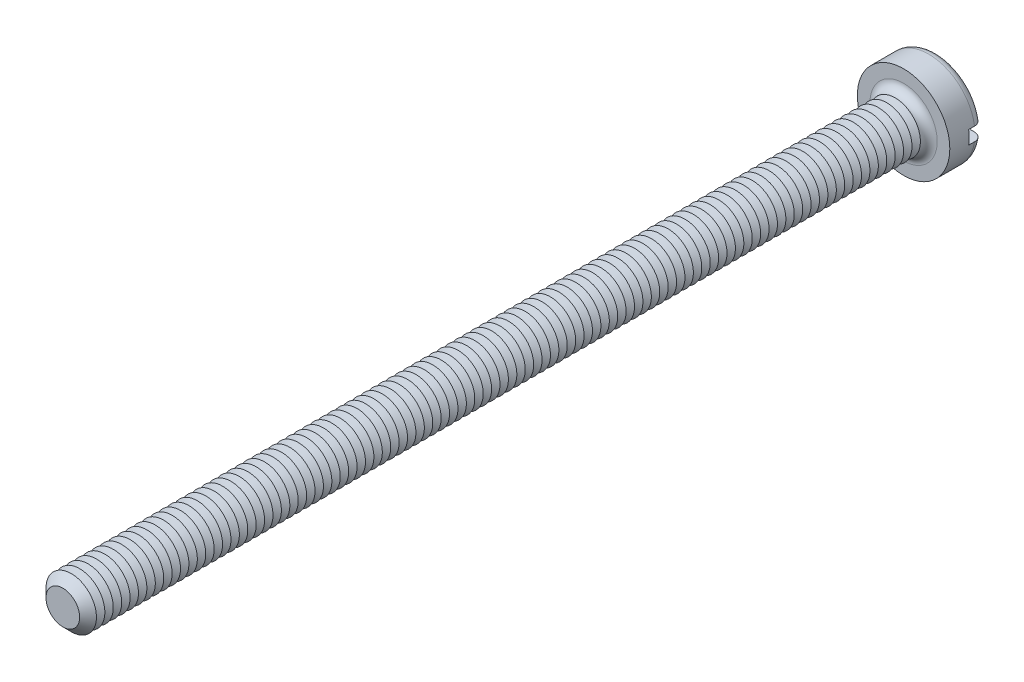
ISO-10303-21;
HEADER;
FILE_DESCRIPTION(('STEP AP214'),'2;1');
FILE_NAME('part.step','',(''),(''),'','','');
FILE_SCHEMA(('AUTOMOTIVE_DESIGN { 1 0 10303 214 1 1 1 1 }'));
ENDSEC;
DATA;
#1=APPLICATION_CONTEXT('core data for automotive mechanical design processes');
#2=APPLICATION_PROTOCOL_DEFINITION('international standard','automotive_design',2000,#1);
#3=PRODUCT_CONTEXT('',#1,'mechanical');
#4=PRODUCT('Part','Part','',(#3));
#5=PRODUCT_RELATED_PRODUCT_CATEGORY('part','',(#4));
#6=PRODUCT_DEFINITION_FORMATION('','',#4);
#7=PRODUCT_DEFINITION_CONTEXT('part definition',#1,'design');
#8=PRODUCT_DEFINITION('design','',#6,#7);
#9=PRODUCT_DEFINITION_SHAPE('','',#8);
#10=(LENGTH_UNIT() NAMED_UNIT(*) SI_UNIT(.MILLI.,.METRE.));
#11=(NAMED_UNIT(*) PLANE_ANGLE_UNIT() SI_UNIT($,.RADIAN.));
#12=(NAMED_UNIT(*) SI_UNIT($,.STERADIAN.) SOLID_ANGLE_UNIT());
#13=UNCERTAINTY_MEASURE_WITH_UNIT(LENGTH_MEASURE(1.E-05),#10,'distance_accuracy_value','');
#14=(GEOMETRIC_REPRESENTATION_CONTEXT(3) GLOBAL_UNCERTAINTY_ASSIGNED_CONTEXT((#13)) GLOBAL_UNIT_ASSIGNED_CONTEXT((#10,
#11,#12)) REPRESENTATION_CONTEXT('',''));
#15=CARTESIAN_POINT('',(0.,0.,0.));
#16=DIRECTION('',(0.,0.,1.));
#17=DIRECTION('',(1.,0.,0.));
#18=AXIS2_PLACEMENT_3D('',#15,#16,#17);
#19=CARTESIAN_POINT('',(0.,0.,-2.));
#20=DIRECTION('',(0.,0.,1.));
#21=DIRECTION('',(1.,0.,0.));
#22=AXIS2_PLACEMENT_3D('',#19,#20,#21);
#23=PLANE('',#22);
#24=CARTESIAN_POINT('',(0.,0.,-2.));
#25=DIRECTION('',(0.,0.,1.));
#26=DIRECTION('',(1.,0.,0.));
#27=AXIS2_PLACEMENT_3D('',#24,#25,#26);
#28=CIRCLE('',#27,2.25);
#29=CARTESIAN_POINT('',(-2.21415898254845,0.4,-2.));
#30=VERTEX_POINT('',#29);
#31=CARTESIAN_POINT('',(2.21415898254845,0.4,-2.));
#32=VERTEX_POINT('',#31);
#33=EDGE_CURVE('E116',#30,#32,#28,.F.);
#34=ORIENTED_EDGE('',*,*,#33,.T.);
#35=DIRECTION('',(1.,0.,0.));
#36=VECTOR('',#35,1.);
#37=CARTESIAN_POINT('',(-2.75,0.400000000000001,-2.));
#38=LINE('',#37,#36);
#39=EDGE_CURVE('E111',#30,#32,#38,.T.);
#40=ORIENTED_EDGE('',*,*,#39,.F.);
#41=EDGE_LOOP('',(#34,#40));
#42=FACE_BOUND('',#41,.T.);
#43=ADVANCED_FACE('F39',(#42),#23,.F.);
#44=CARTESIAN_POINT('',(0.,0.,-1.5));
#45=DIRECTION('',(0.,0.,1.));
#46=DIRECTION('',(1.,0.,0.));
#47=AXIS2_PLACEMENT_3D('',#44,#45,#46);
#48=TOROIDAL_SURFACE('',#47,2.25,0.5);
#49=CARTESIAN_POINT('',(-2.6296588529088,0.400000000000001,-1.78631483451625));
#50=CARTESIAN_POINT('',(-2.61332846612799,0.400000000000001,-1.80942627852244));
#51=CARTESIAN_POINT('',(-2.59501593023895,0.400000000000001,-1.83116426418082));
#52=CARTESIAN_POINT('',(-2.55497423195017,0.400000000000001,-1.87126271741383));
#53=CARTESIAN_POINT('',(-2.53324055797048,0.4,-1.88961865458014));
#54=CARTESIAN_POINT('',(-2.48702796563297,0.4,-1.92241505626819));
#55=CARTESIAN_POINT('',(-2.46255183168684,0.4,-1.93685944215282));
#56=CARTESIAN_POINT('',(-2.41154731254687,0.4,-1.96147315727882));
#57=CARTESIAN_POINT('',(-2.38501943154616,0.4,-1.97164353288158));
#58=CARTESIAN_POINT('',(-2.3303912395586,0.4,-1.98753780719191));
#59=CARTESIAN_POINT('',(-2.30227842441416,0.4,-1.99321871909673));
#60=CARTESIAN_POINT('',(-2.24549884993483,0.4,-1.99984170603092));
#61=CARTESIAN_POINT('',(-2.21683202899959,0.4,-2.00078325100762));
#62=CARTESIAN_POINT('',(-2.15939326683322,0.4,-1.99790249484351));
#63=CARTESIAN_POINT('',(-2.13062419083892,0.4,-1.99402290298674));
#64=CARTESIAN_POINT('',(-2.07413526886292,0.4,-1.98151915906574));
#65=CARTESIAN_POINT('',(-2.04641547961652,0.4,-1.97289475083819));
#66=CARTESIAN_POINT('',(-1.99264697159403,0.4,-1.95107177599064));
#67=CARTESIAN_POINT('',(-1.96660904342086,0.4,-1.93784659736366));
#68=CARTESIAN_POINT('',(-1.91713954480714,0.4,-1.90718730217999));
#69=CARTESIAN_POINT('',(-1.89370795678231,0.4,-1.88975321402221));
#70=CARTESIAN_POINT('',(-1.85029144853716,0.4,-1.85126548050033));
#71=CARTESIAN_POINT('',(-1.83028607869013,0.4,-1.83023492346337));
#72=CARTESIAN_POINT('',(-1.79417432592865,0.4,-1.78505552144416));
#73=CARTESIAN_POINT('',(-1.77806752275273,0.4,-1.76090701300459));
#74=CARTESIAN_POINT('',(-1.75056079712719,0.4,-1.71067721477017));
#75=CARTESIAN_POINT('',(-1.7390748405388,0.4,-1.68464306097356));
#76=CARTESIAN_POINT('',(-1.72075680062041,0.4,-1.63098625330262));
#77=CARTESIAN_POINT('',(-1.71392397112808,0.4,-1.60336385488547));
#78=CARTESIAN_POINT('',(-1.70525661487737,0.4,-1.54801066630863));
#79=CARTESIAN_POINT('',(-1.70330866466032,0.4,-1.52029759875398));
#80=CARTESIAN_POINT('',(-1.70414820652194,0.4,-1.46494458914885));
#81=CARTESIAN_POINT('',(-1.70693532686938,0.4,-1.43730464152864));
#82=CARTESIAN_POINT('',(-1.71709335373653,0.4,-1.38318389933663));
#83=CARTESIAN_POINT('',(-1.72441580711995,0.4,-1.35669397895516));
#84=CARTESIAN_POINT('',(-1.74335830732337,0.4,-1.30529964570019));
#85=CARTESIAN_POINT('',(-1.75497853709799,0.4,-1.2803953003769));
#86=CARTESIAN_POINT('',(-1.78229453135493,0.4,-1.23258298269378));
#87=CARTESIAN_POINT('',(-1.79803217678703,0.4,-1.20969896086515));
#88=CARTESIAN_POINT('',(-1.83304498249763,0.4,-1.16682064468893));
#89=CARTESIAN_POINT('',(-1.85232054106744,0.4,-1.1468266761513));
#90=CARTESIAN_POINT('',(-1.89433695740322,0.4,-1.10980713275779));
#91=CARTESIAN_POINT('',(-1.91714740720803,0.4,-1.09286053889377));
#92=CARTESIAN_POINT('',(-1.96524407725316,0.4,-1.06294809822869));
#93=CARTESIAN_POINT('',(-1.99053056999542,0.4,-1.04998269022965));
#94=CARTESIAN_POINT('',(-2.04340612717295,0.4,-1.02814800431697));
#95=CARTESIAN_POINT('',(-2.07103098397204,0.4,-1.01936532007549));
#96=CARTESIAN_POINT('',(-2.12735840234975,0.4,-1.00652373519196));
#97=CARTESIAN_POINT('',(-2.15606102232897,0.4,-1.00246509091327));
#98=CARTESIAN_POINT('',(-2.21395379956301,0.4,-0.999181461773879));
#99=CARTESIAN_POINT('',(-2.24314598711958,0.4,-0.999992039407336));
#100=CARTESIAN_POINT('',(-2.30097585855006,0.4,-1.00652779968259));
#101=CARTESIAN_POINT('',(-2.32961355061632,0.4,-1.01225290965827));
#102=CARTESIAN_POINT('',(-2.38536238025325,0.4,-1.02843951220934));
#103=CARTESIAN_POINT('',(-2.41248047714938,0.4,-1.03887701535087));
#104=CARTESIAN_POINT('',(-2.46454860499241,0.4,-1.06421009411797));
#105=CARTESIAN_POINT('',(-2.48949875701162,0.4,-1.0791054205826));
#106=CARTESIAN_POINT('',(-2.53620471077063,0.4,-1.11274531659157));
#107=CARTESIAN_POINT('',(-2.55799482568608,0.400000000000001,-1.1314422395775));
#108=CARTESIAN_POINT('',(-2.59807595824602,0.400000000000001,-1.17227176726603));
#109=CARTESIAN_POINT('',(-2.6163672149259,0.400000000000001,-1.19440413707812));
#110=CARTESIAN_POINT('',(-2.64868581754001,0.400000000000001,-1.24117072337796));
#111=CARTESIAN_POINT('',(-2.66276466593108,0.400000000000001,-1.26576935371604));
#112=CARTESIAN_POINT('',(-2.68654482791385,0.400000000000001,-1.31699754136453));
#113=CARTESIAN_POINT('',(-2.69624657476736,0.400000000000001,-1.34362689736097));
#114=CARTESIAN_POINT('',(-2.71090527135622,0.400000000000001,-1.39787706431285));
#115=CARTESIAN_POINT('',(-2.71590826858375,0.400000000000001,-1.4254854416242));
#116=CARTESIAN_POINT('',(-2.72118463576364,0.400000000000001,-1.48115803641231));
#117=CARTESIAN_POINT('',(-2.72145696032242,0.400000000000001,-1.50922235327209));
#118=CARTESIAN_POINT('',(-2.71727180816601,0.400000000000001,-1.56487271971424));
#119=CARTESIAN_POINT('',(-2.71283440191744,0.400000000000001,-1.59246029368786));
#120=CARTESIAN_POINT('',(-2.69939521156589,0.400000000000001,-1.64647499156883));
#121=CARTESIAN_POINT('',(-2.69039909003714,0.400000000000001,-1.67290351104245));
#122=CARTESIAN_POINT('',(-2.67251693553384,0.400000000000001,-1.71382731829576));
#123=CARTESIAN_POINT('',(-2.66497994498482,0.400000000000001,-1.72892686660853));
#124=CARTESIAN_POINT('',(-2.64841616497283,0.400000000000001,-1.75828509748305));
#125=CARTESIAN_POINT('',(-2.63938938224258,0.400000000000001,-1.77254378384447));
#126=CARTESIAN_POINT('',(-2.6296588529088,0.400000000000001,-1.78631483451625));
#127=B_SPLINE_CURVE_WITH_KNOTS('',3,(#49,#50,#51,#52,#53,#54,#55,#56,#57,#58,#59,#60,#61,#62,
#63,#64,#65,#66,#67,#68,#69,#70,#71,#72,#73,#74,#75,#76,#77,#78,#79,#80,#81,#82,#83,#84,#85,#86,
#87,#88,#89,#90,#91,#92,#93,#94,#95,#96,#97,#98,#99,#100,#101,#102,#103,#104,#105,#106,#107,
#108,#109,#110,#111,#112,#113,#114,#115,#116,#117,#118,#119,#120,#121,#122,#123,#124,#125,#126),
.UNSPECIFIED.,.T.,.F.,(4,2,2,2,2,2,2,2,2,2,2,2,2,2,2,2,2,2,2,2,2,2,2,2,2,2,2,2,2,2,2,2,2,2,2,2,
2,2,4),(0.,0.0848338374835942,0.16978050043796,0.254641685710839,0.339482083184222,
0.42512530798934,0.510778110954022,0.597458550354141,0.684143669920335,0.771338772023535,
0.858533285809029,0.945187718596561,1.03183280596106,1.11678035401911,1.20171427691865,
1.28465703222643,1.36759327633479,1.4496584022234,1.53172702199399,1.61466526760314,
1.69761285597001,1.78247103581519,1.86733856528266,1.95389396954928,2.0404540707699,
2.12764713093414,2.21483890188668,2.30159172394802,2.38833969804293,2.4740609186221,
2.55977628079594,2.6443962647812,2.72900787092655,2.81278135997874,2.89657336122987,
2.98000971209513,3.06334267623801,3.113891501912,3.16444009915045),.UNSPECIFIED.);
#128=CARTESIAN_POINT('',(-2.72075357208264,0.400000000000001,-1.50000000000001));
#129=VERTEX_POINT('',#128);
#130=EDGE_CURVE('E963',#129,#30,#127,.T.);
#131=ORIENTED_EDGE('',*,*,#130,.F.);
#132=CARTESIAN_POINT('',(0.,0.,-1.5));
#133=DIRECTION('',(0.,0.,1.));
#134=DIRECTION('',(1.,0.,0.));
#135=AXIS2_PLACEMENT_3D('',#132,#133,#134);
#136=CIRCLE('',#135,2.75);
#137=CARTESIAN_POINT('',(2.7207535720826,0.4,-1.5));
#138=VERTEX_POINT('',#137);
#139=EDGE_CURVE('E125',#138,#129,#136,.T.);
#140=ORIENTED_EDGE('',*,*,#139,.F.);
#141=CARTESIAN_POINT('',(1.7362507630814,0.4,-1.6752840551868));
#142=CARTESIAN_POINT('',(1.74636083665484,0.4,-1.70159961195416));
#143=CARTESIAN_POINT('',(1.7587429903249,0.4,-1.72706707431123));
#144=CARTESIAN_POINT('',(1.78764414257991,0.4,-1.77556609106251));
#145=CARTESIAN_POINT('',(1.80416918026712,0.4,-1.79859401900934));
#146=CARTESIAN_POINT('',(1.84080454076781,0.4,-1.84153587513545));
#147=CARTESIAN_POINT('',(1.86090949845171,0.4,-1.86145438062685));
#148=CARTESIAN_POINT('',(1.9041208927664,0.4,-1.89769607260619));
#149=CARTESIAN_POINT('',(1.92722659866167,0.4,-1.91402013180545));
#150=CARTESIAN_POINT('',(1.97620958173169,0.4,-1.94291288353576));
#151=CARTESIAN_POINT('',(2.00212726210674,0.4,-1.95541309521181));
#152=CARTESIAN_POINT('',(2.05567603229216,0.4,-1.97595143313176));
#153=CARTESIAN_POINT('',(2.08330733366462,0.4,-1.98398900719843));
#154=CARTESIAN_POINT('',(2.13989163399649,0.4,-1.99545904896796));
#155=CARTESIAN_POINT('',(2.16885726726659,0.4,-1.99882930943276));
#156=CARTESIAN_POINT('',(2.22694412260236,0.4,-2.00065872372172));
#157=CARTESIAN_POINT('',(2.25606534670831,0.4,-1.99911781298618));
#158=CARTESIAN_POINT('',(2.31362436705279,0.4,-1.99114818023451));
#159=CARTESIAN_POINT('',(2.34206235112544,0.4,-1.98472081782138));
#160=CARTESIAN_POINT('',(2.39743709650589,0.4,-1.96713601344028));
#161=CARTESIAN_POINT('',(2.42437392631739,0.4,-1.95597878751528));
#162=CARTESIAN_POINT('',(2.47569769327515,0.4,-1.92935960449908));
#163=CARTESIAN_POINT('',(2.50010686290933,0.4,-1.91394052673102));
#164=CARTESIAN_POINT('',(2.54594525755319,0.4,-1.8791725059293));
#165=CARTESIAN_POINT('',(2.56737468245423,0.4,-1.85982382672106));
#166=CARTESIAN_POINT('',(2.60634898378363,0.4,-1.81801641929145));
#167=CARTESIAN_POINT('',(2.6239407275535,0.4,-1.79560138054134));
#168=CARTESIAN_POINT('',(2.65505953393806,0.4,-1.7481077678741));
#169=CARTESIAN_POINT('',(2.66858686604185,0.4,-1.72302937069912));
#170=CARTESIAN_POINT('',(2.69103536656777,0.4,-1.67123055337));
#171=CARTESIAN_POINT('',(2.70000740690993,0.4,-1.64453217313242));
#172=CARTESIAN_POINT('',(2.71330608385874,0.4,-1.59000262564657));
#173=CARTESIAN_POINT('',(2.71763293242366,0.4,-1.5621715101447));
#174=CARTESIAN_POINT('',(2.72149675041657,0.4,-1.50637655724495));
#175=CARTESIAN_POINT('',(2.72106725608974,0.4,-1.47841503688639));
#176=CARTESIAN_POINT('',(2.7155123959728,0.4,-1.42296287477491));
#177=CARTESIAN_POINT('',(2.71038711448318,0.4,-1.39547222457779));
#178=CARTESIAN_POINT('',(2.69560462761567,0.4,-1.34178071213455));
#179=CARTESIAN_POINT('',(2.68595389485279,0.4,-1.31557806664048));
#180=CARTESIAN_POINT('',(2.66240876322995,0.4,-1.26515516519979));
#181=CARTESIAN_POINT('',(2.64851431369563,0.4,-1.24093493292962));
#182=CARTESIAN_POINT('',(2.61681930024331,0.4,-1.19504594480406));
#183=CARTESIAN_POINT('',(2.59900198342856,0.4,-1.17338876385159));
#184=CARTESIAN_POINT('',(2.56001495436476,0.4,-1.13333899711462));
#185=CARTESIAN_POINT('',(2.53884510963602,0.4,-1.11494654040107));
#186=CARTESIAN_POINT('',(2.49354554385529,0.4,-1.08175888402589));
#187=CARTESIAN_POINT('',(2.46938991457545,0.4,-1.06699905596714));
#188=CARTESIAN_POINT('',(2.41896725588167,0.4,-1.04168682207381));
#189=CARTESIAN_POINT('',(2.39270009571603,0.4,-1.03113467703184));
#190=CARTESIAN_POINT('',(2.33844927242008,0.4,-1.01439607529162));
#191=CARTESIAN_POINT('',(2.31044823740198,0.4,-1.00826592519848));
#192=CARTESIAN_POINT('',(2.25381752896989,0.4,-1.00073183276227));
#193=CARTESIAN_POINT('',(2.22518781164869,0.4,-0.999328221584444));
#194=CARTESIAN_POINT('',(2.16774231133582,0.4,-1.00127811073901));
#195=CARTESIAN_POINT('',(2.13892848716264,0.4,-1.00468955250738));
#196=CARTESIAN_POINT('',(2.08227193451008,0.4,-1.01626887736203));
#197=CARTESIAN_POINT('',(2.05442926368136,0.4,-1.02443704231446));
#198=CARTESIAN_POINT('',(2.00032604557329,0.4,-1.04537295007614));
#199=CARTESIAN_POINT('',(1.97407661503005,0.4,-1.05816944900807));
#200=CARTESIAN_POINT('',(1.92411255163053,0.4,-1.08801035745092));
#201=CARTESIAN_POINT('',(1.90039792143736,0.4,-1.10505477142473));
#202=CARTESIAN_POINT('',(1.85633574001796,0.4,-1.14282887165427));
#203=CARTESIAN_POINT('',(1.83597040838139,0.4,-1.16353779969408));
#204=CARTESIAN_POINT('',(1.79908731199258,0.4,-1.20813793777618));
#205=CARTESIAN_POINT('',(1.78256899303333,0.4,-1.23202868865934));
#206=CARTESIAN_POINT('',(1.75420022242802,0.4,-1.28183173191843));
#207=CARTESIAN_POINT('',(1.74226635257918,0.4,-1.30769648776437));
#208=CARTESIAN_POINT('',(1.72302798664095,0.4,-1.36110211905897));
#209=CARTESIAN_POINT('',(1.71572395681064,0.4,-1.38864316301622));
#210=CARTESIAN_POINT('',(1.70611974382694,0.4,-1.44392326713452));
#211=CARTESIAN_POINT('',(1.70370764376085,0.4,-1.47164298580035));
#212=CARTESIAN_POINT('',(1.70363822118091,0.4,-1.52706336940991));
#213=CARTESIAN_POINT('',(1.70597448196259,0.4,-1.55476400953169));
#214=CARTESIAN_POINT('',(1.71335146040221,0.4,-1.59796127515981));
#215=CARTESIAN_POINT('',(1.71686033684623,0.4,-1.61373520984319));
#216=CARTESIAN_POINT('',(1.7254146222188,0.4,-1.64486018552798));
#217=CARTESIAN_POINT('',(1.73045999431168,0.4,-1.66021123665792));
#218=CARTESIAN_POINT('',(1.7362507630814,0.4,-1.6752840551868));
#219=B_SPLINE_CURVE_WITH_KNOTS('',3,(#141,#142,#143,#144,#145,#146,#147,#148,#149,#150,#151,
#152,#153,#154,#155,#156,#157,#158,#159,#160,#161,#162,#163,#164,#165,#166,#167,#168,#169,#170,
#171,#172,#173,#174,#175,#176,#177,#178,#179,#180,#181,#182,#183,#184,#185,#186,#187,#188,#189,
#190,#191,#192,#193,#194,#195,#196,#197,#198,#199,#200,#201,#202,#203,#204,#205,#206,#207,#208,
#209,#210,#211,#212,#213,#214,#215,#216,#217,#218),.UNSPECIFIED.,.T.,.F.,(4,2,2,2,2,2,2,2,2,2,2,
2,2,2,2,2,2,2,2,2,2,2,2,2,2,2,2,2,2,2,2,2,2,2,2,2,2,2,4),(0.,0.0845117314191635,
0.169147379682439,0.253657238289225,0.338146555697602,0.424070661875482,0.510005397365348,
0.597074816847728,0.684145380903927,0.771191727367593,0.858234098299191,0.94443074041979,
1.03062159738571,1.11569223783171,1.20075723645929,1.28485012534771,1.36893917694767,
1.45243570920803,1.53593074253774,1.61930671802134,1.70268368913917,1.7864238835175,
1.87016738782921,1.95469664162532,2.03923113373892,2.12482389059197,2.21042264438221,
2.29706026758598,2.38370302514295,2.47089361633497,2.55808429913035,2.64479602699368,
2.73149525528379,2.81653234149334,2.9015779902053,2.98465497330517,3.06761976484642,
3.11602689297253,3.164432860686),.UNSPECIFIED.);
#220=EDGE_CURVE('E965',#32,#138,#219,.T.);
#221=ORIENTED_EDGE('',*,*,#220,.F.);
#222=ORIENTED_EDGE('',*,*,#33,.F.);
#223=EDGE_LOOP('',(#131,#140,#221,#222));
#224=FACE_BOUND('',#223,.T.);
#225=ADVANCED_FACE('F947',(#224),#48,.T.);
#226=CARTESIAN_POINT('',(0.,0.,-2.));
#227=DIRECTION('',(0.,0.,1.));
#228=DIRECTION('',(1.,0.,0.));
#229=AXIS2_PLACEMENT_3D('',#226,#227,#228);
#230=CYLINDRICAL_SURFACE('',#229,2.75);
#231=DIRECTION('',(0.,0.,1.));
#232=VECTOR('',#231,1.);
#233=CARTESIAN_POINT('',(2.72075357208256,0.4,-2.));
#234=LINE('',#233,#232);
#235=CARTESIAN_POINT('',(2.72075357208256,0.4,-1.15));
#236=VERTEX_POINT('',#235);
#237=EDGE_CURVE('E981',#138,#236,#234,.T.);
#238=ORIENTED_EDGE('',*,*,#237,.F.);
#239=ORIENTED_EDGE('',*,*,#139,.T.);
#240=DIRECTION('',(0.,0.,1.));
#241=VECTOR('',#240,1.);
#242=CARTESIAN_POINT('',(-2.72075357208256,0.4,-2.));
#243=LINE('',#242,#241);
#244=CARTESIAN_POINT('',(-2.72075357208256,0.4,-1.15));
#245=VERTEX_POINT('',#244);
#246=EDGE_CURVE('E63',#245,#129,#243,.F.);
#247=ORIENTED_EDGE('',*,*,#246,.F.);
#248=CARTESIAN_POINT('',(0.,0.,-1.15));
#249=DIRECTION('',(0.,0.,-1.));
#250=DIRECTION('',(-1.,0.,0.));
#251=AXIS2_PLACEMENT_3D('',#248,#249,#250);
#252=CIRCLE('',#251,2.75);
#253=CARTESIAN_POINT('',(-2.72075357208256,-0.4,-1.15));
#254=VERTEX_POINT('',#253);
#255=EDGE_CURVE('E43',#245,#254,#252,.F.);
#256=ORIENTED_EDGE('',*,*,#255,.T.);
#257=DIRECTION('',(0.,0.,1.));
#258=VECTOR('',#257,1.);
#259=CARTESIAN_POINT('',(-2.72075357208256,-0.4,-2.));
#260=LINE('',#259,#258);
#261=CARTESIAN_POINT('',(-2.72075357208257,-0.4,-1.5));
#262=VERTEX_POINT('',#261);
#263=EDGE_CURVE('E978',#262,#254,#260,.T.);
#264=ORIENTED_EDGE('',*,*,#263,.F.);
#265=CARTESIAN_POINT('',(2.72075357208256,-0.4,-1.5));
#266=VERTEX_POINT('',#265);
#267=EDGE_CURVE('E127',#262,#266,#136,.T.);
#268=ORIENTED_EDGE('',*,*,#267,.T.);
#269=DIRECTION('',(0.,0.,1.));
#270=VECTOR('',#269,1.);
#271=CARTESIAN_POINT('',(2.72075357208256,-0.4,-2.));
#272=LINE('',#271,#270);
#273=CARTESIAN_POINT('',(2.72075357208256,-0.4,-1.15));
#274=VERTEX_POINT('',#273);
#275=EDGE_CURVE('E55',#274,#266,#272,.F.);
#276=ORIENTED_EDGE('',*,*,#275,.F.);
#277=EDGE_CURVE('E11',#274,#236,#252,.F.);
#278=ORIENTED_EDGE('',*,*,#277,.T.);
#279=EDGE_LOOP('',(#238,#239,#247,#256,#264,#268,#276,#278));
#280=FACE_BOUND('',#279,.T.);
#281=CARTESIAN_POINT('',(0.,0.,0.));
#282=DIRECTION('',(0.,0.,1.));
#283=DIRECTION('',(1.,0.,0.));
#284=AXIS2_PLACEMENT_3D('',#281,#282,#283);
#285=CIRCLE('',#284,2.75);
#286=CARTESIAN_POINT('',(2.75,0.,0.));
#287=VERTEX_POINT('',#286);
#288=EDGE_CURVE('E984',#287,#287,#285,.T.);
#289=ORIENTED_EDGE('',*,*,#288,.F.);
#290=EDGE_LOOP('',(#289));
#291=FACE_BOUND('',#290,.T.);
#292=ADVANCED_FACE('F943',(#280,#291),#230,.T.);
#293=CARTESIAN_POINT('',(2.21415898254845,-0.4,-2.));
#294=VERTEX_POINT('',#293);
#295=CARTESIAN_POINT('',(-2.21415898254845,-0.4,-2.));
#296=VERTEX_POINT('',#295);
#297=EDGE_CURVE('E109',#294,#296,#28,.F.);
#298=ORIENTED_EDGE('',*,*,#297,.T.);
#299=DIRECTION('',(-1.,0.,0.));
#300=VECTOR('',#299,1.);
#301=CARTESIAN_POINT('',(-2.75,-0.4,-2.));
#302=LINE('',#301,#300);
#303=EDGE_CURVE('E96',#294,#296,#302,.T.);
#304=ORIENTED_EDGE('',*,*,#303,.F.);
#305=EDGE_LOOP('',(#298,#304));
#306=FACE_BOUND('',#305,.T.);
#307=ADVANCED_FACE('F108',(#306),#23,.F.);
#308=CARTESIAN_POINT('',(0.,0.,0.));
#309=DIRECTION('',(0.,0.,1.));
#310=DIRECTION('',(1.,0.,0.));
#311=AXIS2_PLACEMENT_3D('',#308,#309,#310);
#312=PLANE('',#311);
#313=CARTESIAN_POINT('',(0.,0.,0.));
#314=DIRECTION('',(0.,0.,1.));
#315=DIRECTION('',(1.,0.,0.));
#316=AXIS2_PLACEMENT_3D('',#313,#314,#315);
#317=CIRCLE('',#316,2.);
#318=CARTESIAN_POINT('',(2.,0.,0.));
#319=VERTEX_POINT('',#318);
#320=EDGE_CURVE('E115',#319,#319,#317,.F.);
#321=ORIENTED_EDGE('',*,*,#320,.T.);
#322=EDGE_LOOP('',(#321));
#323=FACE_BOUND('',#322,.T.);
#324=ORIENTED_EDGE('',*,*,#288,.T.);
#325=EDGE_LOOP('',(#324));
#326=FACE_BOUND('',#325,.T.);
#327=ADVANCED_FACE('F942',(#323,#326),#312,.T.);
#328=CARTESIAN_POINT('',(-2.6296588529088,-0.4,-1.78631483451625));
#329=CARTESIAN_POINT('',(-2.64575286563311,-0.4,-1.76353353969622));
#330=CARTESIAN_POINT('',(-2.65994473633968,-0.4,-1.73938506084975));
#331=CARTESIAN_POINT('',(-2.68408879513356,-0.4,-1.68903091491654));
#332=CARTESIAN_POINT('',(-2.69403633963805,-0.4,-1.6628230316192));
#333=CARTESIAN_POINT('',(-2.70937899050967,-0.4,-1.60911025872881));
#334=CARTESIAN_POINT('',(-2.71477511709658,-0.4,-1.5816056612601));
#335=CARTESIAN_POINT('',(-2.72085365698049,-0.4,-1.52608718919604));
#336=CARTESIAN_POINT('',(-2.7215371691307,-0.4,-1.49807343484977));
#337=CARTESIAN_POINT('',(-2.71817903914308,-0.4,-1.44242333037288));
#338=CARTESIAN_POINT('',(-2.71415291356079,-0.4,-1.41478604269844));
#339=CARTESIAN_POINT('',(-2.70152104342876,-0.4,-1.36057835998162));
#340=CARTESIAN_POINT('',(-2.69291517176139,-0.4,-1.33400799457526));
#341=CARTESIAN_POINT('',(-2.67137052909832,-0.4,-1.28266198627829));
#342=CARTESIAN_POINT('',(-2.65842829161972,-0.4,-1.25788779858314));
#343=CARTESIAN_POINT('',(-2.62859348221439,-0.4,-1.21084577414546));
#344=CARTESIAN_POINT('',(-2.61170082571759,-0.4,-1.18857799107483));
#345=CARTESIAN_POINT('',(-2.5743351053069,-0.4,-1.1470221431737));
#346=CARTESIAN_POINT('',(-2.55383974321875,-0.4,-1.12775413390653));
#347=CARTESIAN_POINT('',(-2.5099353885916,-0.4,-1.09288845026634));
#348=CARTESIAN_POINT('',(-2.48652625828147,-0.4,-1.07729094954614));
#349=CARTESIAN_POINT('',(-2.43718903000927,-0.4,-1.0500239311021));
#350=CARTESIAN_POINT('',(-2.41123629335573,-0.4,-1.0383990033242));
#351=CARTESIAN_POINT('',(-2.35776417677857,-0.4,-1.01960886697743));
#352=CARTESIAN_POINT('',(-2.33024469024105,-0.4,-1.01244396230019));
#353=CARTESIAN_POINT('',(-2.27404134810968,-0.4,-1.00268156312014));
#354=CARTESIAN_POINT('',(-2.24534705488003,-0.4,-1.00014414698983));
#355=CARTESIAN_POINT('',(-2.18793513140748,-0.4,-0.999867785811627));
#356=CARTESIAN_POINT('',(-2.15921749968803,-0.4,-1.00212917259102));
#357=CARTESIAN_POINT('',(-2.10225052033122,-0.4,-1.01142552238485));
#358=CARTESIAN_POINT('',(-2.07400941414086,-0.4,-1.01851105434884));
#359=CARTESIAN_POINT('',(-2.01911044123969,-0.4,-1.03730994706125));
#360=CARTESIAN_POINT('',(-1.99245264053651,-0.4,-1.04902350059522));
#361=CARTESIAN_POINT('',(-1.94142108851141,-0.4,-1.07679847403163));
#362=CARTESIAN_POINT('',(-1.91705303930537,-0.4,-1.09287038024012));
#363=CARTESIAN_POINT('',(-1.87139758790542,-0.4,-1.12891897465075));
#364=CARTESIAN_POINT('',(-1.85011007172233,-0.4,-1.14889551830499));
#365=CARTESIAN_POINT('',(-1.81149058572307,-0.4,-1.19196940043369));
#366=CARTESIAN_POINT('',(-1.79411779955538,-0.4,-1.21503011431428));
#367=CARTESIAN_POINT('',(-1.76359546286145,-0.4,-1.26379588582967));
#368=CARTESIAN_POINT('',(-1.75044532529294,-0.4,-1.28950057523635));
#369=CARTESIAN_POINT('',(-1.72906221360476,-0.4,-1.3422057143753));
#370=CARTESIAN_POINT('',(-1.72072512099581,-0.4,-1.3691639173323));
#371=CARTESIAN_POINT('',(-1.70880448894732,-0.4,-1.42411084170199));
#372=CARTESIAN_POINT('',(-1.7052202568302,-0.4,-1.45209941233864));
#373=CARTESIAN_POINT('',(-1.70295553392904,-0.4,-1.50768522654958));
#374=CARTESIAN_POINT('',(-1.70417398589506,-0.4,-1.53527840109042));
#375=CARTESIAN_POINT('',(-1.71124536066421,-0.4,-1.58986292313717));
#376=CARTESIAN_POINT('',(-1.71709811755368,-0.4,-1.61685429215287));
#377=CARTESIAN_POINT('',(-1.73321132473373,-0.4,-1.66938107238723));
#378=CARTESIAN_POINT('',(-1.74345625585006,-0.4,-1.69492125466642));
#379=CARTESIAN_POINT('',(-1.76802111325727,-0.4,-1.74395877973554));
#380=CARTESIAN_POINT('',(-1.78234133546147,-0.4,-1.76745597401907));
#381=CARTESIAN_POINT('',(-1.81488631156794,-0.4,-1.81216193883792));
#382=CARTESIAN_POINT('',(-1.83317116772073,-0.4,-1.83332693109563));
#383=CARTESIAN_POINT('',(-1.87296030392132,-0.4,-1.872375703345));
#384=CARTESIAN_POINT('',(-1.89446497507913,-0.4,-1.89025908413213));
#385=CARTESIAN_POINT('',(-1.94063077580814,-0.4,-1.92267732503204));
#386=CARTESIAN_POINT('',(-1.96535444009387,-0.4,-1.93712316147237));
#387=CARTESIAN_POINT('',(-2.01684705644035,-0.4,-1.96173690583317));
#388=CARTESIAN_POINT('',(-2.04361620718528,-0.4,-1.97190439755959));
#389=CARTESIAN_POINT('',(-2.09891021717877,-0.4,-1.9878230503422));
#390=CARTESIAN_POINT('',(-2.12745653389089,-0.4,-1.99349978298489));
#391=CARTESIAN_POINT('',(-2.18509639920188,-0.4,-1.99999556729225));
#392=CARTESIAN_POINT('',(-2.21418994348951,-0.4,-2.00081465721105));
#393=CARTESIAN_POINT('',(-2.27218032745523,-0.4,-1.99755156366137));
#394=CARTESIAN_POINT('',(-2.30107643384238,-0.4,-1.99345627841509));
#395=CARTESIAN_POINT('',(-2.35776697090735,-0.4,-1.98043125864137));
#396=CARTESIAN_POINT('',(-2.38556116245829,-0.4,-1.97150048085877));
#397=CARTESIAN_POINT('',(-2.43901832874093,-0.4,-1.94912081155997));
#398=CARTESIAN_POINT('',(-2.46469578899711,-0.4,-1.93570648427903));
#399=CARTESIAN_POINT('',(-2.51337022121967,-0.4,-1.90471183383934));
#400=CARTESIAN_POINT('',(-2.53637056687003,-0.4,-1.88713684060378));
#401=CARTESIAN_POINT('',(-2.57111030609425,-0.4,-1.85552084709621));
#402=CARTESIAN_POINT('',(-2.58386709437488,-0.4,-1.84257896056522));
#403=CARTESIAN_POINT('',(-2.60790410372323,-0.4,-1.81538935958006));
#404=CARTESIAN_POINT('',(-2.61918433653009,-0.4,-1.80114165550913));
#405=CARTESIAN_POINT('',(-2.6296588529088,-0.4,-1.78631483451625));
#406=B_SPLINE_CURVE_WITH_KNOTS('',3,(#328,#329,#330,#331,#332,#333,#334,#335,#336,#337,#338,
#339,#340,#341,#342,#343,#344,#345,#346,#347,#348,#349,#350,#351,#352,#353,#354,#355,#356,#357,
#358,#359,#360,#361,#362,#363,#364,#365,#366,#367,#368,#369,#370,#371,#372,#373,#374,#375,#376,
#377,#378,#379,#380,#381,#382,#383,#384,#385,#386,#387,#388,#389,#390,#391,#392,#393,#394,#395,
#396,#397,#398,#399,#400,#401,#402,#403,#404,#405),.UNSPECIFIED.,.T.,.F.,(4,2,2,2,2,2,2,2,2,2,2,
2,2,2,2,2,2,2,2,2,2,2,2,2,2,2,2,2,2,2,2,2,2,2,2,2,2,2,4),(0.,0.0836125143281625,
0.167316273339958,0.251001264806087,0.334666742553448,0.418057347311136,0.501450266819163,
0.584910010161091,0.668371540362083,0.752369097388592,0.836370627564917,0.921286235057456,
1.00620762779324,1.09222390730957,1.17824613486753,1.26518425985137,1.35212600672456,
1.43927882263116,1.52642841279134,1.61262232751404,1.69880425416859,1.7830443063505,
1.86727208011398,1.9497371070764,2.03219918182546,2.1143722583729,2.19655130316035,
2.28007615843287,2.36361116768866,2.44911836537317,2.53463387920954,2.62153862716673,
2.70844269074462,2.79557895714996,2.88273403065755,2.96923214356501,3.05562004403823,
3.11003826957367,3.16445606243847),.UNSPECIFIED.);
#407=EDGE_CURVE('E103',#296,#262,#406,.T.);
#408=ORIENTED_EDGE('',*,*,#407,.F.);
#409=ORIENTED_EDGE('',*,*,#297,.F.);
#410=CARTESIAN_POINT('',(1.7362507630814,-0.4,-1.6752840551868));
#411=CARTESIAN_POINT('',(1.72641416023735,-0.4,-1.64967314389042));
#412=CARTESIAN_POINT('',(1.71871480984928,-0.4,-1.62322216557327));
#413=CARTESIAN_POINT('',(1.70786038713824,-0.4,-1.56938399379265));
#414=CARTESIAN_POINT('',(1.70470970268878,-0.4,-1.54199592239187));
#415=CARTESIAN_POINT('',(1.70306971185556,-0.4,-1.48708393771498));
#416=CARTESIAN_POINT('',(1.70457942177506,-0.4,-1.45956005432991));
#417=CARTESIAN_POINT('',(1.71220670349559,-0.4,-1.40516538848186));
#418=CARTESIAN_POINT('',(1.71832341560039,-0.4,-1.3782944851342));
#419=CARTESIAN_POINT('',(1.73494792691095,-0.4,-1.32598312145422));
#420=CARTESIAN_POINT('',(1.74545076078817,-0.4,-1.30054108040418));
#421=CARTESIAN_POINT('',(1.77051013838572,-0.4,-1.25173932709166));
#422=CARTESIAN_POINT('',(1.7850670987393,-0.4,-1.22837982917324));
#423=CARTESIAN_POINT('',(1.81806903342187,-0.4,-1.1839775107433));
#424=CARTESIAN_POINT('',(1.8365752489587,-0.4,-1.16298023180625));
#425=CARTESIAN_POINT('',(1.87677669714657,-0.4,-1.1243010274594));
#426=CARTESIAN_POINT('',(1.89847230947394,-0.4,-1.10661949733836));
#427=CARTESIAN_POINT('',(1.94498854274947,-0.4,-1.07463966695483));
#428=CARTESIAN_POINT('',(1.96987078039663,-0.4,-1.06043095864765));
#429=CARTESIAN_POINT('',(2.02163980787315,-0.4,-1.0363161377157));
#430=CARTESIAN_POINT('',(2.04852678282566,-0.4,-1.02641042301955));
#431=CARTESIAN_POINT('',(2.10400319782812,-0.4,-1.01104128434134));
#432=CARTESIAN_POINT('',(2.13261287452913,-0.4,-1.00565079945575));
#433=CARTESIAN_POINT('',(2.19033179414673,-0.4,-0.999735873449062));
#434=CARTESIAN_POINT('',(2.2194410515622,-0.4,-0.999211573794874));
#435=CARTESIAN_POINT('',(2.27740442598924,-0.4,-1.00306591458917));
#436=CARTESIAN_POINT('',(2.30625777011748,-0.4,-1.00745623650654));
#437=CARTESIAN_POINT('',(2.36280530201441,-0.4,-1.02105937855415));
#438=CARTESIAN_POINT('',(2.39049952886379,-0.4,-1.03027203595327));
#439=CARTESIAN_POINT('',(2.44369359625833,-0.4,-1.05318710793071));
#440=CARTESIAN_POINT('',(2.46920965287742,-0.4,-1.0668518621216));
#441=CARTESIAN_POINT('',(2.51754507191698,-0.4,-1.09832423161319));
#442=CARTESIAN_POINT('',(2.54036461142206,-0.4,-1.11613157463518));
#443=CARTESIAN_POINT('',(2.58234752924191,-0.4,-1.15513986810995));
#444=CARTESIAN_POINT('',(2.601553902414,-0.4,-1.1762945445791));
#445=CARTESIAN_POINT('',(2.63609001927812,-0.4,-1.22156192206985));
#446=CARTESIAN_POINT('',(2.65142002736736,-0.4,-1.24567442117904));
#447=CARTESIAN_POINT('',(2.67757733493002,-0.4,-1.29585881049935));
#448=CARTESIAN_POINT('',(2.68845668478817,-0.4,-1.32190357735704));
#449=CARTESIAN_POINT('',(2.7056478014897,-0.4,-1.375459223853));
#450=CARTESIAN_POINT('',(2.71195980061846,-0.4,-1.40297002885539));
#451=CARTESIAN_POINT('',(2.71979288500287,-0.4,-1.45843707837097));
#452=CARTESIAN_POINT('',(2.72135241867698,-0.4,-1.48638789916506));
#453=CARTESIAN_POINT('',(2.71974298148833,-0.4,-1.54215266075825));
#454=CARTESIAN_POINT('',(2.71657412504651,-0.4,-1.56996660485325));
#455=CARTESIAN_POINT('',(2.70561779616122,-0.4,-1.62459191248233));
#456=CARTESIAN_POINT('',(2.69784258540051,-0.4,-1.65140573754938));
#457=CARTESIAN_POINT('',(2.6779146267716,-0.4,-1.70335337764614));
#458=CARTESIAN_POINT('',(2.66576185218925,-0.4,-1.72848718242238));
#459=CARTESIAN_POINT('',(2.63739107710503,-0.4,-1.77645196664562));
#460=CARTESIAN_POINT('',(2.62116029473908,-0.4,-1.79927538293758));
#461=CARTESIAN_POINT('',(2.58512700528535,-0.4,-1.84190182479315));
#462=CARTESIAN_POINT('',(2.56532438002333,-0.4,-1.86170475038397));
#463=CARTESIAN_POINT('',(2.522535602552,-0.4,-1.89791219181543));
#464=CARTESIAN_POINT('',(2.49952399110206,-0.4,-1.91428661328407));
#465=CARTESIAN_POINT('',(2.45110500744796,-0.4,-1.94299324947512));
#466=CARTESIAN_POINT('',(2.4256974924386,-0.4,-1.95532522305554));
#467=CARTESIAN_POINT('',(2.37288090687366,-0.4,-1.97575769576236));
#468=CARTESIAN_POINT('',(2.34545135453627,-0.4,-1.98380524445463));
#469=CARTESIAN_POINT('',(2.28963821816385,-0.4,-1.99524443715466));
#470=CARTESIAN_POINT('',(2.26125456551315,-0.4,-1.99863574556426));
#471=CARTESIAN_POINT('',(2.20395671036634,-0.4,-2.00070487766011));
#472=CARTESIAN_POINT('',(2.17504033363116,-0.4,-1.99932265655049));
#473=CARTESIAN_POINT('',(2.11784130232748,-0.4,-1.9917648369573));
#474=CARTESIAN_POINT('',(2.08955866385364,-0.4,-1.98558911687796));
#475=CARTESIAN_POINT('',(2.03419451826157,-0.4,-1.96854979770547));
#476=CARTESIAN_POINT('',(2.00712437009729,-0.4,-1.95764925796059));
#477=CARTESIAN_POINT('',(1.95519572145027,-0.4,-1.93144413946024));
#478=CARTESIAN_POINT('',(1.93033780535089,-0.4,-1.91613840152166));
#479=CARTESIAN_POINT('',(1.88362525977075,-0.4,-1.88157419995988));
#480=CARTESIAN_POINT('',(1.86176428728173,-0.4,-1.86232430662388));
#481=CARTESIAN_POINT('',(1.82167218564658,-0.4,-1.82038600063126));
#482=CARTESIAN_POINT('',(1.803436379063,-0.4,-1.7977020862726));
#483=CARTESIAN_POINT('',(1.77700088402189,-0.4,-1.7582526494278));
#484=CARTESIAN_POINT('',(1.7675549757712,-0.4,-1.74230781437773));
#485=CARTESIAN_POINT('',(1.75049861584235,-0.4,-1.70946415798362));
#486=CARTESIAN_POINT('',(1.7428881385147,-0.4,-1.69256534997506));
#487=CARTESIAN_POINT('',(1.7362507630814,-0.4,-1.6752840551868));
#488=B_SPLINE_CURVE_WITH_KNOTS('',3,(#410,#411,#412,#413,#414,#415,#416,#417,#418,#419,#420,
#421,#422,#423,#424,#425,#426,#427,#428,#429,#430,#431,#432,#433,#434,#435,#436,#437,#438,#439,
#440,#441,#442,#443,#444,#445,#446,#447,#448,#449,#450,#451,#452,#453,#454,#455,#456,#457,#458,
#459,#460,#461,#462,#463,#464,#465,#466,#467,#468,#469,#470,#471,#472,#473,#474,#475,#476,#477,
#478,#479,#480,#481,#482,#483,#484,#485,#486,#487),.UNSPECIFIED.,.T.,.F.,(4,2,2,2,2,2,2,2,2,2,2,
2,2,2,2,2,2,2,2,2,2,2,2,2,2,2,2,2,2,2,2,2,2,2,2,2,2,2,4),(0.,0.0822382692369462,
0.164555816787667,0.246855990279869,0.329140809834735,0.411332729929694,0.493533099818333,
0.577115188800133,0.660707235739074,0.746270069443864,0.831840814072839,0.918768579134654,
1.00569887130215,1.09283622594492,1.17997064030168,1.26638632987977,1.35279634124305,
1.43810213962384,1.52340211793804,1.60767384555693,1.69194128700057,1.77552515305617,
1.85910699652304,1.94246734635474,2.02582820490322,2.10945367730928,2.19308191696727,
2.2774160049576,2.36175512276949,2.4471137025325,2.53247843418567,2.61892083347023,
2.70536542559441,2.79249842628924,2.87965437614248,2.96662291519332,3.05347850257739,
3.10897061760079,3.16446195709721),.UNSPECIFIED.);
#489=EDGE_CURVE('E92',#266,#294,#488,.T.);
#490=ORIENTED_EDGE('',*,*,#489,.F.);
#491=ORIENTED_EDGE('',*,*,#267,.F.);
#492=EDGE_LOOP('',(#408,#409,#490,#491));
#493=FACE_BOUND('',#492,.T.);
#494=ADVANCED_FACE('F113',(#493),#48,.T.);
#495=CARTESIAN_POINT('',(0.,0.,0.5));
#496=DIRECTION('',(0.,0.,1.));
#497=DIRECTION('',(1.,0.,0.));
#498=AXIS2_PLACEMENT_3D('',#495,#496,#497);
#499=TOROIDAL_SURFACE('',#498,2.,0.5);
#500=ORIENTED_EDGE('',*,*,#320,.F.);
#501=EDGE_LOOP('',(#500));
#502=FACE_BOUND('',#501,.T.);
#503=CARTESIAN_POINT('',(0.,0.,0.500000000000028));
#504=DIRECTION('',(0.,0.,-1.));
#505=DIRECTION('',(-1.,0.,0.));
#506=AXIS2_PLACEMENT_3D('',#503,#504,#505);
#507=CIRCLE('',#506,1.5);
#508=CARTESIAN_POINT('',(-1.5,0.,0.500000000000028));
#509=VERTEX_POINT('',#508);
#510=EDGE_CURVE('E989',#509,#509,#507,.T.);
#511=ORIENTED_EDGE('',*,*,#510,.T.);
#512=EDGE_LOOP('',(#511));
#513=FACE_BOUND('',#512,.T.);
#514=ADVANCED_FACE('F935',(#502,#513),#499,.F.);
#515=CARTESIAN_POINT('',(0.,0.,0.750000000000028));
#516=DIRECTION('',(0.,0.,-1.));
#517=DIRECTION('',(-1.,0.,0.));
#518=AXIS2_PLACEMENT_3D('',#515,#516,#517);
#519=CONICAL_SURFACE('',#518,1.06698729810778,1.0471975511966);
#520=ORIENTED_EDGE('',*,*,#510,.F.);
#521=EDGE_LOOP('',(#520));
#522=FACE_BOUND('',#521,.T.);
#523=CARTESIAN_POINT('',(0.,0.,0.750000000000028));
#524=DIRECTION('',(0.,0.,-1.));
#525=DIRECTION('',(-1.,0.,0.));
#526=AXIS2_PLACEMENT_3D('',#523,#524,#525);
#527=CIRCLE('',#526,1.06698729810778);
#528=CARTESIAN_POINT('',(-1.06698729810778,0.,0.750000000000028));
#529=VERTEX_POINT('',#528);
#530=EDGE_CURVE('E995',#529,#529,#527,.T.);
#531=ORIENTED_EDGE('',*,*,#530,.T.);
#532=EDGE_LOOP('',(#531));
#533=FACE_BOUND('',#532,.T.);
#534=ADVANCED_FACE('F931',(#522,#533),#519,.T.);
#535=CARTESIAN_POINT('',(0.,0.,1.00000000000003));
#536=DIRECTION('',(0.,0.,1.));
#537=DIRECTION('',(1.,0.,0.));
#538=AXIS2_PLACEMENT_3D('',#535,#536,#537);
#539=CONICAL_SURFACE('',#538,1.5,1.0471975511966);
#540=ORIENTED_EDGE('',*,*,#530,.F.);
#541=EDGE_LOOP('',(#540));
#542=FACE_BOUND('',#541,.T.);
#543=CARTESIAN_POINT('',(0.,0.,1.00000000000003));
#544=DIRECTION('',(0.,0.,-1.));
#545=DIRECTION('',(-1.,0.,0.));
#546=AXIS2_PLACEMENT_3D('',#543,#544,#545);
#547=CIRCLE('',#546,1.5);
#548=CARTESIAN_POINT('',(-1.5,0.,1.00000000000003));
#549=VERTEX_POINT('',#548);
#550=EDGE_CURVE('E1001',#549,#549,#547,.T.);
#551=ORIENTED_EDGE('',*,*,#550,.T.);
#552=EDGE_LOOP('',(#551));
#553=FACE_BOUND('',#552,.T.);
#554=ADVANCED_FACE('F927',(#542,#553),#539,.T.);
#555=CARTESIAN_POINT('',(0.,0.,1.25000000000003));
#556=DIRECTION('',(0.,0.,-1.));
#557=DIRECTION('',(-1.,0.,0.));
#558=AXIS2_PLACEMENT_3D('',#555,#556,#557);
#559=CONICAL_SURFACE('',#558,1.06698729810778,1.0471975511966);
#560=ORIENTED_EDGE('',*,*,#550,.F.);
#561=EDGE_LOOP('',(#560));
#562=FACE_BOUND('',#561,.T.);
#563=CARTESIAN_POINT('',(0.,0.,1.25000000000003));
#564=DIRECTION('',(0.,0.,-1.));
#565=DIRECTION('',(-1.,0.,0.));
#566=AXIS2_PLACEMENT_3D('',#563,#564,#565);
#567=CIRCLE('',#566,1.06698729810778);
#568=CARTESIAN_POINT('',(-1.06698729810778,0.,1.25000000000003));
#569=VERTEX_POINT('',#568);
#570=EDGE_CURVE('E1005',#569,#569,#567,.T.);
#571=ORIENTED_EDGE('',*,*,#570,.T.);
#572=EDGE_LOOP('',(#571));
#573=FACE_BOUND('',#572,.T.);
#574=ADVANCED_FACE('F923',(#562,#573),#559,.T.);
#575=CARTESIAN_POINT('',(0.,0.,1.50000000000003));
#576=DIRECTION('',(0.,0.,1.));
#577=DIRECTION('',(1.,0.,0.));
#578=AXIS2_PLACEMENT_3D('',#575,#576,#577);
#579=CONICAL_SURFACE('',#578,1.5,1.0471975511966);
#580=ORIENTED_EDGE('',*,*,#570,.F.);
#581=EDGE_LOOP('',(#580));
#582=FACE_BOUND('',#581,.T.);
#583=CARTESIAN_POINT('',(0.,0.,1.50000000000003));
#584=DIRECTION('',(0.,0.,-1.));
#585=DIRECTION('',(-1.,0.,0.));
#586=AXIS2_PLACEMENT_3D('',#583,#584,#585);
#587=CIRCLE('',#586,1.5);
#588=CARTESIAN_POINT('',(-1.5,0.,1.50000000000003));
#589=VERTEX_POINT('',#588);
#590=EDGE_CURVE('E1009',#589,#589,#587,.T.);
#591=ORIENTED_EDGE('',*,*,#590,.T.);
#592=EDGE_LOOP('',(#591));
#593=FACE_BOUND('',#592,.T.);
#594=ADVANCED_FACE('F919',(#582,#593),#579,.T.);
#595=CARTESIAN_POINT('',(0.,0.,1.75000000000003));
#596=DIRECTION('',(0.,0.,-1.));
#597=DIRECTION('',(-1.,0.,0.));
#598=AXIS2_PLACEMENT_3D('',#595,#596,#597);
#599=CONICAL_SURFACE('',#598,1.06698729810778,1.0471975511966);
#600=ORIENTED_EDGE('',*,*,#590,.F.);
#601=EDGE_LOOP('',(#600));
#602=FACE_BOUND('',#601,.T.);
#603=CARTESIAN_POINT('',(0.,0.,1.75000000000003));
#604=DIRECTION('',(0.,0.,-1.));
#605=DIRECTION('',(-1.,0.,0.));
#606=AXIS2_PLACEMENT_3D('',#603,#604,#605);
#607=CIRCLE('',#606,1.06698729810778);
#608=CARTESIAN_POINT('',(-1.06698729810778,0.,1.75000000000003));
#609=VERTEX_POINT('',#608);
#610=EDGE_CURVE('E1013',#609,#609,#607,.T.);
#611=ORIENTED_EDGE('',*,*,#610,.T.);
#612=EDGE_LOOP('',(#611));
#613=FACE_BOUND('',#612,.T.);
#614=ADVANCED_FACE('F915',(#602,#613),#599,.T.);
#615=CARTESIAN_POINT('',(0.,0.,2.00000000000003));
#616=DIRECTION('',(0.,0.,1.));
#617=DIRECTION('',(1.,0.,0.));
#618=AXIS2_PLACEMENT_3D('',#615,#616,#617);
#619=CONICAL_SURFACE('',#618,1.5,1.0471975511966);
#620=ORIENTED_EDGE('',*,*,#610,.F.);
#621=EDGE_LOOP('',(#620));
#622=FACE_BOUND('',#621,.T.);
#623=CARTESIAN_POINT('',(0.,0.,2.00000000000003));
#624=DIRECTION('',(0.,0.,-1.));
#625=DIRECTION('',(-1.,0.,0.));
#626=AXIS2_PLACEMENT_3D('',#623,#624,#625);
#627=CIRCLE('',#626,1.5);
#628=CARTESIAN_POINT('',(-1.5,0.,2.00000000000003));
#629=VERTEX_POINT('',#628);
#630=EDGE_CURVE('E1016',#629,#629,#627,.T.);
#631=ORIENTED_EDGE('',*,*,#630,.T.);
#632=EDGE_LOOP('',(#631));
#633=FACE_BOUND('',#632,.T.);
#634=ADVANCED_FACE('F911',(#622,#633),#619,.T.);
#635=CARTESIAN_POINT('',(0.,0.,2.25000000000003));
#636=DIRECTION('',(0.,0.,-1.));
#637=DIRECTION('',(-1.,0.,0.));
#638=AXIS2_PLACEMENT_3D('',#635,#636,#637);
#639=CONICAL_SURFACE('',#638,1.06698729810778,1.0471975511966);
#640=ORIENTED_EDGE('',*,*,#630,.F.);
#641=EDGE_LOOP('',(#640));
#642=FACE_BOUND('',#641,.T.);
#643=CARTESIAN_POINT('',(0.,0.,2.25000000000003));
#644=DIRECTION('',(0.,0.,-1.));
#645=DIRECTION('',(-1.,0.,0.));
#646=AXIS2_PLACEMENT_3D('',#643,#644,#645);
#647=CIRCLE('',#646,1.06698729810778);
#648=CARTESIAN_POINT('',(-1.06698729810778,0.,2.25000000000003));
#649=VERTEX_POINT('',#648);
#650=EDGE_CURVE('E1020',#649,#649,#647,.T.);
#651=ORIENTED_EDGE('',*,*,#650,.T.);
#652=EDGE_LOOP('',(#651));
#653=FACE_BOUND('',#652,.T.);
#654=ADVANCED_FACE('F907',(#642,#653),#639,.T.);
#655=CARTESIAN_POINT('',(0.,0.,2.50000000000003));
#656=DIRECTION('',(0.,0.,1.));
#657=DIRECTION('',(1.,0.,0.));
#658=AXIS2_PLACEMENT_3D('',#655,#656,#657);
#659=CONICAL_SURFACE('',#658,1.5,1.0471975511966);
#660=ORIENTED_EDGE('',*,*,#650,.F.);
#661=EDGE_LOOP('',(#660));
#662=FACE_BOUND('',#661,.T.);
#663=CARTESIAN_POINT('',(0.,0.,2.50000000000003));
#664=DIRECTION('',(0.,0.,-1.));
#665=DIRECTION('',(-1.,0.,0.));
#666=AXIS2_PLACEMENT_3D('',#663,#664,#665);
#667=CIRCLE('',#666,1.5);
#668=CARTESIAN_POINT('',(-1.5,0.,2.50000000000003));
#669=VERTEX_POINT('',#668);
#670=EDGE_CURVE('E1024',#669,#669,#667,.T.);
#671=ORIENTED_EDGE('',*,*,#670,.T.);
#672=EDGE_LOOP('',(#671));
#673=FACE_BOUND('',#672,.T.);
#674=ADVANCED_FACE('F903',(#662,#673),#659,.T.);
#675=CARTESIAN_POINT('',(0.,0.,2.75000000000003));
#676=DIRECTION('',(0.,0.,-1.));
#677=DIRECTION('',(-1.,0.,0.));
#678=AXIS2_PLACEMENT_3D('',#675,#676,#677);
#679=CONICAL_SURFACE('',#678,1.06698729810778,1.0471975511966);
#680=ORIENTED_EDGE('',*,*,#670,.F.);
#681=EDGE_LOOP('',(#680));
#682=FACE_BOUND('',#681,.T.);
#683=CARTESIAN_POINT('',(0.,0.,2.75000000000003));
#684=DIRECTION('',(0.,0.,-1.));
#685=DIRECTION('',(-1.,0.,0.));
#686=AXIS2_PLACEMENT_3D('',#683,#684,#685);
#687=CIRCLE('',#686,1.06698729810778);
#688=CARTESIAN_POINT('',(-1.06698729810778,0.,2.75000000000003));
#689=VERTEX_POINT('',#688);
#690=EDGE_CURVE('E1028',#689,#689,#687,.T.);
#691=ORIENTED_EDGE('',*,*,#690,.T.);
#692=EDGE_LOOP('',(#691));
#693=FACE_BOUND('',#692,.T.);
#694=ADVANCED_FACE('F899',(#682,#693),#679,.T.);
#695=CARTESIAN_POINT('',(0.,0.,3.00000000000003));
#696=DIRECTION('',(0.,0.,1.));
#697=DIRECTION('',(1.,0.,0.));
#698=AXIS2_PLACEMENT_3D('',#695,#696,#697);
#699=CONICAL_SURFACE('',#698,1.5,1.0471975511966);
#700=ORIENTED_EDGE('',*,*,#690,.F.);
#701=EDGE_LOOP('',(#700));
#702=FACE_BOUND('',#701,.T.);
#703=CARTESIAN_POINT('',(0.,0.,3.00000000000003));
#704=DIRECTION('',(0.,0.,-1.));
#705=DIRECTION('',(-1.,0.,0.));
#706=AXIS2_PLACEMENT_3D('',#703,#704,#705);
#707=CIRCLE('',#706,1.5);
#708=CARTESIAN_POINT('',(-1.5,0.,3.00000000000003));
#709=VERTEX_POINT('',#708);
#710=EDGE_CURVE('E1032',#709,#709,#707,.T.);
#711=ORIENTED_EDGE('',*,*,#710,.T.);
#712=EDGE_LOOP('',(#711));
#713=FACE_BOUND('',#712,.T.);
#714=ADVANCED_FACE('F895',(#702,#713),#699,.T.);
#715=CARTESIAN_POINT('',(0.,0.,3.25000000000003));
#716=DIRECTION('',(0.,0.,-1.));
#717=DIRECTION('',(-1.,0.,0.));
#718=AXIS2_PLACEMENT_3D('',#715,#716,#717);
#719=CONICAL_SURFACE('',#718,1.06698729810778,1.0471975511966);
#720=ORIENTED_EDGE('',*,*,#710,.F.);
#721=EDGE_LOOP('',(#720));
#722=FACE_BOUND('',#721,.T.);
#723=CARTESIAN_POINT('',(0.,0.,3.25000000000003));
#724=DIRECTION('',(0.,0.,-1.));
#725=DIRECTION('',(-1.,0.,0.));
#726=AXIS2_PLACEMENT_3D('',#723,#724,#725);
#727=CIRCLE('',#726,1.06698729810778);
#728=CARTESIAN_POINT('',(-1.06698729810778,0.,3.25000000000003));
#729=VERTEX_POINT('',#728);
#730=EDGE_CURVE('E1036',#729,#729,#727,.T.);
#731=ORIENTED_EDGE('',*,*,#730,.T.);
#732=EDGE_LOOP('',(#731));
#733=FACE_BOUND('',#732,.T.);
#734=ADVANCED_FACE('F891',(#722,#733),#719,.T.);
#735=CARTESIAN_POINT('',(0.,0.,3.50000000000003));
#736=DIRECTION('',(0.,0.,1.));
#737=DIRECTION('',(1.,0.,0.));
#738=AXIS2_PLACEMENT_3D('',#735,#736,#737);
#739=CONICAL_SURFACE('',#738,1.5,1.0471975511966);
#740=ORIENTED_EDGE('',*,*,#730,.F.);
#741=EDGE_LOOP('',(#740));
#742=FACE_BOUND('',#741,.T.);
#743=CARTESIAN_POINT('',(0.,0.,3.50000000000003));
#744=DIRECTION('',(0.,0.,-1.));
#745=DIRECTION('',(-1.,0.,0.));
#746=AXIS2_PLACEMENT_3D('',#743,#744,#745);
#747=CIRCLE('',#746,1.5);
#748=CARTESIAN_POINT('',(-1.5,0.,3.50000000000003));
#749=VERTEX_POINT('',#748);
#750=EDGE_CURVE('E1040',#749,#749,#747,.T.);
#751=ORIENTED_EDGE('',*,*,#750,.T.);
#752=EDGE_LOOP('',(#751));
#753=FACE_BOUND('',#752,.T.);
#754=ADVANCED_FACE('F887',(#742,#753),#739,.T.);
#755=CARTESIAN_POINT('',(0.,0.,3.75000000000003));
#756=DIRECTION('',(0.,0.,-1.));
#757=DIRECTION('',(-1.,0.,0.));
#758=AXIS2_PLACEMENT_3D('',#755,#756,#757);
#759=CONICAL_SURFACE('',#758,1.06698729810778,1.0471975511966);
#760=ORIENTED_EDGE('',*,*,#750,.F.);
#761=EDGE_LOOP('',(#760));
#762=FACE_BOUND('',#761,.T.);
#763=CARTESIAN_POINT('',(0.,0.,3.75000000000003));
#764=DIRECTION('',(0.,0.,-1.));
#765=DIRECTION('',(-1.,0.,0.));
#766=AXIS2_PLACEMENT_3D('',#763,#764,#765);
#767=CIRCLE('',#766,1.06698729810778);
#768=CARTESIAN_POINT('',(-1.06698729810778,0.,3.75000000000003));
#769=VERTEX_POINT('',#768);
#770=EDGE_CURVE('E1044',#769,#769,#767,.T.);
#771=ORIENTED_EDGE('',*,*,#770,.T.);
#772=EDGE_LOOP('',(#771));
#773=FACE_BOUND('',#772,.T.);
#774=ADVANCED_FACE('F883',(#762,#773),#759,.T.);
#775=CARTESIAN_POINT('',(0.,0.,4.00000000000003));
#776=DIRECTION('',(0.,0.,1.));
#777=DIRECTION('',(1.,0.,0.));
#778=AXIS2_PLACEMENT_3D('',#775,#776,#777);
#779=CONICAL_SURFACE('',#778,1.5,1.0471975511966);
#780=ORIENTED_EDGE('',*,*,#770,.F.);
#781=EDGE_LOOP('',(#780));
#782=FACE_BOUND('',#781,.T.);
#783=CARTESIAN_POINT('',(0.,0.,4.00000000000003));
#784=DIRECTION('',(0.,0.,-1.));
#785=DIRECTION('',(-1.,0.,0.));
#786=AXIS2_PLACEMENT_3D('',#783,#784,#785);
#787=CIRCLE('',#786,1.5);
#788=CARTESIAN_POINT('',(-1.5,0.,4.00000000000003));
#789=VERTEX_POINT('',#788);
#790=EDGE_CURVE('E1048',#789,#789,#787,.T.);
#791=ORIENTED_EDGE('',*,*,#790,.T.);
#792=EDGE_LOOP('',(#791));
#793=FACE_BOUND('',#792,.T.);
#794=ADVANCED_FACE('F879',(#782,#793),#779,.T.);
#795=CARTESIAN_POINT('',(0.,0.,4.25000000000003));
#796=DIRECTION('',(0.,0.,-1.));
#797=DIRECTION('',(-1.,0.,0.));
#798=AXIS2_PLACEMENT_3D('',#795,#796,#797);
#799=CONICAL_SURFACE('',#798,1.06698729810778,1.0471975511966);
#800=ORIENTED_EDGE('',*,*,#790,.F.);
#801=EDGE_LOOP('',(#800));
#802=FACE_BOUND('',#801,.T.);
#803=CARTESIAN_POINT('',(0.,0.,4.25000000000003));
#804=DIRECTION('',(0.,0.,-1.));
#805=DIRECTION('',(-1.,0.,0.));
#806=AXIS2_PLACEMENT_3D('',#803,#804,#805);
#807=CIRCLE('',#806,1.06698729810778);
#808=CARTESIAN_POINT('',(-1.06698729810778,0.,4.25000000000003));
#809=VERTEX_POINT('',#808);
#810=EDGE_CURVE('E1052',#809,#809,#807,.T.);
#811=ORIENTED_EDGE('',*,*,#810,.T.);
#812=EDGE_LOOP('',(#811));
#813=FACE_BOUND('',#812,.T.);
#814=ADVANCED_FACE('F875',(#802,#813),#799,.T.);
#815=CARTESIAN_POINT('',(0.,0.,4.50000000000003));
#816=DIRECTION('',(0.,0.,1.));
#817=DIRECTION('',(1.,0.,0.));
#818=AXIS2_PLACEMENT_3D('',#815,#816,#817);
#819=CONICAL_SURFACE('',#818,1.5,1.0471975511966);
#820=ORIENTED_EDGE('',*,*,#810,.F.);
#821=EDGE_LOOP('',(#820));
#822=FACE_BOUND('',#821,.T.);
#823=CARTESIAN_POINT('',(0.,0.,4.50000000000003));
#824=DIRECTION('',(0.,0.,-1.));
#825=DIRECTION('',(-1.,0.,0.));
#826=AXIS2_PLACEMENT_3D('',#823,#824,#825);
#827=CIRCLE('',#826,1.5);
#828=CARTESIAN_POINT('',(-1.5,0.,4.50000000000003));
#829=VERTEX_POINT('',#828);
#830=EDGE_CURVE('E1056',#829,#829,#827,.T.);
#831=ORIENTED_EDGE('',*,*,#830,.T.);
#832=EDGE_LOOP('',(#831));
#833=FACE_BOUND('',#832,.T.);
#834=ADVANCED_FACE('F871',(#822,#833),#819,.T.);
#835=CARTESIAN_POINT('',(0.,0.,4.75000000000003));
#836=DIRECTION('',(0.,0.,-1.));
#837=DIRECTION('',(-1.,0.,0.));
#838=AXIS2_PLACEMENT_3D('',#835,#836,#837);
#839=CONICAL_SURFACE('',#838,1.06698729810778,1.0471975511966);
#840=ORIENTED_EDGE('',*,*,#830,.F.);
#841=EDGE_LOOP('',(#840));
#842=FACE_BOUND('',#841,.T.);
#843=CARTESIAN_POINT('',(0.,0.,4.75000000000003));
#844=DIRECTION('',(0.,0.,-1.));
#845=DIRECTION('',(-1.,0.,0.));
#846=AXIS2_PLACEMENT_3D('',#843,#844,#845);
#847=CIRCLE('',#846,1.06698729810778);
#848=CARTESIAN_POINT('',(-1.06698729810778,0.,4.75000000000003));
#849=VERTEX_POINT('',#848);
#850=EDGE_CURVE('E1060',#849,#849,#847,.T.);
#851=ORIENTED_EDGE('',*,*,#850,.T.);
#852=EDGE_LOOP('',(#851));
#853=FACE_BOUND('',#852,.T.);
#854=ADVANCED_FACE('F867',(#842,#853),#839,.T.);
#855=CARTESIAN_POINT('',(0.,0.,5.00000000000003));
#856=DIRECTION('',(0.,0.,1.));
#857=DIRECTION('',(1.,0.,0.));
#858=AXIS2_PLACEMENT_3D('',#855,#856,#857);
#859=CONICAL_SURFACE('',#858,1.5,1.0471975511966);
#860=ORIENTED_EDGE('',*,*,#850,.F.);
#861=EDGE_LOOP('',(#860));
#862=FACE_BOUND('',#861,.T.);
#863=CARTESIAN_POINT('',(0.,0.,5.00000000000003));
#864=DIRECTION('',(0.,0.,-1.));
#865=DIRECTION('',(-1.,0.,0.));
#866=AXIS2_PLACEMENT_3D('',#863,#864,#865);
#867=CIRCLE('',#866,1.5);
#868=CARTESIAN_POINT('',(-1.5,0.,5.00000000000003));
#869=VERTEX_POINT('',#868);
#870=EDGE_CURVE('E1064',#869,#869,#867,.T.);
#871=ORIENTED_EDGE('',*,*,#870,.T.);
#872=EDGE_LOOP('',(#871));
#873=FACE_BOUND('',#872,.T.);
#874=ADVANCED_FACE('F863',(#862,#873),#859,.T.);
#875=CARTESIAN_POINT('',(0.,0.,5.25000000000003));
#876=DIRECTION('',(0.,0.,-1.));
#877=DIRECTION('',(-1.,0.,0.));
#878=AXIS2_PLACEMENT_3D('',#875,#876,#877);
#879=CONICAL_SURFACE('',#878,1.06698729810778,1.0471975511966);
#880=ORIENTED_EDGE('',*,*,#870,.F.);
#881=EDGE_LOOP('',(#880));
#882=FACE_BOUND('',#881,.T.);
#883=CARTESIAN_POINT('',(0.,0.,5.25000000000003));
#884=DIRECTION('',(0.,0.,-1.));
#885=DIRECTION('',(-1.,0.,0.));
#886=AXIS2_PLACEMENT_3D('',#883,#884,#885);
#887=CIRCLE('',#886,1.06698729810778);
#888=CARTESIAN_POINT('',(-1.06698729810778,0.,5.25000000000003));
#889=VERTEX_POINT('',#888);
#890=EDGE_CURVE('E1067',#889,#889,#887,.T.);
#891=ORIENTED_EDGE('',*,*,#890,.T.);
#892=EDGE_LOOP('',(#891));
#893=FACE_BOUND('',#892,.T.);
#894=ADVANCED_FACE('F859',(#882,#893),#879,.T.);
#895=CARTESIAN_POINT('',(0.,0.,5.50000000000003));
#896=DIRECTION('',(0.,0.,1.));
#897=DIRECTION('',(1.,0.,0.));
#898=AXIS2_PLACEMENT_3D('',#895,#896,#897);
#899=CONICAL_SURFACE('',#898,1.5,1.0471975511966);
#900=ORIENTED_EDGE('',*,*,#890,.F.);
#901=EDGE_LOOP('',(#900));
#902=FACE_BOUND('',#901,.T.);
#903=CARTESIAN_POINT('',(0.,0.,5.50000000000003));
#904=DIRECTION('',(0.,0.,-1.));
#905=DIRECTION('',(-1.,0.,0.));
#906=AXIS2_PLACEMENT_3D('',#903,#904,#905);
#907=CIRCLE('',#906,1.5);
#908=CARTESIAN_POINT('',(-1.5,0.,5.50000000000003));
#909=VERTEX_POINT('',#908);
#910=EDGE_CURVE('E1071',#909,#909,#907,.T.);
#911=ORIENTED_EDGE('',*,*,#910,.T.);
#912=EDGE_LOOP('',(#911));
#913=FACE_BOUND('',#912,.T.);
#914=ADVANCED_FACE('F855',(#902,#913),#899,.T.);
#915=CARTESIAN_POINT('',(0.,0.,5.75000000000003));
#916=DIRECTION('',(0.,0.,-1.));
#917=DIRECTION('',(-1.,0.,0.));
#918=AXIS2_PLACEMENT_3D('',#915,#916,#917);
#919=CONICAL_SURFACE('',#918,1.06698729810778,1.0471975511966);
#920=ORIENTED_EDGE('',*,*,#910,.F.);
#921=EDGE_LOOP('',(#920));
#922=FACE_BOUND('',#921,.T.);
#923=CARTESIAN_POINT('',(0.,0.,5.75000000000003));
#924=DIRECTION('',(0.,0.,-1.));
#925=DIRECTION('',(-1.,0.,0.));
#926=AXIS2_PLACEMENT_3D('',#923,#924,#925);
#927=CIRCLE('',#926,1.06698729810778);
#928=CARTESIAN_POINT('',(-1.06698729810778,0.,5.75000000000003));
#929=VERTEX_POINT('',#928);
#930=EDGE_CURVE('E1075',#929,#929,#927,.T.);
#931=ORIENTED_EDGE('',*,*,#930,.T.);
#932=EDGE_LOOP('',(#931));
#933=FACE_BOUND('',#932,.T.);
#934=ADVANCED_FACE('F851',(#922,#933),#919,.T.);
#935=CARTESIAN_POINT('',(0.,0.,6.00000000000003));
#936=DIRECTION('',(0.,0.,1.));
#937=DIRECTION('',(1.,0.,0.));
#938=AXIS2_PLACEMENT_3D('',#935,#936,#937);
#939=CONICAL_SURFACE('',#938,1.5,1.0471975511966);
#940=ORIENTED_EDGE('',*,*,#930,.F.);
#941=EDGE_LOOP('',(#940));
#942=FACE_BOUND('',#941,.T.);
#943=CARTESIAN_POINT('',(0.,0.,6.00000000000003));
#944=DIRECTION('',(0.,0.,-1.));
#945=DIRECTION('',(-1.,0.,0.));
#946=AXIS2_PLACEMENT_3D('',#943,#944,#945);
#947=CIRCLE('',#946,1.5);
#948=CARTESIAN_POINT('',(-1.5,0.,6.00000000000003));
#949=VERTEX_POINT('',#948);
#950=EDGE_CURVE('E1079',#949,#949,#947,.T.);
#951=ORIENTED_EDGE('',*,*,#950,.T.);
#952=EDGE_LOOP('',(#951));
#953=FACE_BOUND('',#952,.T.);
#954=ADVANCED_FACE('F847',(#942,#953),#939,.T.);
#955=CARTESIAN_POINT('',(0.,0.,6.25000000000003));
#956=DIRECTION('',(0.,0.,-1.));
#957=DIRECTION('',(-1.,0.,0.));
#958=AXIS2_PLACEMENT_3D('',#955,#956,#957);
#959=CONICAL_SURFACE('',#958,1.06698729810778,1.0471975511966);
#960=ORIENTED_EDGE('',*,*,#950,.F.);
#961=EDGE_LOOP('',(#960));
#962=FACE_BOUND('',#961,.T.);
#963=CARTESIAN_POINT('',(0.,0.,6.25000000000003));
#964=DIRECTION('',(0.,0.,-1.));
#965=DIRECTION('',(-1.,0.,0.));
#966=AXIS2_PLACEMENT_3D('',#963,#964,#965);
#967=CIRCLE('',#966,1.06698729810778);
#968=CARTESIAN_POINT('',(-1.06698729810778,0.,6.25000000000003));
#969=VERTEX_POINT('',#968);
#970=EDGE_CURVE('E1083',#969,#969,#967,.T.);
#971=ORIENTED_EDGE('',*,*,#970,.T.);
#972=EDGE_LOOP('',(#971));
#973=FACE_BOUND('',#972,.T.);
#974=ADVANCED_FACE('F843',(#962,#973),#959,.T.);
#975=CARTESIAN_POINT('',(0.,0.,6.50000000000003));
#976=DIRECTION('',(0.,0.,1.));
#977=DIRECTION('',(1.,0.,0.));
#978=AXIS2_PLACEMENT_3D('',#975,#976,#977);
#979=CONICAL_SURFACE('',#978,1.5,1.0471975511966);
#980=ORIENTED_EDGE('',*,*,#970,.F.);
#981=EDGE_LOOP('',(#980));
#982=FACE_BOUND('',#981,.T.);
#983=CARTESIAN_POINT('',(0.,0.,6.50000000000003));
#984=DIRECTION('',(0.,0.,-1.));
#985=DIRECTION('',(-1.,0.,0.));
#986=AXIS2_PLACEMENT_3D('',#983,#984,#985);
#987=CIRCLE('',#986,1.5);
#988=CARTESIAN_POINT('',(-1.5,0.,6.50000000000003));
#989=VERTEX_POINT('',#988);
#990=EDGE_CURVE('E1087',#989,#989,#987,.T.);
#991=ORIENTED_EDGE('',*,*,#990,.T.);
#992=EDGE_LOOP('',(#991));
#993=FACE_BOUND('',#992,.T.);
#994=ADVANCED_FACE('F839',(#982,#993),#979,.T.);
#995=CARTESIAN_POINT('',(0.,0.,6.75000000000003));
#996=DIRECTION('',(0.,0.,-1.));
#997=DIRECTION('',(-1.,0.,0.));
#998=AXIS2_PLACEMENT_3D('',#995,#996,#997);
#999=CONICAL_SURFACE('',#998,1.06698729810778,1.0471975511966);
#1000=ORIENTED_EDGE('',*,*,#990,.F.);
#1001=EDGE_LOOP('',(#1000));
#1002=FACE_BOUND('',#1001,.T.);
#1003=CARTESIAN_POINT('',(0.,0.,6.75000000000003));
#1004=DIRECTION('',(0.,0.,-1.));
#1005=DIRECTION('',(-1.,0.,0.));
#1006=AXIS2_PLACEMENT_3D('',#1003,#1004,#1005);
#1007=CIRCLE('',#1006,1.06698729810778);
#1008=CARTESIAN_POINT('',(-1.06698729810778,0.,6.75000000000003));
#1009=VERTEX_POINT('',#1008);
#1010=EDGE_CURVE('E1091',#1009,#1009,#1007,.T.);
#1011=ORIENTED_EDGE('',*,*,#1010,.T.);
#1012=EDGE_LOOP('',(#1011));
#1013=FACE_BOUND('',#1012,.T.);
#1014=ADVANCED_FACE('F835',(#1002,#1013),#999,.T.);
#1015=CARTESIAN_POINT('',(0.,0.,7.00000000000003));
#1016=DIRECTION('',(0.,0.,1.));
#1017=DIRECTION('',(1.,0.,0.));
#1018=AXIS2_PLACEMENT_3D('',#1015,#1016,#1017);
#1019=CONICAL_SURFACE('',#1018,1.5,1.0471975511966);
#1020=ORIENTED_EDGE('',*,*,#1010,.F.);
#1021=EDGE_LOOP('',(#1020));
#1022=FACE_BOUND('',#1021,.T.);
#1023=CARTESIAN_POINT('',(0.,0.,7.00000000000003));
#1024=DIRECTION('',(0.,0.,-1.));
#1025=DIRECTION('',(-1.,0.,0.));
#1026=AXIS2_PLACEMENT_3D('',#1023,#1024,#1025);
#1027=CIRCLE('',#1026,1.5);
#1028=CARTESIAN_POINT('',(-1.5,0.,7.00000000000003));
#1029=VERTEX_POINT('',#1028);
#1030=EDGE_CURVE('E1094',#1029,#1029,#1027,.T.);
#1031=ORIENTED_EDGE('',*,*,#1030,.T.);
#1032=EDGE_LOOP('',(#1031));
#1033=FACE_BOUND('',#1032,.T.);
#1034=ADVANCED_FACE('F831',(#1022,#1033),#1019,.T.);
#1035=CARTESIAN_POINT('',(0.,0.,7.25000000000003));
#1036=DIRECTION('',(0.,0.,-1.));
#1037=DIRECTION('',(-1.,0.,0.));
#1038=AXIS2_PLACEMENT_3D('',#1035,#1036,#1037);
#1039=CONICAL_SURFACE('',#1038,1.06698729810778,1.0471975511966);
#1040=ORIENTED_EDGE('',*,*,#1030,.F.);
#1041=EDGE_LOOP('',(#1040));
#1042=FACE_BOUND('',#1041,.T.);
#1043=CARTESIAN_POINT('',(0.,0.,7.25000000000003));
#1044=DIRECTION('',(0.,0.,-1.));
#1045=DIRECTION('',(-1.,0.,0.));
#1046=AXIS2_PLACEMENT_3D('',#1043,#1044,#1045);
#1047=CIRCLE('',#1046,1.06698729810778);
#1048=CARTESIAN_POINT('',(-1.06698729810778,0.,7.25000000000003));
#1049=VERTEX_POINT('',#1048);
#1050=EDGE_CURVE('E1098',#1049,#1049,#1047,.T.);
#1051=ORIENTED_EDGE('',*,*,#1050,.T.);
#1052=EDGE_LOOP('',(#1051));
#1053=FACE_BOUND('',#1052,.T.);
#1054=ADVANCED_FACE('F827',(#1042,#1053),#1039,.T.);
#1055=CARTESIAN_POINT('',(0.,0.,7.50000000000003));
#1056=DIRECTION('',(0.,0.,1.));
#1057=DIRECTION('',(1.,0.,0.));
#1058=AXIS2_PLACEMENT_3D('',#1055,#1056,#1057);
#1059=CONICAL_SURFACE('',#1058,1.5,1.0471975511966);
#1060=ORIENTED_EDGE('',*,*,#1050,.F.);
#1061=EDGE_LOOP('',(#1060));
#1062=FACE_BOUND('',#1061,.T.);
#1063=CARTESIAN_POINT('',(0.,0.,7.50000000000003));
#1064=DIRECTION('',(0.,0.,-1.));
#1065=DIRECTION('',(-1.,0.,0.));
#1066=AXIS2_PLACEMENT_3D('',#1063,#1064,#1065);
#1067=CIRCLE('',#1066,1.5);
#1068=CARTESIAN_POINT('',(-1.5,0.,7.50000000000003));
#1069=VERTEX_POINT('',#1068);
#1070=EDGE_CURVE('E1102',#1069,#1069,#1067,.T.);
#1071=ORIENTED_EDGE('',*,*,#1070,.T.);
#1072=EDGE_LOOP('',(#1071));
#1073=FACE_BOUND('',#1072,.T.);
#1074=ADVANCED_FACE('F823',(#1062,#1073),#1059,.T.);
#1075=CARTESIAN_POINT('',(0.,0.,7.75000000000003));
#1076=DIRECTION('',(0.,0.,-1.));
#1077=DIRECTION('',(-1.,0.,0.));
#1078=AXIS2_PLACEMENT_3D('',#1075,#1076,#1077);
#1079=CONICAL_SURFACE('',#1078,1.06698729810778,1.0471975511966);
#1080=ORIENTED_EDGE('',*,*,#1070,.F.);
#1081=EDGE_LOOP('',(#1080));
#1082=FACE_BOUND('',#1081,.T.);
#1083=CARTESIAN_POINT('',(0.,0.,7.75000000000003));
#1084=DIRECTION('',(0.,0.,-1.));
#1085=DIRECTION('',(-1.,0.,0.));
#1086=AXIS2_PLACEMENT_3D('',#1083,#1084,#1085);
#1087=CIRCLE('',#1086,1.06698729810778);
#1088=CARTESIAN_POINT('',(-1.06698729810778,0.,7.75000000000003));
#1089=VERTEX_POINT('',#1088);
#1090=EDGE_CURVE('E1106',#1089,#1089,#1087,.T.);
#1091=ORIENTED_EDGE('',*,*,#1090,.T.);
#1092=EDGE_LOOP('',(#1091));
#1093=FACE_BOUND('',#1092,.T.);
#1094=ADVANCED_FACE('F819',(#1082,#1093),#1079,.T.);
#1095=CARTESIAN_POINT('',(0.,0.,8.00000000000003));
#1096=DIRECTION('',(0.,0.,1.));
#1097=DIRECTION('',(1.,0.,0.));
#1098=AXIS2_PLACEMENT_3D('',#1095,#1096,#1097);
#1099=CONICAL_SURFACE('',#1098,1.5,1.0471975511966);
#1100=ORIENTED_EDGE('',*,*,#1090,.F.);
#1101=EDGE_LOOP('',(#1100));
#1102=FACE_BOUND('',#1101,.T.);
#1103=CARTESIAN_POINT('',(0.,0.,8.00000000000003));
#1104=DIRECTION('',(0.,0.,-1.));
#1105=DIRECTION('',(-1.,0.,0.));
#1106=AXIS2_PLACEMENT_3D('',#1103,#1104,#1105);
#1107=CIRCLE('',#1106,1.5);
#1108=CARTESIAN_POINT('',(-1.5,0.,8.00000000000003));
#1109=VERTEX_POINT('',#1108);
#1110=EDGE_CURVE('E1110',#1109,#1109,#1107,.T.);
#1111=ORIENTED_EDGE('',*,*,#1110,.T.);
#1112=EDGE_LOOP('',(#1111));
#1113=FACE_BOUND('',#1112,.T.);
#1114=ADVANCED_FACE('F815',(#1102,#1113),#1099,.T.);
#1115=CARTESIAN_POINT('',(0.,0.,8.25000000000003));
#1116=DIRECTION('',(0.,0.,-1.));
#1117=DIRECTION('',(-1.,0.,0.));
#1118=AXIS2_PLACEMENT_3D('',#1115,#1116,#1117);
#1119=CONICAL_SURFACE('',#1118,1.06698729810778,1.0471975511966);
#1120=ORIENTED_EDGE('',*,*,#1110,.F.);
#1121=EDGE_LOOP('',(#1120));
#1122=FACE_BOUND('',#1121,.T.);
#1123=CARTESIAN_POINT('',(0.,0.,8.25000000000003));
#1124=DIRECTION('',(0.,0.,-1.));
#1125=DIRECTION('',(-1.,0.,0.));
#1126=AXIS2_PLACEMENT_3D('',#1123,#1124,#1125);
#1127=CIRCLE('',#1126,1.06698729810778);
#1128=CARTESIAN_POINT('',(-1.06698729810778,0.,8.25000000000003));
#1129=VERTEX_POINT('',#1128);
#1130=EDGE_CURVE('E1114',#1129,#1129,#1127,.T.);
#1131=ORIENTED_EDGE('',*,*,#1130,.T.);
#1132=EDGE_LOOP('',(#1131));
#1133=FACE_BOUND('',#1132,.T.);
#1134=ADVANCED_FACE('F811',(#1122,#1133),#1119,.T.);
#1135=CARTESIAN_POINT('',(0.,0.,8.50000000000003));
#1136=DIRECTION('',(0.,0.,1.));
#1137=DIRECTION('',(1.,0.,0.));
#1138=AXIS2_PLACEMENT_3D('',#1135,#1136,#1137);
#1139=CONICAL_SURFACE('',#1138,1.5,1.0471975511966);
#1140=ORIENTED_EDGE('',*,*,#1130,.F.);
#1141=EDGE_LOOP('',(#1140));
#1142=FACE_BOUND('',#1141,.T.);
#1143=CARTESIAN_POINT('',(0.,0.,8.50000000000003));
#1144=DIRECTION('',(0.,0.,-1.));
#1145=DIRECTION('',(-1.,0.,0.));
#1146=AXIS2_PLACEMENT_3D('',#1143,#1144,#1145);
#1147=CIRCLE('',#1146,1.5);
#1148=CARTESIAN_POINT('',(-1.5,0.,8.50000000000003));
#1149=VERTEX_POINT('',#1148);
#1150=EDGE_CURVE('E1118',#1149,#1149,#1147,.T.);
#1151=ORIENTED_EDGE('',*,*,#1150,.T.);
#1152=EDGE_LOOP('',(#1151));
#1153=FACE_BOUND('',#1152,.T.);
#1154=ADVANCED_FACE('F807',(#1142,#1153),#1139,.T.);
#1155=CARTESIAN_POINT('',(0.,0.,8.75000000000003));
#1156=DIRECTION('',(0.,0.,-1.));
#1157=DIRECTION('',(-1.,0.,0.));
#1158=AXIS2_PLACEMENT_3D('',#1155,#1156,#1157);
#1159=CONICAL_SURFACE('',#1158,1.06698729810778,1.0471975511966);
#1160=ORIENTED_EDGE('',*,*,#1150,.F.);
#1161=EDGE_LOOP('',(#1160));
#1162=FACE_BOUND('',#1161,.T.);
#1163=CARTESIAN_POINT('',(0.,0.,8.75000000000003));
#1164=DIRECTION('',(0.,0.,-1.));
#1165=DIRECTION('',(-1.,0.,0.));
#1166=AXIS2_PLACEMENT_3D('',#1163,#1164,#1165);
#1167=CIRCLE('',#1166,1.06698729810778);
#1168=CARTESIAN_POINT('',(-1.06698729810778,0.,8.75000000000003));
#1169=VERTEX_POINT('',#1168);
#1170=EDGE_CURVE('E1122',#1169,#1169,#1167,.T.);
#1171=ORIENTED_EDGE('',*,*,#1170,.T.);
#1172=EDGE_LOOP('',(#1171));
#1173=FACE_BOUND('',#1172,.T.);
#1174=ADVANCED_FACE('F803',(#1162,#1173),#1159,.T.);
#1175=CARTESIAN_POINT('',(0.,0.,9.00000000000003));
#1176=DIRECTION('',(0.,0.,1.));
#1177=DIRECTION('',(1.,0.,0.));
#1178=AXIS2_PLACEMENT_3D('',#1175,#1176,#1177);
#1179=CONICAL_SURFACE('',#1178,1.5,1.0471975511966);
#1180=ORIENTED_EDGE('',*,*,#1170,.F.);
#1181=EDGE_LOOP('',(#1180));
#1182=FACE_BOUND('',#1181,.T.);
#1183=CARTESIAN_POINT('',(0.,0.,9.00000000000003));
#1184=DIRECTION('',(0.,0.,-1.));
#1185=DIRECTION('',(-1.,0.,0.));
#1186=AXIS2_PLACEMENT_3D('',#1183,#1184,#1185);
#1187=CIRCLE('',#1186,1.5);
#1188=CARTESIAN_POINT('',(-1.5,0.,9.00000000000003));
#1189=VERTEX_POINT('',#1188);
#1190=EDGE_CURVE('E1125',#1189,#1189,#1187,.T.);
#1191=ORIENTED_EDGE('',*,*,#1190,.T.);
#1192=EDGE_LOOP('',(#1191));
#1193=FACE_BOUND('',#1192,.T.);
#1194=ADVANCED_FACE('F799',(#1182,#1193),#1179,.T.);
#1195=CARTESIAN_POINT('',(0.,0.,9.25000000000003));
#1196=DIRECTION('',(0.,0.,-1.));
#1197=DIRECTION('',(-1.,0.,0.));
#1198=AXIS2_PLACEMENT_3D('',#1195,#1196,#1197);
#1199=CONICAL_SURFACE('',#1198,1.06698729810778,1.0471975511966);
#1200=ORIENTED_EDGE('',*,*,#1190,.F.);
#1201=EDGE_LOOP('',(#1200));
#1202=FACE_BOUND('',#1201,.T.);
#1203=CARTESIAN_POINT('',(0.,0.,9.25000000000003));
#1204=DIRECTION('',(0.,0.,-1.));
#1205=DIRECTION('',(-1.,0.,0.));
#1206=AXIS2_PLACEMENT_3D('',#1203,#1204,#1205);
#1207=CIRCLE('',#1206,1.06698729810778);
#1208=CARTESIAN_POINT('',(-1.06698729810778,0.,9.25000000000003));
#1209=VERTEX_POINT('',#1208);
#1210=EDGE_CURVE('E1129',#1209,#1209,#1207,.T.);
#1211=ORIENTED_EDGE('',*,*,#1210,.T.);
#1212=EDGE_LOOP('',(#1211));
#1213=FACE_BOUND('',#1212,.T.);
#1214=ADVANCED_FACE('F795',(#1202,#1213),#1199,.T.);
#1215=CARTESIAN_POINT('',(0.,0.,9.50000000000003));
#1216=DIRECTION('',(0.,0.,1.));
#1217=DIRECTION('',(1.,0.,0.));
#1218=AXIS2_PLACEMENT_3D('',#1215,#1216,#1217);
#1219=CONICAL_SURFACE('',#1218,1.5,1.0471975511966);
#1220=ORIENTED_EDGE('',*,*,#1210,.F.);
#1221=EDGE_LOOP('',(#1220));
#1222=FACE_BOUND('',#1221,.T.);
#1223=CARTESIAN_POINT('',(0.,0.,9.50000000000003));
#1224=DIRECTION('',(0.,0.,-1.));
#1225=DIRECTION('',(-1.,0.,0.));
#1226=AXIS2_PLACEMENT_3D('',#1223,#1224,#1225);
#1227=CIRCLE('',#1226,1.5);
#1228=CARTESIAN_POINT('',(-1.5,0.,9.50000000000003));
#1229=VERTEX_POINT('',#1228);
#1230=EDGE_CURVE('E1133',#1229,#1229,#1227,.T.);
#1231=ORIENTED_EDGE('',*,*,#1230,.T.);
#1232=EDGE_LOOP('',(#1231));
#1233=FACE_BOUND('',#1232,.T.);
#1234=ADVANCED_FACE('F791',(#1222,#1233),#1219,.T.);
#1235=CARTESIAN_POINT('',(0.,0.,9.75000000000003));
#1236=DIRECTION('',(0.,0.,-1.));
#1237=DIRECTION('',(-1.,0.,0.));
#1238=AXIS2_PLACEMENT_3D('',#1235,#1236,#1237);
#1239=CONICAL_SURFACE('',#1238,1.06698729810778,1.0471975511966);
#1240=ORIENTED_EDGE('',*,*,#1230,.F.);
#1241=EDGE_LOOP('',(#1240));
#1242=FACE_BOUND('',#1241,.T.);
#1243=CARTESIAN_POINT('',(0.,0.,9.75000000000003));
#1244=DIRECTION('',(0.,0.,-1.));
#1245=DIRECTION('',(-1.,0.,0.));
#1246=AXIS2_PLACEMENT_3D('',#1243,#1244,#1245);
#1247=CIRCLE('',#1246,1.06698729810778);
#1248=CARTESIAN_POINT('',(-1.06698729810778,0.,9.75000000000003));
#1249=VERTEX_POINT('',#1248);
#1250=EDGE_CURVE('E1137',#1249,#1249,#1247,.T.);
#1251=ORIENTED_EDGE('',*,*,#1250,.T.);
#1252=EDGE_LOOP('',(#1251));
#1253=FACE_BOUND('',#1252,.T.);
#1254=ADVANCED_FACE('F787',(#1242,#1253),#1239,.T.);
#1255=CARTESIAN_POINT('',(0.,0.,10.));
#1256=DIRECTION('',(0.,0.,1.));
#1257=DIRECTION('',(1.,0.,0.));
#1258=AXIS2_PLACEMENT_3D('',#1255,#1256,#1257);
#1259=CONICAL_SURFACE('',#1258,1.5,1.0471975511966);
#1260=ORIENTED_EDGE('',*,*,#1250,.F.);
#1261=EDGE_LOOP('',(#1260));
#1262=FACE_BOUND('',#1261,.T.);
#1263=CARTESIAN_POINT('',(0.,0.,10.));
#1264=DIRECTION('',(0.,0.,-1.));
#1265=DIRECTION('',(-1.,0.,0.));
#1266=AXIS2_PLACEMENT_3D('',#1263,#1264,#1265);
#1267=CIRCLE('',#1266,1.5);
#1268=CARTESIAN_POINT('',(-1.5,0.,10.));
#1269=VERTEX_POINT('',#1268);
#1270=EDGE_CURVE('E1141',#1269,#1269,#1267,.T.);
#1271=ORIENTED_EDGE('',*,*,#1270,.T.);
#1272=EDGE_LOOP('',(#1271));
#1273=FACE_BOUND('',#1272,.T.);
#1274=ADVANCED_FACE('F783',(#1262,#1273),#1259,.T.);
#1275=CARTESIAN_POINT('',(0.,0.,10.25));
#1276=DIRECTION('',(0.,0.,-1.));
#1277=DIRECTION('',(-1.,0.,0.));
#1278=AXIS2_PLACEMENT_3D('',#1275,#1276,#1277);
#1279=CONICAL_SURFACE('',#1278,1.06698729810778,1.0471975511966);
#1280=ORIENTED_EDGE('',*,*,#1270,.F.);
#1281=EDGE_LOOP('',(#1280));
#1282=FACE_BOUND('',#1281,.T.);
#1283=CARTESIAN_POINT('',(0.,0.,10.25));
#1284=DIRECTION('',(0.,0.,-1.));
#1285=DIRECTION('',(-1.,0.,0.));
#1286=AXIS2_PLACEMENT_3D('',#1283,#1284,#1285);
#1287=CIRCLE('',#1286,1.06698729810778);
#1288=CARTESIAN_POINT('',(-1.06698729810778,0.,10.25));
#1289=VERTEX_POINT('',#1288);
#1290=EDGE_CURVE('E1145',#1289,#1289,#1287,.T.);
#1291=ORIENTED_EDGE('',*,*,#1290,.T.);
#1292=EDGE_LOOP('',(#1291));
#1293=FACE_BOUND('',#1292,.T.);
#1294=ADVANCED_FACE('F779',(#1282,#1293),#1279,.T.);
#1295=CARTESIAN_POINT('',(0.,0.,10.5));
#1296=DIRECTION('',(0.,0.,1.));
#1297=DIRECTION('',(1.,0.,0.));
#1298=AXIS2_PLACEMENT_3D('',#1295,#1296,#1297);
#1299=CONICAL_SURFACE('',#1298,1.5,1.0471975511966);
#1300=ORIENTED_EDGE('',*,*,#1290,.F.);
#1301=EDGE_LOOP('',(#1300));
#1302=FACE_BOUND('',#1301,.T.);
#1303=CARTESIAN_POINT('',(0.,0.,10.5));
#1304=DIRECTION('',(0.,0.,-1.));
#1305=DIRECTION('',(-1.,0.,0.));
#1306=AXIS2_PLACEMENT_3D('',#1303,#1304,#1305);
#1307=CIRCLE('',#1306,1.5);
#1308=CARTESIAN_POINT('',(-1.5,0.,10.5));
#1309=VERTEX_POINT('',#1308);
#1310=EDGE_CURVE('E1149',#1309,#1309,#1307,.T.);
#1311=ORIENTED_EDGE('',*,*,#1310,.T.);
#1312=EDGE_LOOP('',(#1311));
#1313=FACE_BOUND('',#1312,.T.);
#1314=ADVANCED_FACE('F775',(#1302,#1313),#1299,.T.);
#1315=CARTESIAN_POINT('',(0.,0.,10.75));
#1316=DIRECTION('',(0.,0.,-1.));
#1317=DIRECTION('',(-1.,0.,0.));
#1318=AXIS2_PLACEMENT_3D('',#1315,#1316,#1317);
#1319=CONICAL_SURFACE('',#1318,1.06698729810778,1.0471975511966);
#1320=ORIENTED_EDGE('',*,*,#1310,.F.);
#1321=EDGE_LOOP('',(#1320));
#1322=FACE_BOUND('',#1321,.T.);
#1323=CARTESIAN_POINT('',(0.,0.,10.75));
#1324=DIRECTION('',(0.,0.,-1.));
#1325=DIRECTION('',(-1.,0.,0.));
#1326=AXIS2_PLACEMENT_3D('',#1323,#1324,#1325);
#1327=CIRCLE('',#1326,1.06698729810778);
#1328=CARTESIAN_POINT('',(-1.06698729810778,0.,10.75));
#1329=VERTEX_POINT('',#1328);
#1330=EDGE_CURVE('E1153',#1329,#1329,#1327,.T.);
#1331=ORIENTED_EDGE('',*,*,#1330,.T.);
#1332=EDGE_LOOP('',(#1331));
#1333=FACE_BOUND('',#1332,.T.);
#1334=ADVANCED_FACE('F771',(#1322,#1333),#1319,.T.);
#1335=CARTESIAN_POINT('',(0.,0.,11.));
#1336=DIRECTION('',(0.,0.,1.));
#1337=DIRECTION('',(1.,0.,0.));
#1338=AXIS2_PLACEMENT_3D('',#1335,#1336,#1337);
#1339=CONICAL_SURFACE('',#1338,1.5,1.0471975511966);
#1340=ORIENTED_EDGE('',*,*,#1330,.F.);
#1341=EDGE_LOOP('',(#1340));
#1342=FACE_BOUND('',#1341,.T.);
#1343=CARTESIAN_POINT('',(0.,0.,11.));
#1344=DIRECTION('',(0.,0.,-1.));
#1345=DIRECTION('',(-1.,0.,0.));
#1346=AXIS2_PLACEMENT_3D('',#1343,#1344,#1345);
#1347=CIRCLE('',#1346,1.5);
#1348=CARTESIAN_POINT('',(-1.5,0.,11.));
#1349=VERTEX_POINT('',#1348);
#1350=EDGE_CURVE('E1157',#1349,#1349,#1347,.T.);
#1351=ORIENTED_EDGE('',*,*,#1350,.T.);
#1352=EDGE_LOOP('',(#1351));
#1353=FACE_BOUND('',#1352,.T.);
#1354=ADVANCED_FACE('F767',(#1342,#1353),#1339,.T.);
#1355=CARTESIAN_POINT('',(0.,0.,11.25));
#1356=DIRECTION('',(0.,0.,-1.));
#1357=DIRECTION('',(-1.,0.,0.));
#1358=AXIS2_PLACEMENT_3D('',#1355,#1356,#1357);
#1359=CONICAL_SURFACE('',#1358,1.06698729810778,1.0471975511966);
#1360=ORIENTED_EDGE('',*,*,#1350,.F.);
#1361=EDGE_LOOP('',(#1360));
#1362=FACE_BOUND('',#1361,.T.);
#1363=CARTESIAN_POINT('',(0.,0.,11.25));
#1364=DIRECTION('',(0.,0.,-1.));
#1365=DIRECTION('',(-1.,0.,0.));
#1366=AXIS2_PLACEMENT_3D('',#1363,#1364,#1365);
#1367=CIRCLE('',#1366,1.06698729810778);
#1368=CARTESIAN_POINT('',(-1.06698729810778,0.,11.25));
#1369=VERTEX_POINT('',#1368);
#1370=EDGE_CURVE('E1161',#1369,#1369,#1367,.T.);
#1371=ORIENTED_EDGE('',*,*,#1370,.T.);
#1372=EDGE_LOOP('',(#1371));
#1373=FACE_BOUND('',#1372,.T.);
#1374=ADVANCED_FACE('F763',(#1362,#1373),#1359,.T.);
#1375=CARTESIAN_POINT('',(0.,0.,11.5));
#1376=DIRECTION('',(0.,0.,1.));
#1377=DIRECTION('',(1.,0.,0.));
#1378=AXIS2_PLACEMENT_3D('',#1375,#1376,#1377);
#1379=CONICAL_SURFACE('',#1378,1.5,1.0471975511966);
#1380=ORIENTED_EDGE('',*,*,#1370,.F.);
#1381=EDGE_LOOP('',(#1380));
#1382=FACE_BOUND('',#1381,.T.);
#1383=CARTESIAN_POINT('',(0.,0.,11.5));
#1384=DIRECTION('',(0.,0.,-1.));
#1385=DIRECTION('',(-1.,0.,0.));
#1386=AXIS2_PLACEMENT_3D('',#1383,#1384,#1385);
#1387=CIRCLE('',#1386,1.5);
#1388=CARTESIAN_POINT('',(-1.5,0.,11.5));
#1389=VERTEX_POINT('',#1388);
#1390=EDGE_CURVE('E1165',#1389,#1389,#1387,.T.);
#1391=ORIENTED_EDGE('',*,*,#1390,.T.);
#1392=EDGE_LOOP('',(#1391));
#1393=FACE_BOUND('',#1392,.T.);
#1394=ADVANCED_FACE('F759',(#1382,#1393),#1379,.T.);
#1395=CARTESIAN_POINT('',(0.,0.,11.75));
#1396=DIRECTION('',(0.,0.,-1.));
#1397=DIRECTION('',(-1.,0.,0.));
#1398=AXIS2_PLACEMENT_3D('',#1395,#1396,#1397);
#1399=CONICAL_SURFACE('',#1398,1.06698729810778,1.0471975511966);
#1400=ORIENTED_EDGE('',*,*,#1390,.F.);
#1401=EDGE_LOOP('',(#1400));
#1402=FACE_BOUND('',#1401,.T.);
#1403=CARTESIAN_POINT('',(0.,0.,11.75));
#1404=DIRECTION('',(0.,0.,-1.));
#1405=DIRECTION('',(-1.,0.,0.));
#1406=AXIS2_PLACEMENT_3D('',#1403,#1404,#1405);
#1407=CIRCLE('',#1406,1.06698729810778);
#1408=CARTESIAN_POINT('',(-1.06698729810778,0.,11.75));
#1409=VERTEX_POINT('',#1408);
#1410=EDGE_CURVE('E1169',#1409,#1409,#1407,.T.);
#1411=ORIENTED_EDGE('',*,*,#1410,.T.);
#1412=EDGE_LOOP('',(#1411));
#1413=FACE_BOUND('',#1412,.T.);
#1414=ADVANCED_FACE('F755',(#1402,#1413),#1399,.T.);
#1415=CARTESIAN_POINT('',(0.,0.,12.));
#1416=DIRECTION('',(0.,0.,1.));
#1417=DIRECTION('',(1.,0.,0.));
#1418=AXIS2_PLACEMENT_3D('',#1415,#1416,#1417);
#1419=CONICAL_SURFACE('',#1418,1.5,1.0471975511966);
#1420=ORIENTED_EDGE('',*,*,#1410,.F.);
#1421=EDGE_LOOP('',(#1420));
#1422=FACE_BOUND('',#1421,.T.);
#1423=CARTESIAN_POINT('',(0.,0.,12.));
#1424=DIRECTION('',(0.,0.,-1.));
#1425=DIRECTION('',(-1.,0.,0.));
#1426=AXIS2_PLACEMENT_3D('',#1423,#1424,#1425);
#1427=CIRCLE('',#1426,1.5);
#1428=CARTESIAN_POINT('',(-1.5,0.,12.));
#1429=VERTEX_POINT('',#1428);
#1430=EDGE_CURVE('E1173',#1429,#1429,#1427,.T.);
#1431=ORIENTED_EDGE('',*,*,#1430,.T.);
#1432=EDGE_LOOP('',(#1431));
#1433=FACE_BOUND('',#1432,.T.);
#1434=ADVANCED_FACE('F751',(#1422,#1433),#1419,.T.);
#1435=CARTESIAN_POINT('',(0.,0.,12.25));
#1436=DIRECTION('',(0.,0.,-1.));
#1437=DIRECTION('',(-1.,0.,0.));
#1438=AXIS2_PLACEMENT_3D('',#1435,#1436,#1437);
#1439=CONICAL_SURFACE('',#1438,1.06698729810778,1.0471975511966);
#1440=ORIENTED_EDGE('',*,*,#1430,.F.);
#1441=EDGE_LOOP('',(#1440));
#1442=FACE_BOUND('',#1441,.T.);
#1443=CARTESIAN_POINT('',(0.,0.,12.25));
#1444=DIRECTION('',(0.,0.,-1.));
#1445=DIRECTION('',(-1.,0.,0.));
#1446=AXIS2_PLACEMENT_3D('',#1443,#1444,#1445);
#1447=CIRCLE('',#1446,1.06698729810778);
#1448=CARTESIAN_POINT('',(-1.06698729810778,0.,12.25));
#1449=VERTEX_POINT('',#1448);
#1450=EDGE_CURVE('E1177',#1449,#1449,#1447,.T.);
#1451=ORIENTED_EDGE('',*,*,#1450,.T.);
#1452=EDGE_LOOP('',(#1451));
#1453=FACE_BOUND('',#1452,.T.);
#1454=ADVANCED_FACE('F747',(#1442,#1453),#1439,.T.);
#1455=CARTESIAN_POINT('',(0.,0.,12.5));
#1456=DIRECTION('',(0.,0.,1.));
#1457=DIRECTION('',(1.,0.,0.));
#1458=AXIS2_PLACEMENT_3D('',#1455,#1456,#1457);
#1459=CONICAL_SURFACE('',#1458,1.5,1.0471975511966);
#1460=ORIENTED_EDGE('',*,*,#1450,.F.);
#1461=EDGE_LOOP('',(#1460));
#1462=FACE_BOUND('',#1461,.T.);
#1463=CARTESIAN_POINT('',(0.,0.,12.5));
#1464=DIRECTION('',(0.,0.,-1.));
#1465=DIRECTION('',(-1.,0.,0.));
#1466=AXIS2_PLACEMENT_3D('',#1463,#1464,#1465);
#1467=CIRCLE('',#1466,1.5);
#1468=CARTESIAN_POINT('',(-1.5,0.,12.5));
#1469=VERTEX_POINT('',#1468);
#1470=EDGE_CURVE('E1181',#1469,#1469,#1467,.T.);
#1471=ORIENTED_EDGE('',*,*,#1470,.T.);
#1472=EDGE_LOOP('',(#1471));
#1473=FACE_BOUND('',#1472,.T.);
#1474=ADVANCED_FACE('F743',(#1462,#1473),#1459,.T.);
#1475=CARTESIAN_POINT('',(0.,0.,12.75));
#1476=DIRECTION('',(0.,0.,-1.));
#1477=DIRECTION('',(-1.,0.,0.));
#1478=AXIS2_PLACEMENT_3D('',#1475,#1476,#1477);
#1479=CONICAL_SURFACE('',#1478,1.06698729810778,1.0471975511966);
#1480=ORIENTED_EDGE('',*,*,#1470,.F.);
#1481=EDGE_LOOP('',(#1480));
#1482=FACE_BOUND('',#1481,.T.);
#1483=CARTESIAN_POINT('',(0.,0.,12.75));
#1484=DIRECTION('',(0.,0.,-1.));
#1485=DIRECTION('',(-1.,0.,0.));
#1486=AXIS2_PLACEMENT_3D('',#1483,#1484,#1485);
#1487=CIRCLE('',#1486,1.06698729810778);
#1488=CARTESIAN_POINT('',(-1.06698729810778,0.,12.75));
#1489=VERTEX_POINT('',#1488);
#1490=EDGE_CURVE('E1185',#1489,#1489,#1487,.T.);
#1491=ORIENTED_EDGE('',*,*,#1490,.T.);
#1492=EDGE_LOOP('',(#1491));
#1493=FACE_BOUND('',#1492,.T.);
#1494=ADVANCED_FACE('F739',(#1482,#1493),#1479,.T.);
#1495=CARTESIAN_POINT('',(0.,0.,13.));
#1496=DIRECTION('',(0.,0.,1.));
#1497=DIRECTION('',(1.,0.,0.));
#1498=AXIS2_PLACEMENT_3D('',#1495,#1496,#1497);
#1499=CONICAL_SURFACE('',#1498,1.5,1.0471975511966);
#1500=ORIENTED_EDGE('',*,*,#1490,.F.);
#1501=EDGE_LOOP('',(#1500));
#1502=FACE_BOUND('',#1501,.T.);
#1503=CARTESIAN_POINT('',(0.,0.,13.));
#1504=DIRECTION('',(0.,0.,-1.));
#1505=DIRECTION('',(-1.,0.,0.));
#1506=AXIS2_PLACEMENT_3D('',#1503,#1504,#1505);
#1507=CIRCLE('',#1506,1.5);
#1508=CARTESIAN_POINT('',(-1.5,0.,13.));
#1509=VERTEX_POINT('',#1508);
#1510=EDGE_CURVE('E1189',#1509,#1509,#1507,.T.);
#1511=ORIENTED_EDGE('',*,*,#1510,.T.);
#1512=EDGE_LOOP('',(#1511));
#1513=FACE_BOUND('',#1512,.T.);
#1514=ADVANCED_FACE('F735',(#1502,#1513),#1499,.T.);
#1515=CARTESIAN_POINT('',(0.,0.,13.25));
#1516=DIRECTION('',(0.,0.,-1.));
#1517=DIRECTION('',(-1.,0.,0.));
#1518=AXIS2_PLACEMENT_3D('',#1515,#1516,#1517);
#1519=CONICAL_SURFACE('',#1518,1.06698729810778,1.0471975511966);
#1520=ORIENTED_EDGE('',*,*,#1510,.F.);
#1521=EDGE_LOOP('',(#1520));
#1522=FACE_BOUND('',#1521,.T.);
#1523=CARTESIAN_POINT('',(0.,0.,13.25));
#1524=DIRECTION('',(0.,0.,-1.));
#1525=DIRECTION('',(-1.,0.,0.));
#1526=AXIS2_PLACEMENT_3D('',#1523,#1524,#1525);
#1527=CIRCLE('',#1526,1.06698729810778);
#1528=CARTESIAN_POINT('',(-1.06698729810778,0.,13.25));
#1529=VERTEX_POINT('',#1528);
#1530=EDGE_CURVE('E1193',#1529,#1529,#1527,.T.);
#1531=ORIENTED_EDGE('',*,*,#1530,.T.);
#1532=EDGE_LOOP('',(#1531));
#1533=FACE_BOUND('',#1532,.T.);
#1534=ADVANCED_FACE('F731',(#1522,#1533),#1519,.T.);
#1535=CARTESIAN_POINT('',(0.,0.,13.5));
#1536=DIRECTION('',(0.,0.,1.));
#1537=DIRECTION('',(1.,0.,0.));
#1538=AXIS2_PLACEMENT_3D('',#1535,#1536,#1537);
#1539=CONICAL_SURFACE('',#1538,1.5,1.0471975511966);
#1540=ORIENTED_EDGE('',*,*,#1530,.F.);
#1541=EDGE_LOOP('',(#1540));
#1542=FACE_BOUND('',#1541,.T.);
#1543=CARTESIAN_POINT('',(0.,0.,13.5));
#1544=DIRECTION('',(0.,0.,-1.));
#1545=DIRECTION('',(-1.,0.,0.));
#1546=AXIS2_PLACEMENT_3D('',#1543,#1544,#1545);
#1547=CIRCLE('',#1546,1.5);
#1548=CARTESIAN_POINT('',(-1.5,0.,13.5));
#1549=VERTEX_POINT('',#1548);
#1550=EDGE_CURVE('E1197',#1549,#1549,#1547,.T.);
#1551=ORIENTED_EDGE('',*,*,#1550,.T.);
#1552=EDGE_LOOP('',(#1551));
#1553=FACE_BOUND('',#1552,.T.);
#1554=ADVANCED_FACE('F727',(#1542,#1553),#1539,.T.);
#1555=CARTESIAN_POINT('',(0.,0.,13.75));
#1556=DIRECTION('',(0.,0.,-1.));
#1557=DIRECTION('',(-1.,0.,0.));
#1558=AXIS2_PLACEMENT_3D('',#1555,#1556,#1557);
#1559=CONICAL_SURFACE('',#1558,1.06698729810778,1.0471975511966);
#1560=ORIENTED_EDGE('',*,*,#1550,.F.);
#1561=EDGE_LOOP('',(#1560));
#1562=FACE_BOUND('',#1561,.T.);
#1563=CARTESIAN_POINT('',(0.,0.,13.75));
#1564=DIRECTION('',(0.,0.,-1.));
#1565=DIRECTION('',(-1.,0.,0.));
#1566=AXIS2_PLACEMENT_3D('',#1563,#1564,#1565);
#1567=CIRCLE('',#1566,1.06698729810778);
#1568=CARTESIAN_POINT('',(-1.06698729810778,0.,13.75));
#1569=VERTEX_POINT('',#1568);
#1570=EDGE_CURVE('E1201',#1569,#1569,#1567,.T.);
#1571=ORIENTED_EDGE('',*,*,#1570,.T.);
#1572=EDGE_LOOP('',(#1571));
#1573=FACE_BOUND('',#1572,.T.);
#1574=ADVANCED_FACE('F723',(#1562,#1573),#1559,.T.);
#1575=CARTESIAN_POINT('',(0.,0.,14.));
#1576=DIRECTION('',(0.,0.,1.));
#1577=DIRECTION('',(1.,0.,0.));
#1578=AXIS2_PLACEMENT_3D('',#1575,#1576,#1577);
#1579=CONICAL_SURFACE('',#1578,1.5,1.0471975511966);
#1580=ORIENTED_EDGE('',*,*,#1570,.F.);
#1581=EDGE_LOOP('',(#1580));
#1582=FACE_BOUND('',#1581,.T.);
#1583=CARTESIAN_POINT('',(0.,0.,14.));
#1584=DIRECTION('',(0.,0.,-1.));
#1585=DIRECTION('',(-1.,0.,0.));
#1586=AXIS2_PLACEMENT_3D('',#1583,#1584,#1585);
#1587=CIRCLE('',#1586,1.5);
#1588=CARTESIAN_POINT('',(-1.5,0.,14.));
#1589=VERTEX_POINT('',#1588);
#1590=EDGE_CURVE('E1205',#1589,#1589,#1587,.T.);
#1591=ORIENTED_EDGE('',*,*,#1590,.T.);
#1592=EDGE_LOOP('',(#1591));
#1593=FACE_BOUND('',#1592,.T.);
#1594=ADVANCED_FACE('F719',(#1582,#1593),#1579,.T.);
#1595=CARTESIAN_POINT('',(0.,0.,14.25));
#1596=DIRECTION('',(0.,0.,-1.));
#1597=DIRECTION('',(-1.,0.,0.));
#1598=AXIS2_PLACEMENT_3D('',#1595,#1596,#1597);
#1599=CONICAL_SURFACE('',#1598,1.06698729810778,1.0471975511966);
#1600=ORIENTED_EDGE('',*,*,#1590,.F.);
#1601=EDGE_LOOP('',(#1600));
#1602=FACE_BOUND('',#1601,.T.);
#1603=CARTESIAN_POINT('',(0.,0.,14.25));
#1604=DIRECTION('',(0.,0.,-1.));
#1605=DIRECTION('',(-1.,0.,0.));
#1606=AXIS2_PLACEMENT_3D('',#1603,#1604,#1605);
#1607=CIRCLE('',#1606,1.06698729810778);
#1608=CARTESIAN_POINT('',(-1.06698729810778,0.,14.25));
#1609=VERTEX_POINT('',#1608);
#1610=EDGE_CURVE('E1209',#1609,#1609,#1607,.T.);
#1611=ORIENTED_EDGE('',*,*,#1610,.T.);
#1612=EDGE_LOOP('',(#1611));
#1613=FACE_BOUND('',#1612,.T.);
#1614=ADVANCED_FACE('F715',(#1602,#1613),#1599,.T.);
#1615=CARTESIAN_POINT('',(0.,0.,14.5));
#1616=DIRECTION('',(0.,0.,1.));
#1617=DIRECTION('',(1.,0.,0.));
#1618=AXIS2_PLACEMENT_3D('',#1615,#1616,#1617);
#1619=CONICAL_SURFACE('',#1618,1.5,1.0471975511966);
#1620=ORIENTED_EDGE('',*,*,#1610,.F.);
#1621=EDGE_LOOP('',(#1620));
#1622=FACE_BOUND('',#1621,.T.);
#1623=CARTESIAN_POINT('',(0.,0.,14.5));
#1624=DIRECTION('',(0.,0.,-1.));
#1625=DIRECTION('',(-1.,0.,0.));
#1626=AXIS2_PLACEMENT_3D('',#1623,#1624,#1625);
#1627=CIRCLE('',#1626,1.5);
#1628=CARTESIAN_POINT('',(-1.5,0.,14.5));
#1629=VERTEX_POINT('',#1628);
#1630=EDGE_CURVE('E1213',#1629,#1629,#1627,.T.);
#1631=ORIENTED_EDGE('',*,*,#1630,.T.);
#1632=EDGE_LOOP('',(#1631));
#1633=FACE_BOUND('',#1632,.T.);
#1634=ADVANCED_FACE('F711',(#1622,#1633),#1619,.T.);
#1635=CARTESIAN_POINT('',(0.,0.,14.75));
#1636=DIRECTION('',(0.,0.,-1.));
#1637=DIRECTION('',(-1.,0.,0.));
#1638=AXIS2_PLACEMENT_3D('',#1635,#1636,#1637);
#1639=CONICAL_SURFACE('',#1638,1.06698729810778,1.0471975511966);
#1640=ORIENTED_EDGE('',*,*,#1630,.F.);
#1641=EDGE_LOOP('',(#1640));
#1642=FACE_BOUND('',#1641,.T.);
#1643=CARTESIAN_POINT('',(0.,0.,14.75));
#1644=DIRECTION('',(0.,0.,-1.));
#1645=DIRECTION('',(-1.,0.,0.));
#1646=AXIS2_PLACEMENT_3D('',#1643,#1644,#1645);
#1647=CIRCLE('',#1646,1.06698729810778);
#1648=CARTESIAN_POINT('',(-1.06698729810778,0.,14.75));
#1649=VERTEX_POINT('',#1648);
#1650=EDGE_CURVE('E1217',#1649,#1649,#1647,.T.);
#1651=ORIENTED_EDGE('',*,*,#1650,.T.);
#1652=EDGE_LOOP('',(#1651));
#1653=FACE_BOUND('',#1652,.T.);
#1654=ADVANCED_FACE('F707',(#1642,#1653),#1639,.T.);
#1655=CARTESIAN_POINT('',(0.,0.,15.));
#1656=DIRECTION('',(0.,0.,1.));
#1657=DIRECTION('',(1.,0.,0.));
#1658=AXIS2_PLACEMENT_3D('',#1655,#1656,#1657);
#1659=CONICAL_SURFACE('',#1658,1.5,1.0471975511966);
#1660=ORIENTED_EDGE('',*,*,#1650,.F.);
#1661=EDGE_LOOP('',(#1660));
#1662=FACE_BOUND('',#1661,.T.);
#1663=CARTESIAN_POINT('',(0.,0.,15.));
#1664=DIRECTION('',(0.,0.,-1.));
#1665=DIRECTION('',(-1.,0.,0.));
#1666=AXIS2_PLACEMENT_3D('',#1663,#1664,#1665);
#1667=CIRCLE('',#1666,1.5);
#1668=CARTESIAN_POINT('',(-1.5,0.,15.));
#1669=VERTEX_POINT('',#1668);
#1670=EDGE_CURVE('E1221',#1669,#1669,#1667,.T.);
#1671=ORIENTED_EDGE('',*,*,#1670,.T.);
#1672=EDGE_LOOP('',(#1671));
#1673=FACE_BOUND('',#1672,.T.);
#1674=ADVANCED_FACE('F703',(#1662,#1673),#1659,.T.);
#1675=CARTESIAN_POINT('',(0.,0.,15.25));
#1676=DIRECTION('',(0.,0.,-1.));
#1677=DIRECTION('',(-1.,0.,0.));
#1678=AXIS2_PLACEMENT_3D('',#1675,#1676,#1677);
#1679=CONICAL_SURFACE('',#1678,1.06698729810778,1.0471975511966);
#1680=ORIENTED_EDGE('',*,*,#1670,.F.);
#1681=EDGE_LOOP('',(#1680));
#1682=FACE_BOUND('',#1681,.T.);
#1683=CARTESIAN_POINT('',(0.,0.,15.25));
#1684=DIRECTION('',(0.,0.,-1.));
#1685=DIRECTION('',(-1.,0.,0.));
#1686=AXIS2_PLACEMENT_3D('',#1683,#1684,#1685);
#1687=CIRCLE('',#1686,1.06698729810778);
#1688=CARTESIAN_POINT('',(-1.06698729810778,0.,15.25));
#1689=VERTEX_POINT('',#1688);
#1690=EDGE_CURVE('E1225',#1689,#1689,#1687,.T.);
#1691=ORIENTED_EDGE('',*,*,#1690,.T.);
#1692=EDGE_LOOP('',(#1691));
#1693=FACE_BOUND('',#1692,.T.);
#1694=ADVANCED_FACE('F699',(#1682,#1693),#1679,.T.);
#1695=CARTESIAN_POINT('',(0.,0.,15.5));
#1696=DIRECTION('',(0.,0.,1.));
#1697=DIRECTION('',(1.,0.,0.));
#1698=AXIS2_PLACEMENT_3D('',#1695,#1696,#1697);
#1699=CONICAL_SURFACE('',#1698,1.5,1.0471975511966);
#1700=ORIENTED_EDGE('',*,*,#1690,.F.);
#1701=EDGE_LOOP('',(#1700));
#1702=FACE_BOUND('',#1701,.T.);
#1703=CARTESIAN_POINT('',(0.,0.,15.5));
#1704=DIRECTION('',(0.,0.,-1.));
#1705=DIRECTION('',(-1.,0.,0.));
#1706=AXIS2_PLACEMENT_3D('',#1703,#1704,#1705);
#1707=CIRCLE('',#1706,1.5);
#1708=CARTESIAN_POINT('',(-1.5,0.,15.5));
#1709=VERTEX_POINT('',#1708);
#1710=EDGE_CURVE('E1229',#1709,#1709,#1707,.T.);
#1711=ORIENTED_EDGE('',*,*,#1710,.T.);
#1712=EDGE_LOOP('',(#1711));
#1713=FACE_BOUND('',#1712,.T.);
#1714=ADVANCED_FACE('F695',(#1702,#1713),#1699,.T.);
#1715=CARTESIAN_POINT('',(0.,0.,15.75));
#1716=DIRECTION('',(0.,0.,-1.));
#1717=DIRECTION('',(-1.,0.,0.));
#1718=AXIS2_PLACEMENT_3D('',#1715,#1716,#1717);
#1719=CONICAL_SURFACE('',#1718,1.06698729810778,1.0471975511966);
#1720=ORIENTED_EDGE('',*,*,#1710,.F.);
#1721=EDGE_LOOP('',(#1720));
#1722=FACE_BOUND('',#1721,.T.);
#1723=CARTESIAN_POINT('',(0.,0.,15.75));
#1724=DIRECTION('',(0.,0.,-1.));
#1725=DIRECTION('',(-1.,0.,0.));
#1726=AXIS2_PLACEMENT_3D('',#1723,#1724,#1725);
#1727=CIRCLE('',#1726,1.06698729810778);
#1728=CARTESIAN_POINT('',(-1.06698729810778,0.,15.75));
#1729=VERTEX_POINT('',#1728);
#1730=EDGE_CURVE('E1233',#1729,#1729,#1727,.T.);
#1731=ORIENTED_EDGE('',*,*,#1730,.T.);
#1732=EDGE_LOOP('',(#1731));
#1733=FACE_BOUND('',#1732,.T.);
#1734=ADVANCED_FACE('F691',(#1722,#1733),#1719,.T.);
#1735=CARTESIAN_POINT('',(0.,0.,16.));
#1736=DIRECTION('',(0.,0.,1.));
#1737=DIRECTION('',(1.,0.,0.));
#1738=AXIS2_PLACEMENT_3D('',#1735,#1736,#1737);
#1739=CONICAL_SURFACE('',#1738,1.5,1.0471975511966);
#1740=ORIENTED_EDGE('',*,*,#1730,.F.);
#1741=EDGE_LOOP('',(#1740));
#1742=FACE_BOUND('',#1741,.T.);
#1743=CARTESIAN_POINT('',(0.,0.,16.));
#1744=DIRECTION('',(0.,0.,-1.));
#1745=DIRECTION('',(-1.,0.,0.));
#1746=AXIS2_PLACEMENT_3D('',#1743,#1744,#1745);
#1747=CIRCLE('',#1746,1.5);
#1748=CARTESIAN_POINT('',(-1.5,0.,16.));
#1749=VERTEX_POINT('',#1748);
#1750=EDGE_CURVE('E1237',#1749,#1749,#1747,.T.);
#1751=ORIENTED_EDGE('',*,*,#1750,.T.);
#1752=EDGE_LOOP('',(#1751));
#1753=FACE_BOUND('',#1752,.T.);
#1754=ADVANCED_FACE('F687',(#1742,#1753),#1739,.T.);
#1755=CARTESIAN_POINT('',(0.,0.,16.25));
#1756=DIRECTION('',(0.,0.,-1.));
#1757=DIRECTION('',(-1.,0.,0.));
#1758=AXIS2_PLACEMENT_3D('',#1755,#1756,#1757);
#1759=CONICAL_SURFACE('',#1758,1.06698729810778,1.0471975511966);
#1760=ORIENTED_EDGE('',*,*,#1750,.F.);
#1761=EDGE_LOOP('',(#1760));
#1762=FACE_BOUND('',#1761,.T.);
#1763=CARTESIAN_POINT('',(0.,0.,16.25));
#1764=DIRECTION('',(0.,0.,-1.));
#1765=DIRECTION('',(-1.,0.,0.));
#1766=AXIS2_PLACEMENT_3D('',#1763,#1764,#1765);
#1767=CIRCLE('',#1766,1.06698729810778);
#1768=CARTESIAN_POINT('',(-1.06698729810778,0.,16.25));
#1769=VERTEX_POINT('',#1768);
#1770=EDGE_CURVE('E1241',#1769,#1769,#1767,.T.);
#1771=ORIENTED_EDGE('',*,*,#1770,.T.);
#1772=EDGE_LOOP('',(#1771));
#1773=FACE_BOUND('',#1772,.T.);
#1774=ADVANCED_FACE('F683',(#1762,#1773),#1759,.T.);
#1775=CARTESIAN_POINT('',(0.,0.,16.5));
#1776=DIRECTION('',(0.,0.,1.));
#1777=DIRECTION('',(1.,0.,0.));
#1778=AXIS2_PLACEMENT_3D('',#1775,#1776,#1777);
#1779=CONICAL_SURFACE('',#1778,1.5,1.0471975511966);
#1780=ORIENTED_EDGE('',*,*,#1770,.F.);
#1781=EDGE_LOOP('',(#1780));
#1782=FACE_BOUND('',#1781,.T.);
#1783=CARTESIAN_POINT('',(0.,0.,16.5));
#1784=DIRECTION('',(0.,0.,-1.));
#1785=DIRECTION('',(-1.,0.,0.));
#1786=AXIS2_PLACEMENT_3D('',#1783,#1784,#1785);
#1787=CIRCLE('',#1786,1.5);
#1788=CARTESIAN_POINT('',(-1.5,0.,16.5));
#1789=VERTEX_POINT('',#1788);
#1790=EDGE_CURVE('E1245',#1789,#1789,#1787,.T.);
#1791=ORIENTED_EDGE('',*,*,#1790,.T.);
#1792=EDGE_LOOP('',(#1791));
#1793=FACE_BOUND('',#1792,.T.);
#1794=ADVANCED_FACE('F679',(#1782,#1793),#1779,.T.);
#1795=CARTESIAN_POINT('',(0.,0.,16.75));
#1796=DIRECTION('',(0.,0.,-1.));
#1797=DIRECTION('',(-1.,0.,0.));
#1798=AXIS2_PLACEMENT_3D('',#1795,#1796,#1797);
#1799=CONICAL_SURFACE('',#1798,1.06698729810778,1.0471975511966);
#1800=ORIENTED_EDGE('',*,*,#1790,.F.);
#1801=EDGE_LOOP('',(#1800));
#1802=FACE_BOUND('',#1801,.T.);
#1803=CARTESIAN_POINT('',(0.,0.,16.75));
#1804=DIRECTION('',(0.,0.,-1.));
#1805=DIRECTION('',(-1.,0.,0.));
#1806=AXIS2_PLACEMENT_3D('',#1803,#1804,#1805);
#1807=CIRCLE('',#1806,1.06698729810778);
#1808=CARTESIAN_POINT('',(-1.06698729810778,0.,16.75));
#1809=VERTEX_POINT('',#1808);
#1810=EDGE_CURVE('E1249',#1809,#1809,#1807,.T.);
#1811=ORIENTED_EDGE('',*,*,#1810,.T.);
#1812=EDGE_LOOP('',(#1811));
#1813=FACE_BOUND('',#1812,.T.);
#1814=ADVANCED_FACE('F675',(#1802,#1813),#1799,.T.);
#1815=CARTESIAN_POINT('',(0.,0.,17.));
#1816=DIRECTION('',(0.,0.,1.));
#1817=DIRECTION('',(1.,0.,0.));
#1818=AXIS2_PLACEMENT_3D('',#1815,#1816,#1817);
#1819=CONICAL_SURFACE('',#1818,1.5,1.0471975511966);
#1820=ORIENTED_EDGE('',*,*,#1810,.F.);
#1821=EDGE_LOOP('',(#1820));
#1822=FACE_BOUND('',#1821,.T.);
#1823=CARTESIAN_POINT('',(0.,0.,17.));
#1824=DIRECTION('',(0.,0.,-1.));
#1825=DIRECTION('',(-1.,0.,0.));
#1826=AXIS2_PLACEMENT_3D('',#1823,#1824,#1825);
#1827=CIRCLE('',#1826,1.5);
#1828=CARTESIAN_POINT('',(-1.5,0.,17.));
#1829=VERTEX_POINT('',#1828);
#1830=EDGE_CURVE('E1253',#1829,#1829,#1827,.T.);
#1831=ORIENTED_EDGE('',*,*,#1830,.T.);
#1832=EDGE_LOOP('',(#1831));
#1833=FACE_BOUND('',#1832,.T.);
#1834=ADVANCED_FACE('F671',(#1822,#1833),#1819,.T.);
#1835=CARTESIAN_POINT('',(0.,0.,17.25));
#1836=DIRECTION('',(0.,0.,-1.));
#1837=DIRECTION('',(-1.,0.,0.));
#1838=AXIS2_PLACEMENT_3D('',#1835,#1836,#1837);
#1839=CONICAL_SURFACE('',#1838,1.06698729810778,1.0471975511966);
#1840=ORIENTED_EDGE('',*,*,#1830,.F.);
#1841=EDGE_LOOP('',(#1840));
#1842=FACE_BOUND('',#1841,.T.);
#1843=CARTESIAN_POINT('',(0.,0.,17.25));
#1844=DIRECTION('',(0.,0.,-1.));
#1845=DIRECTION('',(-1.,0.,0.));
#1846=AXIS2_PLACEMENT_3D('',#1843,#1844,#1845);
#1847=CIRCLE('',#1846,1.06698729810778);
#1848=CARTESIAN_POINT('',(-1.06698729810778,0.,17.25));
#1849=VERTEX_POINT('',#1848);
#1850=EDGE_CURVE('E1257',#1849,#1849,#1847,.T.);
#1851=ORIENTED_EDGE('',*,*,#1850,.T.);
#1852=EDGE_LOOP('',(#1851));
#1853=FACE_BOUND('',#1852,.T.);
#1854=ADVANCED_FACE('F667',(#1842,#1853),#1839,.T.);
#1855=CARTESIAN_POINT('',(0.,0.,17.5));
#1856=DIRECTION('',(0.,0.,1.));
#1857=DIRECTION('',(1.,0.,0.));
#1858=AXIS2_PLACEMENT_3D('',#1855,#1856,#1857);
#1859=CONICAL_SURFACE('',#1858,1.5,1.0471975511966);
#1860=ORIENTED_EDGE('',*,*,#1850,.F.);
#1861=EDGE_LOOP('',(#1860));
#1862=FACE_BOUND('',#1861,.T.);
#1863=CARTESIAN_POINT('',(0.,0.,17.5));
#1864=DIRECTION('',(0.,0.,-1.));
#1865=DIRECTION('',(-1.,0.,0.));
#1866=AXIS2_PLACEMENT_3D('',#1863,#1864,#1865);
#1867=CIRCLE('',#1866,1.5);
#1868=CARTESIAN_POINT('',(-1.5,0.,17.5));
#1869=VERTEX_POINT('',#1868);
#1870=EDGE_CURVE('E1261',#1869,#1869,#1867,.T.);
#1871=ORIENTED_EDGE('',*,*,#1870,.T.);
#1872=EDGE_LOOP('',(#1871));
#1873=FACE_BOUND('',#1872,.T.);
#1874=ADVANCED_FACE('F663',(#1862,#1873),#1859,.T.);
#1875=CARTESIAN_POINT('',(0.,0.,17.75));
#1876=DIRECTION('',(0.,0.,-1.));
#1877=DIRECTION('',(-1.,0.,0.));
#1878=AXIS2_PLACEMENT_3D('',#1875,#1876,#1877);
#1879=CONICAL_SURFACE('',#1878,1.06698729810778,1.0471975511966);
#1880=ORIENTED_EDGE('',*,*,#1870,.F.);
#1881=EDGE_LOOP('',(#1880));
#1882=FACE_BOUND('',#1881,.T.);
#1883=CARTESIAN_POINT('',(0.,0.,17.75));
#1884=DIRECTION('',(0.,0.,-1.));
#1885=DIRECTION('',(-1.,0.,0.));
#1886=AXIS2_PLACEMENT_3D('',#1883,#1884,#1885);
#1887=CIRCLE('',#1886,1.06698729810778);
#1888=CARTESIAN_POINT('',(-1.06698729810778,0.,17.75));
#1889=VERTEX_POINT('',#1888);
#1890=EDGE_CURVE('E1265',#1889,#1889,#1887,.T.);
#1891=ORIENTED_EDGE('',*,*,#1890,.T.);
#1892=EDGE_LOOP('',(#1891));
#1893=FACE_BOUND('',#1892,.T.);
#1894=ADVANCED_FACE('F659',(#1882,#1893),#1879,.T.);
#1895=CARTESIAN_POINT('',(0.,0.,18.));
#1896=DIRECTION('',(0.,0.,1.));
#1897=DIRECTION('',(1.,0.,0.));
#1898=AXIS2_PLACEMENT_3D('',#1895,#1896,#1897);
#1899=CONICAL_SURFACE('',#1898,1.5,1.0471975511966);
#1900=ORIENTED_EDGE('',*,*,#1890,.F.);
#1901=EDGE_LOOP('',(#1900));
#1902=FACE_BOUND('',#1901,.T.);
#1903=CARTESIAN_POINT('',(0.,0.,18.));
#1904=DIRECTION('',(0.,0.,-1.));
#1905=DIRECTION('',(-1.,0.,0.));
#1906=AXIS2_PLACEMENT_3D('',#1903,#1904,#1905);
#1907=CIRCLE('',#1906,1.5);
#1908=CARTESIAN_POINT('',(-1.5,0.,18.));
#1909=VERTEX_POINT('',#1908);
#1910=EDGE_CURVE('E1269',#1909,#1909,#1907,.T.);
#1911=ORIENTED_EDGE('',*,*,#1910,.T.);
#1912=EDGE_LOOP('',(#1911));
#1913=FACE_BOUND('',#1912,.T.);
#1914=ADVANCED_FACE('F655',(#1902,#1913),#1899,.T.);
#1915=CARTESIAN_POINT('',(0.,0.,18.25));
#1916=DIRECTION('',(0.,0.,-1.));
#1917=DIRECTION('',(-1.,0.,0.));
#1918=AXIS2_PLACEMENT_3D('',#1915,#1916,#1917);
#1919=CONICAL_SURFACE('',#1918,1.06698729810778,1.0471975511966);
#1920=ORIENTED_EDGE('',*,*,#1910,.F.);
#1921=EDGE_LOOP('',(#1920));
#1922=FACE_BOUND('',#1921,.T.);
#1923=CARTESIAN_POINT('',(0.,0.,18.25));
#1924=DIRECTION('',(0.,0.,-1.));
#1925=DIRECTION('',(-1.,0.,0.));
#1926=AXIS2_PLACEMENT_3D('',#1923,#1924,#1925);
#1927=CIRCLE('',#1926,1.06698729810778);
#1928=CARTESIAN_POINT('',(-1.06698729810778,0.,18.25));
#1929=VERTEX_POINT('',#1928);
#1930=EDGE_CURVE('E1273',#1929,#1929,#1927,.T.);
#1931=ORIENTED_EDGE('',*,*,#1930,.T.);
#1932=EDGE_LOOP('',(#1931));
#1933=FACE_BOUND('',#1932,.T.);
#1934=ADVANCED_FACE('F651',(#1922,#1933),#1919,.T.);
#1935=CARTESIAN_POINT('',(0.,0.,18.5));
#1936=DIRECTION('',(0.,0.,1.));
#1937=DIRECTION('',(1.,0.,0.));
#1938=AXIS2_PLACEMENT_3D('',#1935,#1936,#1937);
#1939=CONICAL_SURFACE('',#1938,1.5,1.0471975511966);
#1940=ORIENTED_EDGE('',*,*,#1930,.F.);
#1941=EDGE_LOOP('',(#1940));
#1942=FACE_BOUND('',#1941,.T.);
#1943=CARTESIAN_POINT('',(0.,0.,18.5));
#1944=DIRECTION('',(0.,0.,-1.));
#1945=DIRECTION('',(-1.,0.,0.));
#1946=AXIS2_PLACEMENT_3D('',#1943,#1944,#1945);
#1947=CIRCLE('',#1946,1.5);
#1948=CARTESIAN_POINT('',(-1.5,0.,18.5));
#1949=VERTEX_POINT('',#1948);
#1950=EDGE_CURVE('E1277',#1949,#1949,#1947,.T.);
#1951=ORIENTED_EDGE('',*,*,#1950,.T.);
#1952=EDGE_LOOP('',(#1951));
#1953=FACE_BOUND('',#1952,.T.);
#1954=ADVANCED_FACE('F647',(#1942,#1953),#1939,.T.);
#1955=CARTESIAN_POINT('',(0.,0.,18.75));
#1956=DIRECTION('',(0.,0.,-1.));
#1957=DIRECTION('',(-1.,0.,0.));
#1958=AXIS2_PLACEMENT_3D('',#1955,#1956,#1957);
#1959=CONICAL_SURFACE('',#1958,1.06698729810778,1.0471975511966);
#1960=ORIENTED_EDGE('',*,*,#1950,.F.);
#1961=EDGE_LOOP('',(#1960));
#1962=FACE_BOUND('',#1961,.T.);
#1963=CARTESIAN_POINT('',(0.,0.,18.75));
#1964=DIRECTION('',(0.,0.,-1.));
#1965=DIRECTION('',(-1.,0.,0.));
#1966=AXIS2_PLACEMENT_3D('',#1963,#1964,#1965);
#1967=CIRCLE('',#1966,1.06698729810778);
#1968=CARTESIAN_POINT('',(-1.06698729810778,0.,18.75));
#1969=VERTEX_POINT('',#1968);
#1970=EDGE_CURVE('E1281',#1969,#1969,#1967,.T.);
#1971=ORIENTED_EDGE('',*,*,#1970,.T.);
#1972=EDGE_LOOP('',(#1971));
#1973=FACE_BOUND('',#1972,.T.);
#1974=ADVANCED_FACE('F643',(#1962,#1973),#1959,.T.);
#1975=CARTESIAN_POINT('',(0.,0.,19.));
#1976=DIRECTION('',(0.,0.,1.));
#1977=DIRECTION('',(1.,0.,0.));
#1978=AXIS2_PLACEMENT_3D('',#1975,#1976,#1977);
#1979=CONICAL_SURFACE('',#1978,1.5,1.0471975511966);
#1980=ORIENTED_EDGE('',*,*,#1970,.F.);
#1981=EDGE_LOOP('',(#1980));
#1982=FACE_BOUND('',#1981,.T.);
#1983=CARTESIAN_POINT('',(0.,0.,19.));
#1984=DIRECTION('',(0.,0.,-1.));
#1985=DIRECTION('',(-1.,0.,0.));
#1986=AXIS2_PLACEMENT_3D('',#1983,#1984,#1985);
#1987=CIRCLE('',#1986,1.5);
#1988=CARTESIAN_POINT('',(-1.5,0.,19.));
#1989=VERTEX_POINT('',#1988);
#1990=EDGE_CURVE('E1285',#1989,#1989,#1987,.T.);
#1991=ORIENTED_EDGE('',*,*,#1990,.T.);
#1992=EDGE_LOOP('',(#1991));
#1993=FACE_BOUND('',#1992,.T.);
#1994=ADVANCED_FACE('F639',(#1982,#1993),#1979,.T.);
#1995=CARTESIAN_POINT('',(0.,0.,19.25));
#1996=DIRECTION('',(0.,0.,-1.));
#1997=DIRECTION('',(-1.,0.,0.));
#1998=AXIS2_PLACEMENT_3D('',#1995,#1996,#1997);
#1999=CONICAL_SURFACE('',#1998,1.06698729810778,1.0471975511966);
#2000=ORIENTED_EDGE('',*,*,#1990,.F.);
#2001=EDGE_LOOP('',(#2000));
#2002=FACE_BOUND('',#2001,.T.);
#2003=CARTESIAN_POINT('',(0.,0.,19.25));
#2004=DIRECTION('',(0.,0.,-1.));
#2005=DIRECTION('',(-1.,0.,0.));
#2006=AXIS2_PLACEMENT_3D('',#2003,#2004,#2005);
#2007=CIRCLE('',#2006,1.06698729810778);
#2008=CARTESIAN_POINT('',(-1.06698729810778,0.,19.25));
#2009=VERTEX_POINT('',#2008);
#2010=EDGE_CURVE('E1289',#2009,#2009,#2007,.T.);
#2011=ORIENTED_EDGE('',*,*,#2010,.T.);
#2012=EDGE_LOOP('',(#2011));
#2013=FACE_BOUND('',#2012,.T.);
#2014=ADVANCED_FACE('F635',(#2002,#2013),#1999,.T.);
#2015=CARTESIAN_POINT('',(0.,0.,19.5));
#2016=DIRECTION('',(0.,0.,1.));
#2017=DIRECTION('',(1.,0.,0.));
#2018=AXIS2_PLACEMENT_3D('',#2015,#2016,#2017);
#2019=CONICAL_SURFACE('',#2018,1.5,1.0471975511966);
#2020=ORIENTED_EDGE('',*,*,#2010,.F.);
#2021=EDGE_LOOP('',(#2020));
#2022=FACE_BOUND('',#2021,.T.);
#2023=CARTESIAN_POINT('',(0.,0.,19.5));
#2024=DIRECTION('',(0.,0.,-1.));
#2025=DIRECTION('',(-1.,0.,0.));
#2026=AXIS2_PLACEMENT_3D('',#2023,#2024,#2025);
#2027=CIRCLE('',#2026,1.5);
#2028=CARTESIAN_POINT('',(-1.5,0.,19.5));
#2029=VERTEX_POINT('',#2028);
#2030=EDGE_CURVE('E1293',#2029,#2029,#2027,.T.);
#2031=ORIENTED_EDGE('',*,*,#2030,.T.);
#2032=EDGE_LOOP('',(#2031));
#2033=FACE_BOUND('',#2032,.T.);
#2034=ADVANCED_FACE('F631',(#2022,#2033),#2019,.T.);
#2035=CARTESIAN_POINT('',(0.,0.,19.75));
#2036=DIRECTION('',(0.,0.,-1.));
#2037=DIRECTION('',(-1.,0.,0.));
#2038=AXIS2_PLACEMENT_3D('',#2035,#2036,#2037);
#2039=CONICAL_SURFACE('',#2038,1.06698729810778,1.0471975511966);
#2040=ORIENTED_EDGE('',*,*,#2030,.F.);
#2041=EDGE_LOOP('',(#2040));
#2042=FACE_BOUND('',#2041,.T.);
#2043=CARTESIAN_POINT('',(0.,0.,19.75));
#2044=DIRECTION('',(0.,0.,-1.));
#2045=DIRECTION('',(-1.,0.,0.));
#2046=AXIS2_PLACEMENT_3D('',#2043,#2044,#2045);
#2047=CIRCLE('',#2046,1.06698729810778);
#2048=CARTESIAN_POINT('',(-1.06698729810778,0.,19.75));
#2049=VERTEX_POINT('',#2048);
#2050=EDGE_CURVE('E1297',#2049,#2049,#2047,.T.);
#2051=ORIENTED_EDGE('',*,*,#2050,.T.);
#2052=EDGE_LOOP('',(#2051));
#2053=FACE_BOUND('',#2052,.T.);
#2054=ADVANCED_FACE('F627',(#2042,#2053),#2039,.T.);
#2055=CARTESIAN_POINT('',(0.,0.,20.));
#2056=DIRECTION('',(0.,0.,1.));
#2057=DIRECTION('',(1.,0.,0.));
#2058=AXIS2_PLACEMENT_3D('',#2055,#2056,#2057);
#2059=CONICAL_SURFACE('',#2058,1.5,1.0471975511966);
#2060=ORIENTED_EDGE('',*,*,#2050,.F.);
#2061=EDGE_LOOP('',(#2060));
#2062=FACE_BOUND('',#2061,.T.);
#2063=CARTESIAN_POINT('',(0.,0.,20.));
#2064=DIRECTION('',(0.,0.,-1.));
#2065=DIRECTION('',(-1.,0.,0.));
#2066=AXIS2_PLACEMENT_3D('',#2063,#2064,#2065);
#2067=CIRCLE('',#2066,1.5);
#2068=CARTESIAN_POINT('',(-1.5,0.,20.));
#2069=VERTEX_POINT('',#2068);
#2070=EDGE_CURVE('E1301',#2069,#2069,#2067,.T.);
#2071=ORIENTED_EDGE('',*,*,#2070,.T.);
#2072=EDGE_LOOP('',(#2071));
#2073=FACE_BOUND('',#2072,.T.);
#2074=ADVANCED_FACE('F623',(#2062,#2073),#2059,.T.);
#2075=CARTESIAN_POINT('',(0.,0.,20.25));
#2076=DIRECTION('',(0.,0.,-1.));
#2077=DIRECTION('',(-1.,0.,0.));
#2078=AXIS2_PLACEMENT_3D('',#2075,#2076,#2077);
#2079=CONICAL_SURFACE('',#2078,1.06698729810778,1.0471975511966);
#2080=ORIENTED_EDGE('',*,*,#2070,.F.);
#2081=EDGE_LOOP('',(#2080));
#2082=FACE_BOUND('',#2081,.T.);
#2083=CARTESIAN_POINT('',(0.,0.,20.25));
#2084=DIRECTION('',(0.,0.,-1.));
#2085=DIRECTION('',(-1.,0.,0.));
#2086=AXIS2_PLACEMENT_3D('',#2083,#2084,#2085);
#2087=CIRCLE('',#2086,1.06698729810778);
#2088=CARTESIAN_POINT('',(-1.06698729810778,0.,20.25));
#2089=VERTEX_POINT('',#2088);
#2090=EDGE_CURVE('E1305',#2089,#2089,#2087,.T.);
#2091=ORIENTED_EDGE('',*,*,#2090,.T.);
#2092=EDGE_LOOP('',(#2091));
#2093=FACE_BOUND('',#2092,.T.);
#2094=ADVANCED_FACE('F619',(#2082,#2093),#2079,.T.);
#2095=CARTESIAN_POINT('',(0.,0.,20.5));
#2096=DIRECTION('',(0.,0.,1.));
#2097=DIRECTION('',(1.,0.,0.));
#2098=AXIS2_PLACEMENT_3D('',#2095,#2096,#2097);
#2099=CONICAL_SURFACE('',#2098,1.5,1.0471975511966);
#2100=ORIENTED_EDGE('',*,*,#2090,.F.);
#2101=EDGE_LOOP('',(#2100));
#2102=FACE_BOUND('',#2101,.T.);
#2103=CARTESIAN_POINT('',(0.,0.,20.5));
#2104=DIRECTION('',(0.,0.,-1.));
#2105=DIRECTION('',(-1.,0.,0.));
#2106=AXIS2_PLACEMENT_3D('',#2103,#2104,#2105);
#2107=CIRCLE('',#2106,1.5);
#2108=CARTESIAN_POINT('',(-1.5,0.,20.5));
#2109=VERTEX_POINT('',#2108);
#2110=EDGE_CURVE('E1309',#2109,#2109,#2107,.T.);
#2111=ORIENTED_EDGE('',*,*,#2110,.T.);
#2112=EDGE_LOOP('',(#2111));
#2113=FACE_BOUND('',#2112,.T.);
#2114=ADVANCED_FACE('F615',(#2102,#2113),#2099,.T.);
#2115=CARTESIAN_POINT('',(0.,0.,20.75));
#2116=DIRECTION('',(0.,0.,-1.));
#2117=DIRECTION('',(-1.,0.,0.));
#2118=AXIS2_PLACEMENT_3D('',#2115,#2116,#2117);
#2119=CONICAL_SURFACE('',#2118,1.06698729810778,1.0471975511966);
#2120=ORIENTED_EDGE('',*,*,#2110,.F.);
#2121=EDGE_LOOP('',(#2120));
#2122=FACE_BOUND('',#2121,.T.);
#2123=CARTESIAN_POINT('',(0.,0.,20.75));
#2124=DIRECTION('',(0.,0.,-1.));
#2125=DIRECTION('',(-1.,0.,0.));
#2126=AXIS2_PLACEMENT_3D('',#2123,#2124,#2125);
#2127=CIRCLE('',#2126,1.06698729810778);
#2128=CARTESIAN_POINT('',(-1.06698729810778,0.,20.75));
#2129=VERTEX_POINT('',#2128);
#2130=EDGE_CURVE('E1313',#2129,#2129,#2127,.T.);
#2131=ORIENTED_EDGE('',*,*,#2130,.T.);
#2132=EDGE_LOOP('',(#2131));
#2133=FACE_BOUND('',#2132,.T.);
#2134=ADVANCED_FACE('F611',(#2122,#2133),#2119,.T.);
#2135=CARTESIAN_POINT('',(0.,0.,21.));
#2136=DIRECTION('',(0.,0.,1.));
#2137=DIRECTION('',(1.,0.,0.));
#2138=AXIS2_PLACEMENT_3D('',#2135,#2136,#2137);
#2139=CONICAL_SURFACE('',#2138,1.5,1.0471975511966);
#2140=ORIENTED_EDGE('',*,*,#2130,.F.);
#2141=EDGE_LOOP('',(#2140));
#2142=FACE_BOUND('',#2141,.T.);
#2143=CARTESIAN_POINT('',(0.,0.,21.));
#2144=DIRECTION('',(0.,0.,-1.));
#2145=DIRECTION('',(-1.,0.,0.));
#2146=AXIS2_PLACEMENT_3D('',#2143,#2144,#2145);
#2147=CIRCLE('',#2146,1.5);
#2148=CARTESIAN_POINT('',(-1.5,0.,21.));
#2149=VERTEX_POINT('',#2148);
#2150=EDGE_CURVE('E1317',#2149,#2149,#2147,.T.);
#2151=ORIENTED_EDGE('',*,*,#2150,.T.);
#2152=EDGE_LOOP('',(#2151));
#2153=FACE_BOUND('',#2152,.T.);
#2154=ADVANCED_FACE('F607',(#2142,#2153),#2139,.T.);
#2155=CARTESIAN_POINT('',(0.,0.,21.25));
#2156=DIRECTION('',(0.,0.,-1.));
#2157=DIRECTION('',(-1.,0.,0.));
#2158=AXIS2_PLACEMENT_3D('',#2155,#2156,#2157);
#2159=CONICAL_SURFACE('',#2158,1.06698729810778,1.0471975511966);
#2160=ORIENTED_EDGE('',*,*,#2150,.F.);
#2161=EDGE_LOOP('',(#2160));
#2162=FACE_BOUND('',#2161,.T.);
#2163=CARTESIAN_POINT('',(0.,0.,21.25));
#2164=DIRECTION('',(0.,0.,-1.));
#2165=DIRECTION('',(-1.,0.,0.));
#2166=AXIS2_PLACEMENT_3D('',#2163,#2164,#2165);
#2167=CIRCLE('',#2166,1.06698729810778);
#2168=CARTESIAN_POINT('',(-1.06698729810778,0.,21.25));
#2169=VERTEX_POINT('',#2168);
#2170=EDGE_CURVE('E1321',#2169,#2169,#2167,.T.);
#2171=ORIENTED_EDGE('',*,*,#2170,.T.);
#2172=EDGE_LOOP('',(#2171));
#2173=FACE_BOUND('',#2172,.T.);
#2174=ADVANCED_FACE('F603',(#2162,#2173),#2159,.T.);
#2175=CARTESIAN_POINT('',(0.,0.,21.5));
#2176=DIRECTION('',(0.,0.,1.));
#2177=DIRECTION('',(1.,0.,0.));
#2178=AXIS2_PLACEMENT_3D('',#2175,#2176,#2177);
#2179=CONICAL_SURFACE('',#2178,1.5,1.0471975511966);
#2180=ORIENTED_EDGE('',*,*,#2170,.F.);
#2181=EDGE_LOOP('',(#2180));
#2182=FACE_BOUND('',#2181,.T.);
#2183=CARTESIAN_POINT('',(0.,0.,21.5));
#2184=DIRECTION('',(0.,0.,-1.));
#2185=DIRECTION('',(-1.,0.,0.));
#2186=AXIS2_PLACEMENT_3D('',#2183,#2184,#2185);
#2187=CIRCLE('',#2186,1.5);
#2188=CARTESIAN_POINT('',(-1.5,0.,21.5));
#2189=VERTEX_POINT('',#2188);
#2190=EDGE_CURVE('E1325',#2189,#2189,#2187,.T.);
#2191=ORIENTED_EDGE('',*,*,#2190,.T.);
#2192=EDGE_LOOP('',(#2191));
#2193=FACE_BOUND('',#2192,.T.);
#2194=ADVANCED_FACE('F599',(#2182,#2193),#2179,.T.);
#2195=CARTESIAN_POINT('',(0.,0.,21.75));
#2196=DIRECTION('',(0.,0.,-1.));
#2197=DIRECTION('',(-1.,0.,0.));
#2198=AXIS2_PLACEMENT_3D('',#2195,#2196,#2197);
#2199=CONICAL_SURFACE('',#2198,1.06698729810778,1.0471975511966);
#2200=ORIENTED_EDGE('',*,*,#2190,.F.);
#2201=EDGE_LOOP('',(#2200));
#2202=FACE_BOUND('',#2201,.T.);
#2203=CARTESIAN_POINT('',(0.,0.,21.75));
#2204=DIRECTION('',(0.,0.,-1.));
#2205=DIRECTION('',(-1.,0.,0.));
#2206=AXIS2_PLACEMENT_3D('',#2203,#2204,#2205);
#2207=CIRCLE('',#2206,1.06698729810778);
#2208=CARTESIAN_POINT('',(-1.06698729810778,0.,21.75));
#2209=VERTEX_POINT('',#2208);
#2210=EDGE_CURVE('E1329',#2209,#2209,#2207,.T.);
#2211=ORIENTED_EDGE('',*,*,#2210,.T.);
#2212=EDGE_LOOP('',(#2211));
#2213=FACE_BOUND('',#2212,.T.);
#2214=ADVANCED_FACE('F595',(#2202,#2213),#2199,.T.);
#2215=CARTESIAN_POINT('',(0.,0.,22.));
#2216=DIRECTION('',(0.,0.,1.));
#2217=DIRECTION('',(1.,0.,0.));
#2218=AXIS2_PLACEMENT_3D('',#2215,#2216,#2217);
#2219=CONICAL_SURFACE('',#2218,1.5,1.0471975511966);
#2220=ORIENTED_EDGE('',*,*,#2210,.F.);
#2221=EDGE_LOOP('',(#2220));
#2222=FACE_BOUND('',#2221,.T.);
#2223=CARTESIAN_POINT('',(0.,0.,22.));
#2224=DIRECTION('',(0.,0.,-1.));
#2225=DIRECTION('',(-1.,0.,0.));
#2226=AXIS2_PLACEMENT_3D('',#2223,#2224,#2225);
#2227=CIRCLE('',#2226,1.5);
#2228=CARTESIAN_POINT('',(-1.5,0.,22.));
#2229=VERTEX_POINT('',#2228);
#2230=EDGE_CURVE('E1333',#2229,#2229,#2227,.T.);
#2231=ORIENTED_EDGE('',*,*,#2230,.T.);
#2232=EDGE_LOOP('',(#2231));
#2233=FACE_BOUND('',#2232,.T.);
#2234=ADVANCED_FACE('F591',(#2222,#2233),#2219,.T.);
#2235=CARTESIAN_POINT('',(0.,0.,22.25));
#2236=DIRECTION('',(0.,0.,-1.));
#2237=DIRECTION('',(-1.,0.,0.));
#2238=AXIS2_PLACEMENT_3D('',#2235,#2236,#2237);
#2239=CONICAL_SURFACE('',#2238,1.06698729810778,1.0471975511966);
#2240=ORIENTED_EDGE('',*,*,#2230,.F.);
#2241=EDGE_LOOP('',(#2240));
#2242=FACE_BOUND('',#2241,.T.);
#2243=CARTESIAN_POINT('',(0.,0.,22.25));
#2244=DIRECTION('',(0.,0.,-1.));
#2245=DIRECTION('',(-1.,0.,0.));
#2246=AXIS2_PLACEMENT_3D('',#2243,#2244,#2245);
#2247=CIRCLE('',#2246,1.06698729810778);
#2248=CARTESIAN_POINT('',(-1.06698729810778,0.,22.25));
#2249=VERTEX_POINT('',#2248);
#2250=EDGE_CURVE('E1337',#2249,#2249,#2247,.T.);
#2251=ORIENTED_EDGE('',*,*,#2250,.T.);
#2252=EDGE_LOOP('',(#2251));
#2253=FACE_BOUND('',#2252,.T.);
#2254=ADVANCED_FACE('F587',(#2242,#2253),#2239,.T.);
#2255=CARTESIAN_POINT('',(0.,0.,22.5));
#2256=DIRECTION('',(0.,0.,1.));
#2257=DIRECTION('',(1.,0.,0.));
#2258=AXIS2_PLACEMENT_3D('',#2255,#2256,#2257);
#2259=CONICAL_SURFACE('',#2258,1.5,1.0471975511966);
#2260=ORIENTED_EDGE('',*,*,#2250,.F.);
#2261=EDGE_LOOP('',(#2260));
#2262=FACE_BOUND('',#2261,.T.);
#2263=CARTESIAN_POINT('',(0.,0.,22.5));
#2264=DIRECTION('',(0.,0.,-1.));
#2265=DIRECTION('',(-1.,0.,0.));
#2266=AXIS2_PLACEMENT_3D('',#2263,#2264,#2265);
#2267=CIRCLE('',#2266,1.5);
#2268=CARTESIAN_POINT('',(-1.5,0.,22.5));
#2269=VERTEX_POINT('',#2268);
#2270=EDGE_CURVE('E1341',#2269,#2269,#2267,.T.);
#2271=ORIENTED_EDGE('',*,*,#2270,.T.);
#2272=EDGE_LOOP('',(#2271));
#2273=FACE_BOUND('',#2272,.T.);
#2274=ADVANCED_FACE('F583',(#2262,#2273),#2259,.T.);
#2275=CARTESIAN_POINT('',(0.,0.,22.75));
#2276=DIRECTION('',(0.,0.,-1.));
#2277=DIRECTION('',(-1.,0.,0.));
#2278=AXIS2_PLACEMENT_3D('',#2275,#2276,#2277);
#2279=CONICAL_SURFACE('',#2278,1.06698729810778,1.0471975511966);
#2280=ORIENTED_EDGE('',*,*,#2270,.F.);
#2281=EDGE_LOOP('',(#2280));
#2282=FACE_BOUND('',#2281,.T.);
#2283=CARTESIAN_POINT('',(0.,0.,22.75));
#2284=DIRECTION('',(0.,0.,-1.));
#2285=DIRECTION('',(-1.,0.,0.));
#2286=AXIS2_PLACEMENT_3D('',#2283,#2284,#2285);
#2287=CIRCLE('',#2286,1.06698729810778);
#2288=CARTESIAN_POINT('',(-1.06698729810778,0.,22.75));
#2289=VERTEX_POINT('',#2288);
#2290=EDGE_CURVE('E1345',#2289,#2289,#2287,.T.);
#2291=ORIENTED_EDGE('',*,*,#2290,.T.);
#2292=EDGE_LOOP('',(#2291));
#2293=FACE_BOUND('',#2292,.T.);
#2294=ADVANCED_FACE('F579',(#2282,#2293),#2279,.T.);
#2295=CARTESIAN_POINT('',(0.,0.,23.));
#2296=DIRECTION('',(0.,0.,1.));
#2297=DIRECTION('',(1.,0.,0.));
#2298=AXIS2_PLACEMENT_3D('',#2295,#2296,#2297);
#2299=CONICAL_SURFACE('',#2298,1.5,1.0471975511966);
#2300=ORIENTED_EDGE('',*,*,#2290,.F.);
#2301=EDGE_LOOP('',(#2300));
#2302=FACE_BOUND('',#2301,.T.);
#2303=CARTESIAN_POINT('',(0.,0.,23.));
#2304=DIRECTION('',(0.,0.,-1.));
#2305=DIRECTION('',(-1.,0.,0.));
#2306=AXIS2_PLACEMENT_3D('',#2303,#2304,#2305);
#2307=CIRCLE('',#2306,1.5);
#2308=CARTESIAN_POINT('',(-1.5,0.,23.));
#2309=VERTEX_POINT('',#2308);
#2310=EDGE_CURVE('E1349',#2309,#2309,#2307,.T.);
#2311=ORIENTED_EDGE('',*,*,#2310,.T.);
#2312=EDGE_LOOP('',(#2311));
#2313=FACE_BOUND('',#2312,.T.);
#2314=ADVANCED_FACE('F575',(#2302,#2313),#2299,.T.);
#2315=CARTESIAN_POINT('',(0.,0.,23.25));
#2316=DIRECTION('',(0.,0.,-1.));
#2317=DIRECTION('',(-1.,0.,0.));
#2318=AXIS2_PLACEMENT_3D('',#2315,#2316,#2317);
#2319=CONICAL_SURFACE('',#2318,1.06698729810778,1.0471975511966);
#2320=ORIENTED_EDGE('',*,*,#2310,.F.);
#2321=EDGE_LOOP('',(#2320));
#2322=FACE_BOUND('',#2321,.T.);
#2323=CARTESIAN_POINT('',(0.,0.,23.25));
#2324=DIRECTION('',(0.,0.,-1.));
#2325=DIRECTION('',(-1.,0.,0.));
#2326=AXIS2_PLACEMENT_3D('',#2323,#2324,#2325);
#2327=CIRCLE('',#2326,1.06698729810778);
#2328=CARTESIAN_POINT('',(-1.06698729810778,0.,23.25));
#2329=VERTEX_POINT('',#2328);
#2330=EDGE_CURVE('E1353',#2329,#2329,#2327,.T.);
#2331=ORIENTED_EDGE('',*,*,#2330,.T.);
#2332=EDGE_LOOP('',(#2331));
#2333=FACE_BOUND('',#2332,.T.);
#2334=ADVANCED_FACE('F571',(#2322,#2333),#2319,.T.);
#2335=CARTESIAN_POINT('',(0.,0.,23.5));
#2336=DIRECTION('',(0.,0.,1.));
#2337=DIRECTION('',(1.,0.,0.));
#2338=AXIS2_PLACEMENT_3D('',#2335,#2336,#2337);
#2339=CONICAL_SURFACE('',#2338,1.5,1.0471975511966);
#2340=ORIENTED_EDGE('',*,*,#2330,.F.);
#2341=EDGE_LOOP('',(#2340));
#2342=FACE_BOUND('',#2341,.T.);
#2343=CARTESIAN_POINT('',(0.,0.,23.5));
#2344=DIRECTION('',(0.,0.,-1.));
#2345=DIRECTION('',(-1.,0.,0.));
#2346=AXIS2_PLACEMENT_3D('',#2343,#2344,#2345);
#2347=CIRCLE('',#2346,1.5);
#2348=CARTESIAN_POINT('',(-1.5,0.,23.5));
#2349=VERTEX_POINT('',#2348);
#2350=EDGE_CURVE('E1357',#2349,#2349,#2347,.T.);
#2351=ORIENTED_EDGE('',*,*,#2350,.T.);
#2352=EDGE_LOOP('',(#2351));
#2353=FACE_BOUND('',#2352,.T.);
#2354=ADVANCED_FACE('F567',(#2342,#2353),#2339,.T.);
#2355=CARTESIAN_POINT('',(0.,0.,23.75));
#2356=DIRECTION('',(0.,0.,-1.));
#2357=DIRECTION('',(-1.,0.,0.));
#2358=AXIS2_PLACEMENT_3D('',#2355,#2356,#2357);
#2359=CONICAL_SURFACE('',#2358,1.06698729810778,1.0471975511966);
#2360=ORIENTED_EDGE('',*,*,#2350,.F.);
#2361=EDGE_LOOP('',(#2360));
#2362=FACE_BOUND('',#2361,.T.);
#2363=CARTESIAN_POINT('',(0.,0.,23.75));
#2364=DIRECTION('',(0.,0.,-1.));
#2365=DIRECTION('',(-1.,0.,0.));
#2366=AXIS2_PLACEMENT_3D('',#2363,#2364,#2365);
#2367=CIRCLE('',#2366,1.06698729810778);
#2368=CARTESIAN_POINT('',(-1.06698729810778,0.,23.75));
#2369=VERTEX_POINT('',#2368);
#2370=EDGE_CURVE('E1361',#2369,#2369,#2367,.T.);
#2371=ORIENTED_EDGE('',*,*,#2370,.T.);
#2372=EDGE_LOOP('',(#2371));
#2373=FACE_BOUND('',#2372,.T.);
#2374=ADVANCED_FACE('F563',(#2362,#2373),#2359,.T.);
#2375=CARTESIAN_POINT('',(0.,0.,24.));
#2376=DIRECTION('',(0.,0.,1.));
#2377=DIRECTION('',(1.,0.,0.));
#2378=AXIS2_PLACEMENT_3D('',#2375,#2376,#2377);
#2379=CONICAL_SURFACE('',#2378,1.5,1.0471975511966);
#2380=ORIENTED_EDGE('',*,*,#2370,.F.);
#2381=EDGE_LOOP('',(#2380));
#2382=FACE_BOUND('',#2381,.T.);
#2383=CARTESIAN_POINT('',(0.,0.,24.));
#2384=DIRECTION('',(0.,0.,-1.));
#2385=DIRECTION('',(-1.,0.,0.));
#2386=AXIS2_PLACEMENT_3D('',#2383,#2384,#2385);
#2387=CIRCLE('',#2386,1.5);
#2388=CARTESIAN_POINT('',(-1.5,0.,24.));
#2389=VERTEX_POINT('',#2388);
#2390=EDGE_CURVE('E1365',#2389,#2389,#2387,.T.);
#2391=ORIENTED_EDGE('',*,*,#2390,.T.);
#2392=EDGE_LOOP('',(#2391));
#2393=FACE_BOUND('',#2392,.T.);
#2394=ADVANCED_FACE('F559',(#2382,#2393),#2379,.T.);
#2395=CARTESIAN_POINT('',(0.,0.,24.25));
#2396=DIRECTION('',(0.,0.,-1.));
#2397=DIRECTION('',(-1.,0.,0.));
#2398=AXIS2_PLACEMENT_3D('',#2395,#2396,#2397);
#2399=CONICAL_SURFACE('',#2398,1.06698729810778,1.0471975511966);
#2400=ORIENTED_EDGE('',*,*,#2390,.F.);
#2401=EDGE_LOOP('',(#2400));
#2402=FACE_BOUND('',#2401,.T.);
#2403=CARTESIAN_POINT('',(0.,0.,24.25));
#2404=DIRECTION('',(0.,0.,-1.));
#2405=DIRECTION('',(-1.,0.,0.));
#2406=AXIS2_PLACEMENT_3D('',#2403,#2404,#2405);
#2407=CIRCLE('',#2406,1.06698729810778);
#2408=CARTESIAN_POINT('',(-1.06698729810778,0.,24.25));
#2409=VERTEX_POINT('',#2408);
#2410=EDGE_CURVE('E1369',#2409,#2409,#2407,.T.);
#2411=ORIENTED_EDGE('',*,*,#2410,.T.);
#2412=EDGE_LOOP('',(#2411));
#2413=FACE_BOUND('',#2412,.T.);
#2414=ADVANCED_FACE('F555',(#2402,#2413),#2399,.T.);
#2415=CARTESIAN_POINT('',(0.,0.,24.5));
#2416=DIRECTION('',(0.,0.,1.));
#2417=DIRECTION('',(1.,0.,0.));
#2418=AXIS2_PLACEMENT_3D('',#2415,#2416,#2417);
#2419=CONICAL_SURFACE('',#2418,1.5,1.0471975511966);
#2420=ORIENTED_EDGE('',*,*,#2410,.F.);
#2421=EDGE_LOOP('',(#2420));
#2422=FACE_BOUND('',#2421,.T.);
#2423=CARTESIAN_POINT('',(0.,0.,24.5));
#2424=DIRECTION('',(0.,0.,-1.));
#2425=DIRECTION('',(-1.,0.,0.));
#2426=AXIS2_PLACEMENT_3D('',#2423,#2424,#2425);
#2427=CIRCLE('',#2426,1.5);
#2428=CARTESIAN_POINT('',(-1.5,0.,24.5));
#2429=VERTEX_POINT('',#2428);
#2430=EDGE_CURVE('E1373',#2429,#2429,#2427,.T.);
#2431=ORIENTED_EDGE('',*,*,#2430,.T.);
#2432=EDGE_LOOP('',(#2431));
#2433=FACE_BOUND('',#2432,.T.);
#2434=ADVANCED_FACE('F551',(#2422,#2433),#2419,.T.);
#2435=CARTESIAN_POINT('',(0.,0.,24.75));
#2436=DIRECTION('',(0.,0.,-1.));
#2437=DIRECTION('',(-1.,0.,0.));
#2438=AXIS2_PLACEMENT_3D('',#2435,#2436,#2437);
#2439=CONICAL_SURFACE('',#2438,1.06698729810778,1.0471975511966);
#2440=ORIENTED_EDGE('',*,*,#2430,.F.);
#2441=EDGE_LOOP('',(#2440));
#2442=FACE_BOUND('',#2441,.T.);
#2443=CARTESIAN_POINT('',(0.,0.,24.75));
#2444=DIRECTION('',(0.,0.,-1.));
#2445=DIRECTION('',(-1.,0.,0.));
#2446=AXIS2_PLACEMENT_3D('',#2443,#2444,#2445);
#2447=CIRCLE('',#2446,1.06698729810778);
#2448=CARTESIAN_POINT('',(-1.06698729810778,0.,24.75));
#2449=VERTEX_POINT('',#2448);
#2450=EDGE_CURVE('E1377',#2449,#2449,#2447,.T.);
#2451=ORIENTED_EDGE('',*,*,#2450,.T.);
#2452=EDGE_LOOP('',(#2451));
#2453=FACE_BOUND('',#2452,.T.);
#2454=ADVANCED_FACE('F547',(#2442,#2453),#2439,.T.);
#2455=CARTESIAN_POINT('',(0.,0.,25.));
#2456=DIRECTION('',(0.,0.,1.));
#2457=DIRECTION('',(1.,0.,0.));
#2458=AXIS2_PLACEMENT_3D('',#2455,#2456,#2457);
#2459=CONICAL_SURFACE('',#2458,1.5,1.0471975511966);
#2460=ORIENTED_EDGE('',*,*,#2450,.F.);
#2461=EDGE_LOOP('',(#2460));
#2462=FACE_BOUND('',#2461,.T.);
#2463=CARTESIAN_POINT('',(0.,0.,25.));
#2464=DIRECTION('',(0.,0.,-1.));
#2465=DIRECTION('',(-1.,0.,0.));
#2466=AXIS2_PLACEMENT_3D('',#2463,#2464,#2465);
#2467=CIRCLE('',#2466,1.5);
#2468=CARTESIAN_POINT('',(-1.5,0.,25.));
#2469=VERTEX_POINT('',#2468);
#2470=EDGE_CURVE('E1381',#2469,#2469,#2467,.T.);
#2471=ORIENTED_EDGE('',*,*,#2470,.T.);
#2472=EDGE_LOOP('',(#2471));
#2473=FACE_BOUND('',#2472,.T.);
#2474=ADVANCED_FACE('F543',(#2462,#2473),#2459,.T.);
#2475=CARTESIAN_POINT('',(0.,0.,25.25));
#2476=DIRECTION('',(0.,0.,-1.));
#2477=DIRECTION('',(-1.,0.,0.));
#2478=AXIS2_PLACEMENT_3D('',#2475,#2476,#2477);
#2479=CONICAL_SURFACE('',#2478,1.06698729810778,1.0471975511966);
#2480=ORIENTED_EDGE('',*,*,#2470,.F.);
#2481=EDGE_LOOP('',(#2480));
#2482=FACE_BOUND('',#2481,.T.);
#2483=CARTESIAN_POINT('',(0.,0.,25.25));
#2484=DIRECTION('',(0.,0.,-1.));
#2485=DIRECTION('',(-1.,0.,0.));
#2486=AXIS2_PLACEMENT_3D('',#2483,#2484,#2485);
#2487=CIRCLE('',#2486,1.06698729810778);
#2488=CARTESIAN_POINT('',(-1.06698729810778,0.,25.25));
#2489=VERTEX_POINT('',#2488);
#2490=EDGE_CURVE('E1385',#2489,#2489,#2487,.T.);
#2491=ORIENTED_EDGE('',*,*,#2490,.T.);
#2492=EDGE_LOOP('',(#2491));
#2493=FACE_BOUND('',#2492,.T.);
#2494=ADVANCED_FACE('F539',(#2482,#2493),#2479,.T.);
#2495=CARTESIAN_POINT('',(0.,0.,25.5));
#2496=DIRECTION('',(0.,0.,1.));
#2497=DIRECTION('',(1.,0.,0.));
#2498=AXIS2_PLACEMENT_3D('',#2495,#2496,#2497);
#2499=CONICAL_SURFACE('',#2498,1.5,1.0471975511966);
#2500=ORIENTED_EDGE('',*,*,#2490,.F.);
#2501=EDGE_LOOP('',(#2500));
#2502=FACE_BOUND('',#2501,.T.);
#2503=CARTESIAN_POINT('',(0.,0.,25.5));
#2504=DIRECTION('',(0.,0.,-1.));
#2505=DIRECTION('',(-1.,0.,0.));
#2506=AXIS2_PLACEMENT_3D('',#2503,#2504,#2505);
#2507=CIRCLE('',#2506,1.5);
#2508=CARTESIAN_POINT('',(-1.5,0.,25.5));
#2509=VERTEX_POINT('',#2508);
#2510=EDGE_CURVE('E1389',#2509,#2509,#2507,.T.);
#2511=ORIENTED_EDGE('',*,*,#2510,.T.);
#2512=EDGE_LOOP('',(#2511));
#2513=FACE_BOUND('',#2512,.T.);
#2514=ADVANCED_FACE('F535',(#2502,#2513),#2499,.T.);
#2515=CARTESIAN_POINT('',(0.,0.,25.75));
#2516=DIRECTION('',(0.,0.,-1.));
#2517=DIRECTION('',(-1.,0.,0.));
#2518=AXIS2_PLACEMENT_3D('',#2515,#2516,#2517);
#2519=CONICAL_SURFACE('',#2518,1.06698729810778,1.0471975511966);
#2520=ORIENTED_EDGE('',*,*,#2510,.F.);
#2521=EDGE_LOOP('',(#2520));
#2522=FACE_BOUND('',#2521,.T.);
#2523=CARTESIAN_POINT('',(0.,0.,25.75));
#2524=DIRECTION('',(0.,0.,-1.));
#2525=DIRECTION('',(-1.,0.,0.));
#2526=AXIS2_PLACEMENT_3D('',#2523,#2524,#2525);
#2527=CIRCLE('',#2526,1.06698729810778);
#2528=CARTESIAN_POINT('',(-1.06698729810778,0.,25.75));
#2529=VERTEX_POINT('',#2528);
#2530=EDGE_CURVE('E1393',#2529,#2529,#2527,.T.);
#2531=ORIENTED_EDGE('',*,*,#2530,.T.);
#2532=EDGE_LOOP('',(#2531));
#2533=FACE_BOUND('',#2532,.T.);
#2534=ADVANCED_FACE('F531',(#2522,#2533),#2519,.T.);
#2535=CARTESIAN_POINT('',(0.,0.,26.));
#2536=DIRECTION('',(0.,0.,1.));
#2537=DIRECTION('',(1.,0.,0.));
#2538=AXIS2_PLACEMENT_3D('',#2535,#2536,#2537);
#2539=CONICAL_SURFACE('',#2538,1.5,1.0471975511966);
#2540=ORIENTED_EDGE('',*,*,#2530,.F.);
#2541=EDGE_LOOP('',(#2540));
#2542=FACE_BOUND('',#2541,.T.);
#2543=CARTESIAN_POINT('',(0.,0.,26.));
#2544=DIRECTION('',(0.,0.,-1.));
#2545=DIRECTION('',(-1.,0.,0.));
#2546=AXIS2_PLACEMENT_3D('',#2543,#2544,#2545);
#2547=CIRCLE('',#2546,1.5);
#2548=CARTESIAN_POINT('',(-1.5,0.,26.));
#2549=VERTEX_POINT('',#2548);
#2550=EDGE_CURVE('E1397',#2549,#2549,#2547,.T.);
#2551=ORIENTED_EDGE('',*,*,#2550,.T.);
#2552=EDGE_LOOP('',(#2551));
#2553=FACE_BOUND('',#2552,.T.);
#2554=ADVANCED_FACE('F527',(#2542,#2553),#2539,.T.);
#2555=CARTESIAN_POINT('',(0.,0.,26.25));
#2556=DIRECTION('',(0.,0.,-1.));
#2557=DIRECTION('',(-1.,0.,0.));
#2558=AXIS2_PLACEMENT_3D('',#2555,#2556,#2557);
#2559=CONICAL_SURFACE('',#2558,1.06698729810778,1.0471975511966);
#2560=ORIENTED_EDGE('',*,*,#2550,.F.);
#2561=EDGE_LOOP('',(#2560));
#2562=FACE_BOUND('',#2561,.T.);
#2563=CARTESIAN_POINT('',(0.,0.,26.25));
#2564=DIRECTION('',(0.,0.,-1.));
#2565=DIRECTION('',(-1.,0.,0.));
#2566=AXIS2_PLACEMENT_3D('',#2563,#2564,#2565);
#2567=CIRCLE('',#2566,1.06698729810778);
#2568=CARTESIAN_POINT('',(-1.06698729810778,0.,26.25));
#2569=VERTEX_POINT('',#2568);
#2570=EDGE_CURVE('E1401',#2569,#2569,#2567,.T.);
#2571=ORIENTED_EDGE('',*,*,#2570,.T.);
#2572=EDGE_LOOP('',(#2571));
#2573=FACE_BOUND('',#2572,.T.);
#2574=ADVANCED_FACE('F523',(#2562,#2573),#2559,.T.);
#2575=CARTESIAN_POINT('',(0.,0.,26.5));
#2576=DIRECTION('',(0.,0.,1.));
#2577=DIRECTION('',(1.,0.,0.));
#2578=AXIS2_PLACEMENT_3D('',#2575,#2576,#2577);
#2579=CONICAL_SURFACE('',#2578,1.5,1.0471975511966);
#2580=ORIENTED_EDGE('',*,*,#2570,.F.);
#2581=EDGE_LOOP('',(#2580));
#2582=FACE_BOUND('',#2581,.T.);
#2583=CARTESIAN_POINT('',(0.,0.,26.5));
#2584=DIRECTION('',(0.,0.,-1.));
#2585=DIRECTION('',(-1.,0.,0.));
#2586=AXIS2_PLACEMENT_3D('',#2583,#2584,#2585);
#2587=CIRCLE('',#2586,1.5);
#2588=CARTESIAN_POINT('',(-1.5,0.,26.5));
#2589=VERTEX_POINT('',#2588);
#2590=EDGE_CURVE('E1405',#2589,#2589,#2587,.T.);
#2591=ORIENTED_EDGE('',*,*,#2590,.T.);
#2592=EDGE_LOOP('',(#2591));
#2593=FACE_BOUND('',#2592,.T.);
#2594=ADVANCED_FACE('F519',(#2582,#2593),#2579,.T.);
#2595=CARTESIAN_POINT('',(0.,0.,26.75));
#2596=DIRECTION('',(0.,0.,-1.));
#2597=DIRECTION('',(-1.,0.,0.));
#2598=AXIS2_PLACEMENT_3D('',#2595,#2596,#2597);
#2599=CONICAL_SURFACE('',#2598,1.06698729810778,1.0471975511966);
#2600=ORIENTED_EDGE('',*,*,#2590,.F.);
#2601=EDGE_LOOP('',(#2600));
#2602=FACE_BOUND('',#2601,.T.);
#2603=CARTESIAN_POINT('',(0.,0.,26.75));
#2604=DIRECTION('',(0.,0.,-1.));
#2605=DIRECTION('',(-1.,0.,0.));
#2606=AXIS2_PLACEMENT_3D('',#2603,#2604,#2605);
#2607=CIRCLE('',#2606,1.06698729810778);
#2608=CARTESIAN_POINT('',(-1.06698729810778,0.,26.75));
#2609=VERTEX_POINT('',#2608);
#2610=EDGE_CURVE('E1409',#2609,#2609,#2607,.T.);
#2611=ORIENTED_EDGE('',*,*,#2610,.T.);
#2612=EDGE_LOOP('',(#2611));
#2613=FACE_BOUND('',#2612,.T.);
#2614=ADVANCED_FACE('F515',(#2602,#2613),#2599,.T.);
#2615=CARTESIAN_POINT('',(0.,0.,27.));
#2616=DIRECTION('',(0.,0.,1.));
#2617=DIRECTION('',(1.,0.,0.));
#2618=AXIS2_PLACEMENT_3D('',#2615,#2616,#2617);
#2619=CONICAL_SURFACE('',#2618,1.5,1.0471975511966);
#2620=ORIENTED_EDGE('',*,*,#2610,.F.);
#2621=EDGE_LOOP('',(#2620));
#2622=FACE_BOUND('',#2621,.T.);
#2623=CARTESIAN_POINT('',(0.,0.,27.));
#2624=DIRECTION('',(0.,0.,-1.));
#2625=DIRECTION('',(-1.,0.,0.));
#2626=AXIS2_PLACEMENT_3D('',#2623,#2624,#2625);
#2627=CIRCLE('',#2626,1.5);
#2628=CARTESIAN_POINT('',(-1.5,0.,27.));
#2629=VERTEX_POINT('',#2628);
#2630=EDGE_CURVE('E1413',#2629,#2629,#2627,.T.);
#2631=ORIENTED_EDGE('',*,*,#2630,.T.);
#2632=EDGE_LOOP('',(#2631));
#2633=FACE_BOUND('',#2632,.T.);
#2634=ADVANCED_FACE('F511',(#2622,#2633),#2619,.T.);
#2635=CARTESIAN_POINT('',(0.,0.,27.25));
#2636=DIRECTION('',(0.,0.,-1.));
#2637=DIRECTION('',(-1.,0.,0.));
#2638=AXIS2_PLACEMENT_3D('',#2635,#2636,#2637);
#2639=CONICAL_SURFACE('',#2638,1.06698729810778,1.0471975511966);
#2640=ORIENTED_EDGE('',*,*,#2630,.F.);
#2641=EDGE_LOOP('',(#2640));
#2642=FACE_BOUND('',#2641,.T.);
#2643=CARTESIAN_POINT('',(0.,0.,27.25));
#2644=DIRECTION('',(0.,0.,-1.));
#2645=DIRECTION('',(-1.,0.,0.));
#2646=AXIS2_PLACEMENT_3D('',#2643,#2644,#2645);
#2647=CIRCLE('',#2646,1.06698729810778);
#2648=CARTESIAN_POINT('',(-1.06698729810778,0.,27.25));
#2649=VERTEX_POINT('',#2648);
#2650=EDGE_CURVE('E1417',#2649,#2649,#2647,.T.);
#2651=ORIENTED_EDGE('',*,*,#2650,.T.);
#2652=EDGE_LOOP('',(#2651));
#2653=FACE_BOUND('',#2652,.T.);
#2654=ADVANCED_FACE('F507',(#2642,#2653),#2639,.T.);
#2655=CARTESIAN_POINT('',(0.,0.,27.5));
#2656=DIRECTION('',(0.,0.,1.));
#2657=DIRECTION('',(1.,0.,0.));
#2658=AXIS2_PLACEMENT_3D('',#2655,#2656,#2657);
#2659=CONICAL_SURFACE('',#2658,1.5,1.0471975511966);
#2660=ORIENTED_EDGE('',*,*,#2650,.F.);
#2661=EDGE_LOOP('',(#2660));
#2662=FACE_BOUND('',#2661,.T.);
#2663=CARTESIAN_POINT('',(0.,0.,27.5));
#2664=DIRECTION('',(0.,0.,-1.));
#2665=DIRECTION('',(-1.,0.,0.));
#2666=AXIS2_PLACEMENT_3D('',#2663,#2664,#2665);
#2667=CIRCLE('',#2666,1.5);
#2668=CARTESIAN_POINT('',(-1.5,0.,27.5));
#2669=VERTEX_POINT('',#2668);
#2670=EDGE_CURVE('E1421',#2669,#2669,#2667,.T.);
#2671=ORIENTED_EDGE('',*,*,#2670,.T.);
#2672=EDGE_LOOP('',(#2671));
#2673=FACE_BOUND('',#2672,.T.);
#2674=ADVANCED_FACE('F503',(#2662,#2673),#2659,.T.);
#2675=CARTESIAN_POINT('',(0.,0.,27.75));
#2676=DIRECTION('',(0.,0.,-1.));
#2677=DIRECTION('',(-1.,0.,0.));
#2678=AXIS2_PLACEMENT_3D('',#2675,#2676,#2677);
#2679=CONICAL_SURFACE('',#2678,1.06698729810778,1.0471975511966);
#2680=ORIENTED_EDGE('',*,*,#2670,.F.);
#2681=EDGE_LOOP('',(#2680));
#2682=FACE_BOUND('',#2681,.T.);
#2683=CARTESIAN_POINT('',(0.,0.,27.75));
#2684=DIRECTION('',(0.,0.,-1.));
#2685=DIRECTION('',(-1.,0.,0.));
#2686=AXIS2_PLACEMENT_3D('',#2683,#2684,#2685);
#2687=CIRCLE('',#2686,1.06698729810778);
#2688=CARTESIAN_POINT('',(-1.06698729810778,0.,27.75));
#2689=VERTEX_POINT('',#2688);
#2690=EDGE_CURVE('E1425',#2689,#2689,#2687,.T.);
#2691=ORIENTED_EDGE('',*,*,#2690,.T.);
#2692=EDGE_LOOP('',(#2691));
#2693=FACE_BOUND('',#2692,.T.);
#2694=ADVANCED_FACE('F499',(#2682,#2693),#2679,.T.);
#2695=CARTESIAN_POINT('',(0.,0.,28.));
#2696=DIRECTION('',(0.,0.,1.));
#2697=DIRECTION('',(1.,0.,0.));
#2698=AXIS2_PLACEMENT_3D('',#2695,#2696,#2697);
#2699=CONICAL_SURFACE('',#2698,1.5,1.0471975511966);
#2700=ORIENTED_EDGE('',*,*,#2690,.F.);
#2701=EDGE_LOOP('',(#2700));
#2702=FACE_BOUND('',#2701,.T.);
#2703=CARTESIAN_POINT('',(0.,0.,28.));
#2704=DIRECTION('',(0.,0.,-1.));
#2705=DIRECTION('',(-1.,0.,0.));
#2706=AXIS2_PLACEMENT_3D('',#2703,#2704,#2705);
#2707=CIRCLE('',#2706,1.5);
#2708=CARTESIAN_POINT('',(-1.5,0.,28.));
#2709=VERTEX_POINT('',#2708);
#2710=EDGE_CURVE('E1429',#2709,#2709,#2707,.T.);
#2711=ORIENTED_EDGE('',*,*,#2710,.T.);
#2712=EDGE_LOOP('',(#2711));
#2713=FACE_BOUND('',#2712,.T.);
#2714=ADVANCED_FACE('F495',(#2702,#2713),#2699,.T.);
#2715=CARTESIAN_POINT('',(0.,0.,28.25));
#2716=DIRECTION('',(0.,0.,-1.));
#2717=DIRECTION('',(-1.,0.,0.));
#2718=AXIS2_PLACEMENT_3D('',#2715,#2716,#2717);
#2719=CONICAL_SURFACE('',#2718,1.06698729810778,1.0471975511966);
#2720=ORIENTED_EDGE('',*,*,#2710,.F.);
#2721=EDGE_LOOP('',(#2720));
#2722=FACE_BOUND('',#2721,.T.);
#2723=CARTESIAN_POINT('',(0.,0.,28.25));
#2724=DIRECTION('',(0.,0.,-1.));
#2725=DIRECTION('',(-1.,0.,0.));
#2726=AXIS2_PLACEMENT_3D('',#2723,#2724,#2725);
#2727=CIRCLE('',#2726,1.06698729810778);
#2728=CARTESIAN_POINT('',(-1.06698729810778,0.,28.25));
#2729=VERTEX_POINT('',#2728);
#2730=EDGE_CURVE('E1433',#2729,#2729,#2727,.T.);
#2731=ORIENTED_EDGE('',*,*,#2730,.T.);
#2732=EDGE_LOOP('',(#2731));
#2733=FACE_BOUND('',#2732,.T.);
#2734=ADVANCED_FACE('F491',(#2722,#2733),#2719,.T.);
#2735=CARTESIAN_POINT('',(0.,0.,28.5));
#2736=DIRECTION('',(0.,0.,1.));
#2737=DIRECTION('',(1.,0.,0.));
#2738=AXIS2_PLACEMENT_3D('',#2735,#2736,#2737);
#2739=CONICAL_SURFACE('',#2738,1.5,1.0471975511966);
#2740=ORIENTED_EDGE('',*,*,#2730,.F.);
#2741=EDGE_LOOP('',(#2740));
#2742=FACE_BOUND('',#2741,.T.);
#2743=CARTESIAN_POINT('',(0.,0.,28.5));
#2744=DIRECTION('',(0.,0.,-1.));
#2745=DIRECTION('',(-1.,0.,0.));
#2746=AXIS2_PLACEMENT_3D('',#2743,#2744,#2745);
#2747=CIRCLE('',#2746,1.5);
#2748=CARTESIAN_POINT('',(-1.5,0.,28.5));
#2749=VERTEX_POINT('',#2748);
#2750=EDGE_CURVE('E1437',#2749,#2749,#2747,.T.);
#2751=ORIENTED_EDGE('',*,*,#2750,.T.);
#2752=EDGE_LOOP('',(#2751));
#2753=FACE_BOUND('',#2752,.T.);
#2754=ADVANCED_FACE('F487',(#2742,#2753),#2739,.T.);
#2755=CARTESIAN_POINT('',(0.,0.,28.75));
#2756=DIRECTION('',(0.,0.,-1.));
#2757=DIRECTION('',(-1.,0.,0.));
#2758=AXIS2_PLACEMENT_3D('',#2755,#2756,#2757);
#2759=CONICAL_SURFACE('',#2758,1.06698729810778,1.0471975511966);
#2760=ORIENTED_EDGE('',*,*,#2750,.F.);
#2761=EDGE_LOOP('',(#2760));
#2762=FACE_BOUND('',#2761,.T.);
#2763=CARTESIAN_POINT('',(0.,0.,28.75));
#2764=DIRECTION('',(0.,0.,-1.));
#2765=DIRECTION('',(-1.,0.,0.));
#2766=AXIS2_PLACEMENT_3D('',#2763,#2764,#2765);
#2767=CIRCLE('',#2766,1.06698729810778);
#2768=CARTESIAN_POINT('',(-1.06698729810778,0.,28.75));
#2769=VERTEX_POINT('',#2768);
#2770=EDGE_CURVE('E1441',#2769,#2769,#2767,.T.);
#2771=ORIENTED_EDGE('',*,*,#2770,.T.);
#2772=EDGE_LOOP('',(#2771));
#2773=FACE_BOUND('',#2772,.T.);
#2774=ADVANCED_FACE('F483',(#2762,#2773),#2759,.T.);
#2775=CARTESIAN_POINT('',(0.,0.,29.));
#2776=DIRECTION('',(0.,0.,1.));
#2777=DIRECTION('',(1.,0.,0.));
#2778=AXIS2_PLACEMENT_3D('',#2775,#2776,#2777);
#2779=CONICAL_SURFACE('',#2778,1.5,1.0471975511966);
#2780=ORIENTED_EDGE('',*,*,#2770,.F.);
#2781=EDGE_LOOP('',(#2780));
#2782=FACE_BOUND('',#2781,.T.);
#2783=CARTESIAN_POINT('',(0.,0.,29.));
#2784=DIRECTION('',(0.,0.,-1.));
#2785=DIRECTION('',(-1.,0.,0.));
#2786=AXIS2_PLACEMENT_3D('',#2783,#2784,#2785);
#2787=CIRCLE('',#2786,1.5);
#2788=CARTESIAN_POINT('',(-1.5,0.,29.));
#2789=VERTEX_POINT('',#2788);
#2790=EDGE_CURVE('E1445',#2789,#2789,#2787,.T.);
#2791=ORIENTED_EDGE('',*,*,#2790,.T.);
#2792=EDGE_LOOP('',(#2791));
#2793=FACE_BOUND('',#2792,.T.);
#2794=ADVANCED_FACE('F479',(#2782,#2793),#2779,.T.);
#2795=CARTESIAN_POINT('',(0.,0.,29.25));
#2796=DIRECTION('',(0.,0.,-1.));
#2797=DIRECTION('',(-1.,0.,0.));
#2798=AXIS2_PLACEMENT_3D('',#2795,#2796,#2797);
#2799=CONICAL_SURFACE('',#2798,1.06698729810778,1.0471975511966);
#2800=ORIENTED_EDGE('',*,*,#2790,.F.);
#2801=EDGE_LOOP('',(#2800));
#2802=FACE_BOUND('',#2801,.T.);
#2803=CARTESIAN_POINT('',(0.,0.,29.25));
#2804=DIRECTION('',(0.,0.,-1.));
#2805=DIRECTION('',(-1.,0.,0.));
#2806=AXIS2_PLACEMENT_3D('',#2803,#2804,#2805);
#2807=CIRCLE('',#2806,1.06698729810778);
#2808=CARTESIAN_POINT('',(-1.06698729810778,0.,29.25));
#2809=VERTEX_POINT('',#2808);
#2810=EDGE_CURVE('E1449',#2809,#2809,#2807,.T.);
#2811=ORIENTED_EDGE('',*,*,#2810,.T.);
#2812=EDGE_LOOP('',(#2811));
#2813=FACE_BOUND('',#2812,.T.);
#2814=ADVANCED_FACE('F475',(#2802,#2813),#2799,.T.);
#2815=CARTESIAN_POINT('',(0.,0.,29.5));
#2816=DIRECTION('',(0.,0.,1.));
#2817=DIRECTION('',(1.,0.,0.));
#2818=AXIS2_PLACEMENT_3D('',#2815,#2816,#2817);
#2819=CONICAL_SURFACE('',#2818,1.5,1.0471975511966);
#2820=ORIENTED_EDGE('',*,*,#2810,.F.);
#2821=EDGE_LOOP('',(#2820));
#2822=FACE_BOUND('',#2821,.T.);
#2823=CARTESIAN_POINT('',(0.,0.,29.5));
#2824=DIRECTION('',(0.,0.,-1.));
#2825=DIRECTION('',(-1.,0.,0.));
#2826=AXIS2_PLACEMENT_3D('',#2823,#2824,#2825);
#2827=CIRCLE('',#2826,1.5);
#2828=CARTESIAN_POINT('',(-1.5,0.,29.5));
#2829=VERTEX_POINT('',#2828);
#2830=EDGE_CURVE('E1453',#2829,#2829,#2827,.T.);
#2831=ORIENTED_EDGE('',*,*,#2830,.T.);
#2832=EDGE_LOOP('',(#2831));
#2833=FACE_BOUND('',#2832,.T.);
#2834=ADVANCED_FACE('F471',(#2822,#2833),#2819,.T.);
#2835=CARTESIAN_POINT('',(0.,0.,29.75));
#2836=DIRECTION('',(0.,0.,-1.));
#2837=DIRECTION('',(-1.,0.,0.));
#2838=AXIS2_PLACEMENT_3D('',#2835,#2836,#2837);
#2839=CONICAL_SURFACE('',#2838,1.06698729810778,1.0471975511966);
#2840=ORIENTED_EDGE('',*,*,#2830,.F.);
#2841=EDGE_LOOP('',(#2840));
#2842=FACE_BOUND('',#2841,.T.);
#2843=CARTESIAN_POINT('',(0.,0.,29.75));
#2844=DIRECTION('',(0.,0.,-1.));
#2845=DIRECTION('',(-1.,0.,0.));
#2846=AXIS2_PLACEMENT_3D('',#2843,#2844,#2845);
#2847=CIRCLE('',#2846,1.06698729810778);
#2848=CARTESIAN_POINT('',(-1.06698729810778,0.,29.75));
#2849=VERTEX_POINT('',#2848);
#2850=EDGE_CURVE('E1457',#2849,#2849,#2847,.T.);
#2851=ORIENTED_EDGE('',*,*,#2850,.T.);
#2852=EDGE_LOOP('',(#2851));
#2853=FACE_BOUND('',#2852,.T.);
#2854=ADVANCED_FACE('F467',(#2842,#2853),#2839,.T.);
#2855=CARTESIAN_POINT('',(0.,0.,30.));
#2856=DIRECTION('',(0.,0.,1.));
#2857=DIRECTION('',(1.,0.,0.));
#2858=AXIS2_PLACEMENT_3D('',#2855,#2856,#2857);
#2859=CONICAL_SURFACE('',#2858,1.5,1.0471975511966);
#2860=ORIENTED_EDGE('',*,*,#2850,.F.);
#2861=EDGE_LOOP('',(#2860));
#2862=FACE_BOUND('',#2861,.T.);
#2863=CARTESIAN_POINT('',(0.,0.,30.));
#2864=DIRECTION('',(0.,0.,-1.));
#2865=DIRECTION('',(-1.,0.,0.));
#2866=AXIS2_PLACEMENT_3D('',#2863,#2864,#2865);
#2867=CIRCLE('',#2866,1.5);
#2868=CARTESIAN_POINT('',(-1.5,0.,30.));
#2869=VERTEX_POINT('',#2868);
#2870=EDGE_CURVE('E1461',#2869,#2869,#2867,.T.);
#2871=ORIENTED_EDGE('',*,*,#2870,.T.);
#2872=EDGE_LOOP('',(#2871));
#2873=FACE_BOUND('',#2872,.T.);
#2874=ADVANCED_FACE('F463',(#2862,#2873),#2859,.T.);
#2875=CARTESIAN_POINT('',(0.,0.,30.25));
#2876=DIRECTION('',(0.,0.,-1.));
#2877=DIRECTION('',(-1.,0.,0.));
#2878=AXIS2_PLACEMENT_3D('',#2875,#2876,#2877);
#2879=CONICAL_SURFACE('',#2878,1.06698729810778,1.0471975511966);
#2880=ORIENTED_EDGE('',*,*,#2870,.F.);
#2881=EDGE_LOOP('',(#2880));
#2882=FACE_BOUND('',#2881,.T.);
#2883=CARTESIAN_POINT('',(0.,0.,30.25));
#2884=DIRECTION('',(0.,0.,-1.));
#2885=DIRECTION('',(-1.,0.,0.));
#2886=AXIS2_PLACEMENT_3D('',#2883,#2884,#2885);
#2887=CIRCLE('',#2886,1.06698729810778);
#2888=CARTESIAN_POINT('',(-1.06698729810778,0.,30.25));
#2889=VERTEX_POINT('',#2888);
#2890=EDGE_CURVE('E1465',#2889,#2889,#2887,.T.);
#2891=ORIENTED_EDGE('',*,*,#2890,.T.);
#2892=EDGE_LOOP('',(#2891));
#2893=FACE_BOUND('',#2892,.T.);
#2894=ADVANCED_FACE('F459',(#2882,#2893),#2879,.T.);
#2895=CARTESIAN_POINT('',(0.,0.,30.5));
#2896=DIRECTION('',(0.,0.,1.));
#2897=DIRECTION('',(1.,0.,0.));
#2898=AXIS2_PLACEMENT_3D('',#2895,#2896,#2897);
#2899=CONICAL_SURFACE('',#2898,1.5,1.0471975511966);
#2900=ORIENTED_EDGE('',*,*,#2890,.F.);
#2901=EDGE_LOOP('',(#2900));
#2902=FACE_BOUND('',#2901,.T.);
#2903=CARTESIAN_POINT('',(0.,0.,30.5));
#2904=DIRECTION('',(0.,0.,-1.));
#2905=DIRECTION('',(-1.,0.,0.));
#2906=AXIS2_PLACEMENT_3D('',#2903,#2904,#2905);
#2907=CIRCLE('',#2906,1.5);
#2908=CARTESIAN_POINT('',(-1.5,0.,30.5));
#2909=VERTEX_POINT('',#2908);
#2910=EDGE_CURVE('E1469',#2909,#2909,#2907,.T.);
#2911=ORIENTED_EDGE('',*,*,#2910,.T.);
#2912=EDGE_LOOP('',(#2911));
#2913=FACE_BOUND('',#2912,.T.);
#2914=ADVANCED_FACE('F455',(#2902,#2913),#2899,.T.);
#2915=CARTESIAN_POINT('',(0.,0.,30.75));
#2916=DIRECTION('',(0.,0.,-1.));
#2917=DIRECTION('',(-1.,0.,0.));
#2918=AXIS2_PLACEMENT_3D('',#2915,#2916,#2917);
#2919=CONICAL_SURFACE('',#2918,1.06698729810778,1.0471975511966);
#2920=ORIENTED_EDGE('',*,*,#2910,.F.);
#2921=EDGE_LOOP('',(#2920));
#2922=FACE_BOUND('',#2921,.T.);
#2923=CARTESIAN_POINT('',(0.,0.,30.75));
#2924=DIRECTION('',(0.,0.,-1.));
#2925=DIRECTION('',(-1.,0.,0.));
#2926=AXIS2_PLACEMENT_3D('',#2923,#2924,#2925);
#2927=CIRCLE('',#2926,1.06698729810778);
#2928=CARTESIAN_POINT('',(-1.06698729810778,0.,30.75));
#2929=VERTEX_POINT('',#2928);
#2930=EDGE_CURVE('E1473',#2929,#2929,#2927,.T.);
#2931=ORIENTED_EDGE('',*,*,#2930,.T.);
#2932=EDGE_LOOP('',(#2931));
#2933=FACE_BOUND('',#2932,.T.);
#2934=ADVANCED_FACE('F451',(#2922,#2933),#2919,.T.);
#2935=CARTESIAN_POINT('',(0.,0.,31.));
#2936=DIRECTION('',(0.,0.,1.));
#2937=DIRECTION('',(1.,0.,0.));
#2938=AXIS2_PLACEMENT_3D('',#2935,#2936,#2937);
#2939=CONICAL_SURFACE('',#2938,1.5,1.0471975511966);
#2940=ORIENTED_EDGE('',*,*,#2930,.F.);
#2941=EDGE_LOOP('',(#2940));
#2942=FACE_BOUND('',#2941,.T.);
#2943=CARTESIAN_POINT('',(0.,0.,31.));
#2944=DIRECTION('',(0.,0.,-1.));
#2945=DIRECTION('',(-1.,0.,0.));
#2946=AXIS2_PLACEMENT_3D('',#2943,#2944,#2945);
#2947=CIRCLE('',#2946,1.5);
#2948=CARTESIAN_POINT('',(-1.5,0.,31.));
#2949=VERTEX_POINT('',#2948);
#2950=EDGE_CURVE('E1477',#2949,#2949,#2947,.T.);
#2951=ORIENTED_EDGE('',*,*,#2950,.T.);
#2952=EDGE_LOOP('',(#2951));
#2953=FACE_BOUND('',#2952,.T.);
#2954=ADVANCED_FACE('F447',(#2942,#2953),#2939,.T.);
#2955=CARTESIAN_POINT('',(0.,0.,31.25));
#2956=DIRECTION('',(0.,0.,-1.));
#2957=DIRECTION('',(-1.,0.,0.));
#2958=AXIS2_PLACEMENT_3D('',#2955,#2956,#2957);
#2959=CONICAL_SURFACE('',#2958,1.06698729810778,1.0471975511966);
#2960=ORIENTED_EDGE('',*,*,#2950,.F.);
#2961=EDGE_LOOP('',(#2960));
#2962=FACE_BOUND('',#2961,.T.);
#2963=CARTESIAN_POINT('',(0.,0.,31.25));
#2964=DIRECTION('',(0.,0.,-1.));
#2965=DIRECTION('',(-1.,0.,0.));
#2966=AXIS2_PLACEMENT_3D('',#2963,#2964,#2965);
#2967=CIRCLE('',#2966,1.06698729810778);
#2968=CARTESIAN_POINT('',(-1.06698729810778,0.,31.25));
#2969=VERTEX_POINT('',#2968);
#2970=EDGE_CURVE('E1481',#2969,#2969,#2967,.T.);
#2971=ORIENTED_EDGE('',*,*,#2970,.T.);
#2972=EDGE_LOOP('',(#2971));
#2973=FACE_BOUND('',#2972,.T.);
#2974=ADVANCED_FACE('F443',(#2962,#2973),#2959,.T.);
#2975=CARTESIAN_POINT('',(0.,0.,31.5));
#2976=DIRECTION('',(0.,0.,1.));
#2977=DIRECTION('',(1.,0.,0.));
#2978=AXIS2_PLACEMENT_3D('',#2975,#2976,#2977);
#2979=CONICAL_SURFACE('',#2978,1.5,1.0471975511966);
#2980=ORIENTED_EDGE('',*,*,#2970,.F.);
#2981=EDGE_LOOP('',(#2980));
#2982=FACE_BOUND('',#2981,.T.);
#2983=CARTESIAN_POINT('',(0.,0.,31.5));
#2984=DIRECTION('',(0.,0.,-1.));
#2985=DIRECTION('',(-1.,0.,0.));
#2986=AXIS2_PLACEMENT_3D('',#2983,#2984,#2985);
#2987=CIRCLE('',#2986,1.5);
#2988=CARTESIAN_POINT('',(-1.5,0.,31.5));
#2989=VERTEX_POINT('',#2988);
#2990=EDGE_CURVE('E1485',#2989,#2989,#2987,.T.);
#2991=ORIENTED_EDGE('',*,*,#2990,.T.);
#2992=EDGE_LOOP('',(#2991));
#2993=FACE_BOUND('',#2992,.T.);
#2994=ADVANCED_FACE('F439',(#2982,#2993),#2979,.T.);
#2995=CARTESIAN_POINT('',(0.,0.,31.75));
#2996=DIRECTION('',(0.,0.,-1.));
#2997=DIRECTION('',(-1.,0.,0.));
#2998=AXIS2_PLACEMENT_3D('',#2995,#2996,#2997);
#2999=CONICAL_SURFACE('',#2998,1.06698729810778,1.0471975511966);
#3000=ORIENTED_EDGE('',*,*,#2990,.F.);
#3001=EDGE_LOOP('',(#3000));
#3002=FACE_BOUND('',#3001,.T.);
#3003=CARTESIAN_POINT('',(0.,0.,31.75));
#3004=DIRECTION('',(0.,0.,-1.));
#3005=DIRECTION('',(-1.,0.,0.));
#3006=AXIS2_PLACEMENT_3D('',#3003,#3004,#3005);
#3007=CIRCLE('',#3006,1.06698729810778);
#3008=CARTESIAN_POINT('',(-1.06698729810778,0.,31.75));
#3009=VERTEX_POINT('',#3008);
#3010=EDGE_CURVE('E1489',#3009,#3009,#3007,.T.);
#3011=ORIENTED_EDGE('',*,*,#3010,.T.);
#3012=EDGE_LOOP('',(#3011));
#3013=FACE_BOUND('',#3012,.T.);
#3014=ADVANCED_FACE('F435',(#3002,#3013),#2999,.T.);
#3015=CARTESIAN_POINT('',(0.,0.,32.));
#3016=DIRECTION('',(0.,0.,1.));
#3017=DIRECTION('',(1.,0.,0.));
#3018=AXIS2_PLACEMENT_3D('',#3015,#3016,#3017);
#3019=CONICAL_SURFACE('',#3018,1.5,1.0471975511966);
#3020=ORIENTED_EDGE('',*,*,#3010,.F.);
#3021=EDGE_LOOP('',(#3020));
#3022=FACE_BOUND('',#3021,.T.);
#3023=CARTESIAN_POINT('',(0.,0.,32.));
#3024=DIRECTION('',(0.,0.,-1.));
#3025=DIRECTION('',(-1.,0.,0.));
#3026=AXIS2_PLACEMENT_3D('',#3023,#3024,#3025);
#3027=CIRCLE('',#3026,1.5);
#3028=CARTESIAN_POINT('',(-1.5,0.,32.));
#3029=VERTEX_POINT('',#3028);
#3030=EDGE_CURVE('E1493',#3029,#3029,#3027,.T.);
#3031=ORIENTED_EDGE('',*,*,#3030,.T.);
#3032=EDGE_LOOP('',(#3031));
#3033=FACE_BOUND('',#3032,.T.);
#3034=ADVANCED_FACE('F431',(#3022,#3033),#3019,.T.);
#3035=CARTESIAN_POINT('',(0.,0.,32.25));
#3036=DIRECTION('',(0.,0.,-1.));
#3037=DIRECTION('',(-1.,0.,0.));
#3038=AXIS2_PLACEMENT_3D('',#3035,#3036,#3037);
#3039=CONICAL_SURFACE('',#3038,1.06698729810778,1.0471975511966);
#3040=ORIENTED_EDGE('',*,*,#3030,.F.);
#3041=EDGE_LOOP('',(#3040));
#3042=FACE_BOUND('',#3041,.T.);
#3043=CARTESIAN_POINT('',(0.,0.,32.25));
#3044=DIRECTION('',(0.,0.,-1.));
#3045=DIRECTION('',(-1.,0.,0.));
#3046=AXIS2_PLACEMENT_3D('',#3043,#3044,#3045);
#3047=CIRCLE('',#3046,1.06698729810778);
#3048=CARTESIAN_POINT('',(-1.06698729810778,0.,32.25));
#3049=VERTEX_POINT('',#3048);
#3050=EDGE_CURVE('E1497',#3049,#3049,#3047,.T.);
#3051=ORIENTED_EDGE('',*,*,#3050,.T.);
#3052=EDGE_LOOP('',(#3051));
#3053=FACE_BOUND('',#3052,.T.);
#3054=ADVANCED_FACE('F427',(#3042,#3053),#3039,.T.);
#3055=CARTESIAN_POINT('',(0.,0.,32.5));
#3056=DIRECTION('',(0.,0.,1.));
#3057=DIRECTION('',(1.,0.,0.));
#3058=AXIS2_PLACEMENT_3D('',#3055,#3056,#3057);
#3059=CONICAL_SURFACE('',#3058,1.5,1.0471975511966);
#3060=ORIENTED_EDGE('',*,*,#3050,.F.);
#3061=EDGE_LOOP('',(#3060));
#3062=FACE_BOUND('',#3061,.T.);
#3063=CARTESIAN_POINT('',(0.,0.,32.5));
#3064=DIRECTION('',(0.,0.,-1.));
#3065=DIRECTION('',(-1.,0.,0.));
#3066=AXIS2_PLACEMENT_3D('',#3063,#3064,#3065);
#3067=CIRCLE('',#3066,1.5);
#3068=CARTESIAN_POINT('',(-1.5,0.,32.5));
#3069=VERTEX_POINT('',#3068);
#3070=EDGE_CURVE('E1501',#3069,#3069,#3067,.T.);
#3071=ORIENTED_EDGE('',*,*,#3070,.T.);
#3072=EDGE_LOOP('',(#3071));
#3073=FACE_BOUND('',#3072,.T.);
#3074=ADVANCED_FACE('F423',(#3062,#3073),#3059,.T.);
#3075=CARTESIAN_POINT('',(0.,0.,32.75));
#3076=DIRECTION('',(0.,0.,-1.));
#3077=DIRECTION('',(-1.,0.,0.));
#3078=AXIS2_PLACEMENT_3D('',#3075,#3076,#3077);
#3079=CONICAL_SURFACE('',#3078,1.06698729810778,1.0471975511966);
#3080=ORIENTED_EDGE('',*,*,#3070,.F.);
#3081=EDGE_LOOP('',(#3080));
#3082=FACE_BOUND('',#3081,.T.);
#3083=CARTESIAN_POINT('',(0.,0.,32.75));
#3084=DIRECTION('',(0.,0.,-1.));
#3085=DIRECTION('',(-1.,0.,0.));
#3086=AXIS2_PLACEMENT_3D('',#3083,#3084,#3085);
#3087=CIRCLE('',#3086,1.06698729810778);
#3088=CARTESIAN_POINT('',(-1.06698729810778,0.,32.75));
#3089=VERTEX_POINT('',#3088);
#3090=EDGE_CURVE('E1505',#3089,#3089,#3087,.T.);
#3091=ORIENTED_EDGE('',*,*,#3090,.T.);
#3092=EDGE_LOOP('',(#3091));
#3093=FACE_BOUND('',#3092,.T.);
#3094=ADVANCED_FACE('F419',(#3082,#3093),#3079,.T.);
#3095=CARTESIAN_POINT('',(0.,0.,33.));
#3096=DIRECTION('',(0.,0.,1.));
#3097=DIRECTION('',(1.,0.,0.));
#3098=AXIS2_PLACEMENT_3D('',#3095,#3096,#3097);
#3099=CONICAL_SURFACE('',#3098,1.5,1.0471975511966);
#3100=ORIENTED_EDGE('',*,*,#3090,.F.);
#3101=EDGE_LOOP('',(#3100));
#3102=FACE_BOUND('',#3101,.T.);
#3103=CARTESIAN_POINT('',(0.,0.,33.));
#3104=DIRECTION('',(0.,0.,-1.));
#3105=DIRECTION('',(-1.,0.,0.));
#3106=AXIS2_PLACEMENT_3D('',#3103,#3104,#3105);
#3107=CIRCLE('',#3106,1.5);
#3108=CARTESIAN_POINT('',(-1.5,0.,33.));
#3109=VERTEX_POINT('',#3108);
#3110=EDGE_CURVE('E1509',#3109,#3109,#3107,.T.);
#3111=ORIENTED_EDGE('',*,*,#3110,.T.);
#3112=EDGE_LOOP('',(#3111));
#3113=FACE_BOUND('',#3112,.T.);
#3114=ADVANCED_FACE('F415',(#3102,#3113),#3099,.T.);
#3115=CARTESIAN_POINT('',(0.,0.,33.25));
#3116=DIRECTION('',(0.,0.,-1.));
#3117=DIRECTION('',(-1.,0.,0.));
#3118=AXIS2_PLACEMENT_3D('',#3115,#3116,#3117);
#3119=CONICAL_SURFACE('',#3118,1.06698729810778,1.0471975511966);
#3120=ORIENTED_EDGE('',*,*,#3110,.F.);
#3121=EDGE_LOOP('',(#3120));
#3122=FACE_BOUND('',#3121,.T.);
#3123=CARTESIAN_POINT('',(0.,0.,33.25));
#3124=DIRECTION('',(0.,0.,-1.));
#3125=DIRECTION('',(-1.,0.,0.));
#3126=AXIS2_PLACEMENT_3D('',#3123,#3124,#3125);
#3127=CIRCLE('',#3126,1.06698729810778);
#3128=CARTESIAN_POINT('',(-1.06698729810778,0.,33.25));
#3129=VERTEX_POINT('',#3128);
#3130=EDGE_CURVE('E1513',#3129,#3129,#3127,.T.);
#3131=ORIENTED_EDGE('',*,*,#3130,.T.);
#3132=EDGE_LOOP('',(#3131));
#3133=FACE_BOUND('',#3132,.T.);
#3134=ADVANCED_FACE('F411',(#3122,#3133),#3119,.T.);
#3135=CARTESIAN_POINT('',(0.,0.,33.5));
#3136=DIRECTION('',(0.,0.,1.));
#3137=DIRECTION('',(1.,0.,0.));
#3138=AXIS2_PLACEMENT_3D('',#3135,#3136,#3137);
#3139=CONICAL_SURFACE('',#3138,1.5,1.0471975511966);
#3140=ORIENTED_EDGE('',*,*,#3130,.F.);
#3141=EDGE_LOOP('',(#3140));
#3142=FACE_BOUND('',#3141,.T.);
#3143=CARTESIAN_POINT('',(0.,0.,33.5));
#3144=DIRECTION('',(0.,0.,-1.));
#3145=DIRECTION('',(-1.,0.,0.));
#3146=AXIS2_PLACEMENT_3D('',#3143,#3144,#3145);
#3147=CIRCLE('',#3146,1.5);
#3148=CARTESIAN_POINT('',(-1.5,0.,33.5));
#3149=VERTEX_POINT('',#3148);
#3150=EDGE_CURVE('E1517',#3149,#3149,#3147,.T.);
#3151=ORIENTED_EDGE('',*,*,#3150,.T.);
#3152=EDGE_LOOP('',(#3151));
#3153=FACE_BOUND('',#3152,.T.);
#3154=ADVANCED_FACE('F407',(#3142,#3153),#3139,.T.);
#3155=CARTESIAN_POINT('',(0.,0.,33.75));
#3156=DIRECTION('',(0.,0.,-1.));
#3157=DIRECTION('',(-1.,0.,0.));
#3158=AXIS2_PLACEMENT_3D('',#3155,#3156,#3157);
#3159=CONICAL_SURFACE('',#3158,1.06698729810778,1.0471975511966);
#3160=ORIENTED_EDGE('',*,*,#3150,.F.);
#3161=EDGE_LOOP('',(#3160));
#3162=FACE_BOUND('',#3161,.T.);
#3163=CARTESIAN_POINT('',(0.,0.,33.75));
#3164=DIRECTION('',(0.,0.,-1.));
#3165=DIRECTION('',(-1.,0.,0.));
#3166=AXIS2_PLACEMENT_3D('',#3163,#3164,#3165);
#3167=CIRCLE('',#3166,1.06698729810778);
#3168=CARTESIAN_POINT('',(-1.06698729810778,0.,33.75));
#3169=VERTEX_POINT('',#3168);
#3170=EDGE_CURVE('E1521',#3169,#3169,#3167,.T.);
#3171=ORIENTED_EDGE('',*,*,#3170,.T.);
#3172=EDGE_LOOP('',(#3171));
#3173=FACE_BOUND('',#3172,.T.);
#3174=ADVANCED_FACE('F403',(#3162,#3173),#3159,.T.);
#3175=CARTESIAN_POINT('',(0.,0.,34.));
#3176=DIRECTION('',(0.,0.,1.));
#3177=DIRECTION('',(1.,0.,0.));
#3178=AXIS2_PLACEMENT_3D('',#3175,#3176,#3177);
#3179=CONICAL_SURFACE('',#3178,1.5,1.0471975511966);
#3180=ORIENTED_EDGE('',*,*,#3170,.F.);
#3181=EDGE_LOOP('',(#3180));
#3182=FACE_BOUND('',#3181,.T.);
#3183=CARTESIAN_POINT('',(0.,0.,34.));
#3184=DIRECTION('',(0.,0.,-1.));
#3185=DIRECTION('',(-1.,0.,0.));
#3186=AXIS2_PLACEMENT_3D('',#3183,#3184,#3185);
#3187=CIRCLE('',#3186,1.5);
#3188=CARTESIAN_POINT('',(-1.5,0.,34.));
#3189=VERTEX_POINT('',#3188);
#3190=EDGE_CURVE('E1525',#3189,#3189,#3187,.T.);
#3191=ORIENTED_EDGE('',*,*,#3190,.T.);
#3192=EDGE_LOOP('',(#3191));
#3193=FACE_BOUND('',#3192,.T.);
#3194=ADVANCED_FACE('F399',(#3182,#3193),#3179,.T.);
#3195=CARTESIAN_POINT('',(0.,0.,34.25));
#3196=DIRECTION('',(0.,0.,-1.));
#3197=DIRECTION('',(-1.,0.,0.));
#3198=AXIS2_PLACEMENT_3D('',#3195,#3196,#3197);
#3199=CONICAL_SURFACE('',#3198,1.06698729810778,1.0471975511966);
#3200=ORIENTED_EDGE('',*,*,#3190,.F.);
#3201=EDGE_LOOP('',(#3200));
#3202=FACE_BOUND('',#3201,.T.);
#3203=CARTESIAN_POINT('',(0.,0.,34.25));
#3204=DIRECTION('',(0.,0.,-1.));
#3205=DIRECTION('',(-1.,0.,0.));
#3206=AXIS2_PLACEMENT_3D('',#3203,#3204,#3205);
#3207=CIRCLE('',#3206,1.06698729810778);
#3208=CARTESIAN_POINT('',(-1.06698729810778,0.,34.25));
#3209=VERTEX_POINT('',#3208);
#3210=EDGE_CURVE('E1529',#3209,#3209,#3207,.T.);
#3211=ORIENTED_EDGE('',*,*,#3210,.T.);
#3212=EDGE_LOOP('',(#3211));
#3213=FACE_BOUND('',#3212,.T.);
#3214=ADVANCED_FACE('F395',(#3202,#3213),#3199,.T.);
#3215=CARTESIAN_POINT('',(0.,0.,34.5));
#3216=DIRECTION('',(0.,0.,1.));
#3217=DIRECTION('',(1.,0.,0.));
#3218=AXIS2_PLACEMENT_3D('',#3215,#3216,#3217);
#3219=CONICAL_SURFACE('',#3218,1.5,1.0471975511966);
#3220=ORIENTED_EDGE('',*,*,#3210,.F.);
#3221=EDGE_LOOP('',(#3220));
#3222=FACE_BOUND('',#3221,.T.);
#3223=CARTESIAN_POINT('',(0.,0.,34.5));
#3224=DIRECTION('',(0.,0.,-1.));
#3225=DIRECTION('',(-1.,0.,0.));
#3226=AXIS2_PLACEMENT_3D('',#3223,#3224,#3225);
#3227=CIRCLE('',#3226,1.5);
#3228=CARTESIAN_POINT('',(-1.5,0.,34.5));
#3229=VERTEX_POINT('',#3228);
#3230=EDGE_CURVE('E1533',#3229,#3229,#3227,.T.);
#3231=ORIENTED_EDGE('',*,*,#3230,.T.);
#3232=EDGE_LOOP('',(#3231));
#3233=FACE_BOUND('',#3232,.T.);
#3234=ADVANCED_FACE('F391',(#3222,#3233),#3219,.T.);
#3235=CARTESIAN_POINT('',(0.,0.,34.75));
#3236=DIRECTION('',(0.,0.,-1.));
#3237=DIRECTION('',(-1.,0.,0.));
#3238=AXIS2_PLACEMENT_3D('',#3235,#3236,#3237);
#3239=CONICAL_SURFACE('',#3238,1.06698729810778,1.0471975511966);
#3240=ORIENTED_EDGE('',*,*,#3230,.F.);
#3241=EDGE_LOOP('',(#3240));
#3242=FACE_BOUND('',#3241,.T.);
#3243=CARTESIAN_POINT('',(0.,0.,34.75));
#3244=DIRECTION('',(0.,0.,-1.));
#3245=DIRECTION('',(-1.,0.,0.));
#3246=AXIS2_PLACEMENT_3D('',#3243,#3244,#3245);
#3247=CIRCLE('',#3246,1.06698729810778);
#3248=CARTESIAN_POINT('',(-1.06698729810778,0.,34.75));
#3249=VERTEX_POINT('',#3248);
#3250=EDGE_CURVE('E1537',#3249,#3249,#3247,.T.);
#3251=ORIENTED_EDGE('',*,*,#3250,.T.);
#3252=EDGE_LOOP('',(#3251));
#3253=FACE_BOUND('',#3252,.T.);
#3254=ADVANCED_FACE('F387',(#3242,#3253),#3239,.T.);
#3255=CARTESIAN_POINT('',(0.,0.,35.));
#3256=DIRECTION('',(0.,0.,1.));
#3257=DIRECTION('',(1.,0.,0.));
#3258=AXIS2_PLACEMENT_3D('',#3255,#3256,#3257);
#3259=CONICAL_SURFACE('',#3258,1.5,1.0471975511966);
#3260=ORIENTED_EDGE('',*,*,#3250,.F.);
#3261=EDGE_LOOP('',(#3260));
#3262=FACE_BOUND('',#3261,.T.);
#3263=CARTESIAN_POINT('',(0.,0.,35.));
#3264=DIRECTION('',(0.,0.,-1.));
#3265=DIRECTION('',(-1.,0.,0.));
#3266=AXIS2_PLACEMENT_3D('',#3263,#3264,#3265);
#3267=CIRCLE('',#3266,1.5);
#3268=CARTESIAN_POINT('',(-1.5,0.,35.));
#3269=VERTEX_POINT('',#3268);
#3270=EDGE_CURVE('E1541',#3269,#3269,#3267,.T.);
#3271=ORIENTED_EDGE('',*,*,#3270,.T.);
#3272=EDGE_LOOP('',(#3271));
#3273=FACE_BOUND('',#3272,.T.);
#3274=ADVANCED_FACE('F383',(#3262,#3273),#3259,.T.);
#3275=CARTESIAN_POINT('',(0.,0.,35.25));
#3276=DIRECTION('',(0.,0.,-1.));
#3277=DIRECTION('',(-1.,0.,0.));
#3278=AXIS2_PLACEMENT_3D('',#3275,#3276,#3277);
#3279=CONICAL_SURFACE('',#3278,1.06698729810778,1.0471975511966);
#3280=ORIENTED_EDGE('',*,*,#3270,.F.);
#3281=EDGE_LOOP('',(#3280));
#3282=FACE_BOUND('',#3281,.T.);
#3283=CARTESIAN_POINT('',(0.,0.,35.25));
#3284=DIRECTION('',(0.,0.,-1.));
#3285=DIRECTION('',(-1.,0.,0.));
#3286=AXIS2_PLACEMENT_3D('',#3283,#3284,#3285);
#3287=CIRCLE('',#3286,1.06698729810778);
#3288=CARTESIAN_POINT('',(-1.06698729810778,0.,35.25));
#3289=VERTEX_POINT('',#3288);
#3290=EDGE_CURVE('E1545',#3289,#3289,#3287,.T.);
#3291=ORIENTED_EDGE('',*,*,#3290,.T.);
#3292=EDGE_LOOP('',(#3291));
#3293=FACE_BOUND('',#3292,.T.);
#3294=ADVANCED_FACE('F379',(#3282,#3293),#3279,.T.);
#3295=CARTESIAN_POINT('',(0.,0.,35.5));
#3296=DIRECTION('',(0.,0.,1.));
#3297=DIRECTION('',(1.,0.,0.));
#3298=AXIS2_PLACEMENT_3D('',#3295,#3296,#3297);
#3299=CONICAL_SURFACE('',#3298,1.5,1.0471975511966);
#3300=ORIENTED_EDGE('',*,*,#3290,.F.);
#3301=EDGE_LOOP('',(#3300));
#3302=FACE_BOUND('',#3301,.T.);
#3303=CARTESIAN_POINT('',(0.,0.,35.5));
#3304=DIRECTION('',(0.,0.,-1.));
#3305=DIRECTION('',(-1.,0.,0.));
#3306=AXIS2_PLACEMENT_3D('',#3303,#3304,#3305);
#3307=CIRCLE('',#3306,1.5);
#3308=CARTESIAN_POINT('',(-1.5,0.,35.5));
#3309=VERTEX_POINT('',#3308);
#3310=EDGE_CURVE('E1549',#3309,#3309,#3307,.T.);
#3311=ORIENTED_EDGE('',*,*,#3310,.T.);
#3312=EDGE_LOOP('',(#3311));
#3313=FACE_BOUND('',#3312,.T.);
#3314=ADVANCED_FACE('F375',(#3302,#3313),#3299,.T.);
#3315=CARTESIAN_POINT('',(0.,0.,35.75));
#3316=DIRECTION('',(0.,0.,-1.));
#3317=DIRECTION('',(-1.,0.,0.));
#3318=AXIS2_PLACEMENT_3D('',#3315,#3316,#3317);
#3319=CONICAL_SURFACE('',#3318,1.06698729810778,1.0471975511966);
#3320=ORIENTED_EDGE('',*,*,#3310,.F.);
#3321=EDGE_LOOP('',(#3320));
#3322=FACE_BOUND('',#3321,.T.);
#3323=CARTESIAN_POINT('',(0.,0.,35.75));
#3324=DIRECTION('',(0.,0.,-1.));
#3325=DIRECTION('',(-1.,0.,0.));
#3326=AXIS2_PLACEMENT_3D('',#3323,#3324,#3325);
#3327=CIRCLE('',#3326,1.06698729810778);
#3328=CARTESIAN_POINT('',(-1.06698729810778,0.,35.75));
#3329=VERTEX_POINT('',#3328);
#3330=EDGE_CURVE('E1553',#3329,#3329,#3327,.T.);
#3331=ORIENTED_EDGE('',*,*,#3330,.T.);
#3332=EDGE_LOOP('',(#3331));
#3333=FACE_BOUND('',#3332,.T.);
#3334=ADVANCED_FACE('F371',(#3322,#3333),#3319,.T.);
#3335=CARTESIAN_POINT('',(0.,0.,36.));
#3336=DIRECTION('',(0.,0.,1.));
#3337=DIRECTION('',(1.,0.,0.));
#3338=AXIS2_PLACEMENT_3D('',#3335,#3336,#3337);
#3339=CONICAL_SURFACE('',#3338,1.5,1.0471975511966);
#3340=ORIENTED_EDGE('',*,*,#3330,.F.);
#3341=EDGE_LOOP('',(#3340));
#3342=FACE_BOUND('',#3341,.T.);
#3343=CARTESIAN_POINT('',(0.,0.,36.));
#3344=DIRECTION('',(0.,0.,-1.));
#3345=DIRECTION('',(-1.,0.,0.));
#3346=AXIS2_PLACEMENT_3D('',#3343,#3344,#3345);
#3347=CIRCLE('',#3346,1.5);
#3348=CARTESIAN_POINT('',(-1.5,0.,36.));
#3349=VERTEX_POINT('',#3348);
#3350=EDGE_CURVE('E1557',#3349,#3349,#3347,.T.);
#3351=ORIENTED_EDGE('',*,*,#3350,.T.);
#3352=EDGE_LOOP('',(#3351));
#3353=FACE_BOUND('',#3352,.T.);
#3354=ADVANCED_FACE('F367',(#3342,#3353),#3339,.T.);
#3355=CARTESIAN_POINT('',(0.,0.,36.25));
#3356=DIRECTION('',(0.,0.,-1.));
#3357=DIRECTION('',(-1.,0.,0.));
#3358=AXIS2_PLACEMENT_3D('',#3355,#3356,#3357);
#3359=CONICAL_SURFACE('',#3358,1.06698729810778,1.0471975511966);
#3360=ORIENTED_EDGE('',*,*,#3350,.F.);
#3361=EDGE_LOOP('',(#3360));
#3362=FACE_BOUND('',#3361,.T.);
#3363=CARTESIAN_POINT('',(0.,0.,36.25));
#3364=DIRECTION('',(0.,0.,-1.));
#3365=DIRECTION('',(-1.,0.,0.));
#3366=AXIS2_PLACEMENT_3D('',#3363,#3364,#3365);
#3367=CIRCLE('',#3366,1.06698729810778);
#3368=CARTESIAN_POINT('',(-1.06698729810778,0.,36.25));
#3369=VERTEX_POINT('',#3368);
#3370=EDGE_CURVE('E1561',#3369,#3369,#3367,.T.);
#3371=ORIENTED_EDGE('',*,*,#3370,.T.);
#3372=EDGE_LOOP('',(#3371));
#3373=FACE_BOUND('',#3372,.T.);
#3374=ADVANCED_FACE('F363',(#3362,#3373),#3359,.T.);
#3375=CARTESIAN_POINT('',(0.,0.,36.5));
#3376=DIRECTION('',(0.,0.,1.));
#3377=DIRECTION('',(1.,0.,0.));
#3378=AXIS2_PLACEMENT_3D('',#3375,#3376,#3377);
#3379=CONICAL_SURFACE('',#3378,1.5,1.0471975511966);
#3380=ORIENTED_EDGE('',*,*,#3370,.F.);
#3381=EDGE_LOOP('',(#3380));
#3382=FACE_BOUND('',#3381,.T.);
#3383=CARTESIAN_POINT('',(0.,0.,36.5));
#3384=DIRECTION('',(0.,0.,-1.));
#3385=DIRECTION('',(-1.,0.,0.));
#3386=AXIS2_PLACEMENT_3D('',#3383,#3384,#3385);
#3387=CIRCLE('',#3386,1.5);
#3388=CARTESIAN_POINT('',(-1.5,0.,36.5));
#3389=VERTEX_POINT('',#3388);
#3390=EDGE_CURVE('E1565',#3389,#3389,#3387,.T.);
#3391=ORIENTED_EDGE('',*,*,#3390,.T.);
#3392=EDGE_LOOP('',(#3391));
#3393=FACE_BOUND('',#3392,.T.);
#3394=ADVANCED_FACE('F359',(#3382,#3393),#3379,.T.);
#3395=CARTESIAN_POINT('',(0.,0.,36.75));
#3396=DIRECTION('',(0.,0.,-1.));
#3397=DIRECTION('',(-1.,0.,0.));
#3398=AXIS2_PLACEMENT_3D('',#3395,#3396,#3397);
#3399=CONICAL_SURFACE('',#3398,1.06698729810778,1.0471975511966);
#3400=ORIENTED_EDGE('',*,*,#3390,.F.);
#3401=EDGE_LOOP('',(#3400));
#3402=FACE_BOUND('',#3401,.T.);
#3403=CARTESIAN_POINT('',(0.,0.,36.75));
#3404=DIRECTION('',(0.,0.,-1.));
#3405=DIRECTION('',(-1.,0.,0.));
#3406=AXIS2_PLACEMENT_3D('',#3403,#3404,#3405);
#3407=CIRCLE('',#3406,1.06698729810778);
#3408=CARTESIAN_POINT('',(-1.06698729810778,0.,36.75));
#3409=VERTEX_POINT('',#3408);
#3410=EDGE_CURVE('E1569',#3409,#3409,#3407,.T.);
#3411=ORIENTED_EDGE('',*,*,#3410,.T.);
#3412=EDGE_LOOP('',(#3411));
#3413=FACE_BOUND('',#3412,.T.);
#3414=ADVANCED_FACE('F355',(#3402,#3413),#3399,.T.);
#3415=CARTESIAN_POINT('',(0.,0.,37.));
#3416=DIRECTION('',(0.,0.,1.));
#3417=DIRECTION('',(1.,0.,0.));
#3418=AXIS2_PLACEMENT_3D('',#3415,#3416,#3417);
#3419=CONICAL_SURFACE('',#3418,1.5,1.0471975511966);
#3420=ORIENTED_EDGE('',*,*,#3410,.F.);
#3421=EDGE_LOOP('',(#3420));
#3422=FACE_BOUND('',#3421,.T.);
#3423=CARTESIAN_POINT('',(0.,0.,37.));
#3424=DIRECTION('',(0.,0.,-1.));
#3425=DIRECTION('',(-1.,0.,0.));
#3426=AXIS2_PLACEMENT_3D('',#3423,#3424,#3425);
#3427=CIRCLE('',#3426,1.5);
#3428=CARTESIAN_POINT('',(-1.5,0.,37.));
#3429=VERTEX_POINT('',#3428);
#3430=EDGE_CURVE('E1573',#3429,#3429,#3427,.T.);
#3431=ORIENTED_EDGE('',*,*,#3430,.T.);
#3432=EDGE_LOOP('',(#3431));
#3433=FACE_BOUND('',#3432,.T.);
#3434=ADVANCED_FACE('F351',(#3422,#3433),#3419,.T.);
#3435=CARTESIAN_POINT('',(0.,0.,37.25));
#3436=DIRECTION('',(0.,0.,-1.));
#3437=DIRECTION('',(-1.,0.,0.));
#3438=AXIS2_PLACEMENT_3D('',#3435,#3436,#3437);
#3439=CONICAL_SURFACE('',#3438,1.06698729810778,1.0471975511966);
#3440=ORIENTED_EDGE('',*,*,#3430,.F.);
#3441=EDGE_LOOP('',(#3440));
#3442=FACE_BOUND('',#3441,.T.);
#3443=CARTESIAN_POINT('',(0.,0.,37.25));
#3444=DIRECTION('',(0.,0.,-1.));
#3445=DIRECTION('',(-1.,0.,0.));
#3446=AXIS2_PLACEMENT_3D('',#3443,#3444,#3445);
#3447=CIRCLE('',#3446,1.06698729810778);
#3448=CARTESIAN_POINT('',(-1.06698729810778,0.,37.25));
#3449=VERTEX_POINT('',#3448);
#3450=EDGE_CURVE('E1577',#3449,#3449,#3447,.T.);
#3451=ORIENTED_EDGE('',*,*,#3450,.T.);
#3452=EDGE_LOOP('',(#3451));
#3453=FACE_BOUND('',#3452,.T.);
#3454=ADVANCED_FACE('F347',(#3442,#3453),#3439,.T.);
#3455=CARTESIAN_POINT('',(0.,0.,37.5));
#3456=DIRECTION('',(0.,0.,1.));
#3457=DIRECTION('',(1.,0.,0.));
#3458=AXIS2_PLACEMENT_3D('',#3455,#3456,#3457);
#3459=CONICAL_SURFACE('',#3458,1.5,1.0471975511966);
#3460=ORIENTED_EDGE('',*,*,#3450,.F.);
#3461=EDGE_LOOP('',(#3460));
#3462=FACE_BOUND('',#3461,.T.);
#3463=CARTESIAN_POINT('',(0.,0.,37.5));
#3464=DIRECTION('',(0.,0.,-1.));
#3465=DIRECTION('',(-1.,0.,0.));
#3466=AXIS2_PLACEMENT_3D('',#3463,#3464,#3465);
#3467=CIRCLE('',#3466,1.5);
#3468=CARTESIAN_POINT('',(-1.5,0.,37.5));
#3469=VERTEX_POINT('',#3468);
#3470=EDGE_CURVE('E1581',#3469,#3469,#3467,.T.);
#3471=ORIENTED_EDGE('',*,*,#3470,.T.);
#3472=EDGE_LOOP('',(#3471));
#3473=FACE_BOUND('',#3472,.T.);
#3474=ADVANCED_FACE('F343',(#3462,#3473),#3459,.T.);
#3475=CARTESIAN_POINT('',(0.,0.,37.75));
#3476=DIRECTION('',(0.,0.,-1.));
#3477=DIRECTION('',(-1.,0.,0.));
#3478=AXIS2_PLACEMENT_3D('',#3475,#3476,#3477);
#3479=CONICAL_SURFACE('',#3478,1.06698729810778,1.0471975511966);
#3480=ORIENTED_EDGE('',*,*,#3470,.F.);
#3481=EDGE_LOOP('',(#3480));
#3482=FACE_BOUND('',#3481,.T.);
#3483=CARTESIAN_POINT('',(0.,0.,37.75));
#3484=DIRECTION('',(0.,0.,-1.));
#3485=DIRECTION('',(-1.,0.,0.));
#3486=AXIS2_PLACEMENT_3D('',#3483,#3484,#3485);
#3487=CIRCLE('',#3486,1.06698729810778);
#3488=CARTESIAN_POINT('',(-1.06698729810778,0.,37.75));
#3489=VERTEX_POINT('',#3488);
#3490=EDGE_CURVE('E1585',#3489,#3489,#3487,.T.);
#3491=ORIENTED_EDGE('',*,*,#3490,.T.);
#3492=EDGE_LOOP('',(#3491));
#3493=FACE_BOUND('',#3492,.T.);
#3494=ADVANCED_FACE('F339',(#3482,#3493),#3479,.T.);
#3495=CARTESIAN_POINT('',(0.,0.,38.));
#3496=DIRECTION('',(0.,0.,1.));
#3497=DIRECTION('',(1.,0.,0.));
#3498=AXIS2_PLACEMENT_3D('',#3495,#3496,#3497);
#3499=CONICAL_SURFACE('',#3498,1.5,1.0471975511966);
#3500=ORIENTED_EDGE('',*,*,#3490,.F.);
#3501=EDGE_LOOP('',(#3500));
#3502=FACE_BOUND('',#3501,.T.);
#3503=CARTESIAN_POINT('',(0.,0.,38.));
#3504=DIRECTION('',(0.,0.,-1.));
#3505=DIRECTION('',(-1.,0.,0.));
#3506=AXIS2_PLACEMENT_3D('',#3503,#3504,#3505);
#3507=CIRCLE('',#3506,1.5);
#3508=CARTESIAN_POINT('',(-1.5,0.,38.));
#3509=VERTEX_POINT('',#3508);
#3510=EDGE_CURVE('E1589',#3509,#3509,#3507,.T.);
#3511=ORIENTED_EDGE('',*,*,#3510,.T.);
#3512=EDGE_LOOP('',(#3511));
#3513=FACE_BOUND('',#3512,.T.);
#3514=ADVANCED_FACE('F335',(#3502,#3513),#3499,.T.);
#3515=CARTESIAN_POINT('',(0.,0.,38.25));
#3516=DIRECTION('',(0.,0.,-1.));
#3517=DIRECTION('',(-1.,0.,0.));
#3518=AXIS2_PLACEMENT_3D('',#3515,#3516,#3517);
#3519=CONICAL_SURFACE('',#3518,1.06698729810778,1.0471975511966);
#3520=ORIENTED_EDGE('',*,*,#3510,.F.);
#3521=EDGE_LOOP('',(#3520));
#3522=FACE_BOUND('',#3521,.T.);
#3523=CARTESIAN_POINT('',(0.,0.,38.25));
#3524=DIRECTION('',(0.,0.,-1.));
#3525=DIRECTION('',(-1.,0.,0.));
#3526=AXIS2_PLACEMENT_3D('',#3523,#3524,#3525);
#3527=CIRCLE('',#3526,1.06698729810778);
#3528=CARTESIAN_POINT('',(-1.06698729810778,0.,38.25));
#3529=VERTEX_POINT('',#3528);
#3530=EDGE_CURVE('E1593',#3529,#3529,#3527,.T.);
#3531=ORIENTED_EDGE('',*,*,#3530,.T.);
#3532=EDGE_LOOP('',(#3531));
#3533=FACE_BOUND('',#3532,.T.);
#3534=ADVANCED_FACE('F331',(#3522,#3533),#3519,.T.);
#3535=CARTESIAN_POINT('',(0.,0.,38.5));
#3536=DIRECTION('',(0.,0.,1.));
#3537=DIRECTION('',(1.,0.,0.));
#3538=AXIS2_PLACEMENT_3D('',#3535,#3536,#3537);
#3539=CONICAL_SURFACE('',#3538,1.5,1.0471975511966);
#3540=ORIENTED_EDGE('',*,*,#3530,.F.);
#3541=EDGE_LOOP('',(#3540));
#3542=FACE_BOUND('',#3541,.T.);
#3543=CARTESIAN_POINT('',(0.,0.,38.5));
#3544=DIRECTION('',(0.,0.,-1.));
#3545=DIRECTION('',(-1.,0.,0.));
#3546=AXIS2_PLACEMENT_3D('',#3543,#3544,#3545);
#3547=CIRCLE('',#3546,1.5);
#3548=CARTESIAN_POINT('',(-1.5,0.,38.5));
#3549=VERTEX_POINT('',#3548);
#3550=EDGE_CURVE('E1597',#3549,#3549,#3547,.T.);
#3551=ORIENTED_EDGE('',*,*,#3550,.T.);
#3552=EDGE_LOOP('',(#3551));
#3553=FACE_BOUND('',#3552,.T.);
#3554=ADVANCED_FACE('F327',(#3542,#3553),#3539,.T.);
#3555=CARTESIAN_POINT('',(0.,0.,38.75));
#3556=DIRECTION('',(0.,0.,-1.));
#3557=DIRECTION('',(-1.,0.,0.));
#3558=AXIS2_PLACEMENT_3D('',#3555,#3556,#3557);
#3559=CONICAL_SURFACE('',#3558,1.06698729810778,1.0471975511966);
#3560=ORIENTED_EDGE('',*,*,#3550,.F.);
#3561=EDGE_LOOP('',(#3560));
#3562=FACE_BOUND('',#3561,.T.);
#3563=CARTESIAN_POINT('',(0.,0.,38.75));
#3564=DIRECTION('',(0.,0.,-1.));
#3565=DIRECTION('',(-1.,0.,0.));
#3566=AXIS2_PLACEMENT_3D('',#3563,#3564,#3565);
#3567=CIRCLE('',#3566,1.06698729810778);
#3568=CARTESIAN_POINT('',(-1.06698729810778,0.,38.75));
#3569=VERTEX_POINT('',#3568);
#3570=EDGE_CURVE('E1601',#3569,#3569,#3567,.T.);
#3571=ORIENTED_EDGE('',*,*,#3570,.T.);
#3572=EDGE_LOOP('',(#3571));
#3573=FACE_BOUND('',#3572,.T.);
#3574=ADVANCED_FACE('F323',(#3562,#3573),#3559,.T.);
#3575=CARTESIAN_POINT('',(0.,0.,39.));
#3576=DIRECTION('',(0.,0.,1.));
#3577=DIRECTION('',(1.,0.,0.));
#3578=AXIS2_PLACEMENT_3D('',#3575,#3576,#3577);
#3579=CONICAL_SURFACE('',#3578,1.5,1.0471975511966);
#3580=ORIENTED_EDGE('',*,*,#3570,.F.);
#3581=EDGE_LOOP('',(#3580));
#3582=FACE_BOUND('',#3581,.T.);
#3583=CARTESIAN_POINT('',(0.,0.,39.));
#3584=DIRECTION('',(0.,0.,-1.));
#3585=DIRECTION('',(-1.,0.,0.));
#3586=AXIS2_PLACEMENT_3D('',#3583,#3584,#3585);
#3587=CIRCLE('',#3586,1.5);
#3588=CARTESIAN_POINT('',(-1.5,0.,39.));
#3589=VERTEX_POINT('',#3588);
#3590=EDGE_CURVE('E1605',#3589,#3589,#3587,.T.);
#3591=ORIENTED_EDGE('',*,*,#3590,.T.);
#3592=EDGE_LOOP('',(#3591));
#3593=FACE_BOUND('',#3592,.T.);
#3594=ADVANCED_FACE('F319',(#3582,#3593),#3579,.T.);
#3595=CARTESIAN_POINT('',(0.,0.,39.25));
#3596=DIRECTION('',(0.,0.,-1.));
#3597=DIRECTION('',(-1.,0.,0.));
#3598=AXIS2_PLACEMENT_3D('',#3595,#3596,#3597);
#3599=CONICAL_SURFACE('',#3598,1.06698729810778,1.0471975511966);
#3600=ORIENTED_EDGE('',*,*,#3590,.F.);
#3601=EDGE_LOOP('',(#3600));
#3602=FACE_BOUND('',#3601,.T.);
#3603=CARTESIAN_POINT('',(0.,0.,39.25));
#3604=DIRECTION('',(0.,0.,-1.));
#3605=DIRECTION('',(-1.,0.,0.));
#3606=AXIS2_PLACEMENT_3D('',#3603,#3604,#3605);
#3607=CIRCLE('',#3606,1.06698729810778);
#3608=CARTESIAN_POINT('',(-1.06698729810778,0.,39.25));
#3609=VERTEX_POINT('',#3608);
#3610=EDGE_CURVE('E1609',#3609,#3609,#3607,.T.);
#3611=ORIENTED_EDGE('',*,*,#3610,.T.);
#3612=EDGE_LOOP('',(#3611));
#3613=FACE_BOUND('',#3612,.T.);
#3614=ADVANCED_FACE('F315',(#3602,#3613),#3599,.T.);
#3615=CARTESIAN_POINT('',(0.,0.,39.5));
#3616=DIRECTION('',(0.,0.,1.));
#3617=DIRECTION('',(1.,0.,0.));
#3618=AXIS2_PLACEMENT_3D('',#3615,#3616,#3617);
#3619=CONICAL_SURFACE('',#3618,1.5,1.0471975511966);
#3620=ORIENTED_EDGE('',*,*,#3610,.F.);
#3621=EDGE_LOOP('',(#3620));
#3622=FACE_BOUND('',#3621,.T.);
#3623=CARTESIAN_POINT('',(0.,0.,39.5));
#3624=DIRECTION('',(0.,0.,-1.));
#3625=DIRECTION('',(-1.,0.,0.));
#3626=AXIS2_PLACEMENT_3D('',#3623,#3624,#3625);
#3627=CIRCLE('',#3626,1.5);
#3628=CARTESIAN_POINT('',(-1.5,0.,39.5));
#3629=VERTEX_POINT('',#3628);
#3630=EDGE_CURVE('E1613',#3629,#3629,#3627,.T.);
#3631=ORIENTED_EDGE('',*,*,#3630,.T.);
#3632=EDGE_LOOP('',(#3631));
#3633=FACE_BOUND('',#3632,.T.);
#3634=ADVANCED_FACE('F311',(#3622,#3633),#3619,.T.);
#3635=CARTESIAN_POINT('',(0.,0.,39.75));
#3636=DIRECTION('',(0.,0.,-1.));
#3637=DIRECTION('',(-1.,0.,0.));
#3638=AXIS2_PLACEMENT_3D('',#3635,#3636,#3637);
#3639=CONICAL_SURFACE('',#3638,1.06698729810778,1.0471975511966);
#3640=ORIENTED_EDGE('',*,*,#3630,.F.);
#3641=EDGE_LOOP('',(#3640));
#3642=FACE_BOUND('',#3641,.T.);
#3643=CARTESIAN_POINT('',(0.,0.,39.75));
#3644=DIRECTION('',(0.,0.,-1.));
#3645=DIRECTION('',(-1.,0.,0.));
#3646=AXIS2_PLACEMENT_3D('',#3643,#3644,#3645);
#3647=CIRCLE('',#3646,1.06698729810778);
#3648=CARTESIAN_POINT('',(-1.06698729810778,0.,39.75));
#3649=VERTEX_POINT('',#3648);
#3650=EDGE_CURVE('E1617',#3649,#3649,#3647,.T.);
#3651=ORIENTED_EDGE('',*,*,#3650,.T.);
#3652=EDGE_LOOP('',(#3651));
#3653=FACE_BOUND('',#3652,.T.);
#3654=ADVANCED_FACE('F307',(#3642,#3653),#3639,.T.);
#3655=CARTESIAN_POINT('',(0.,0.,40.));
#3656=DIRECTION('',(0.,0.,1.));
#3657=DIRECTION('',(1.,0.,0.));
#3658=AXIS2_PLACEMENT_3D('',#3655,#3656,#3657);
#3659=CONICAL_SURFACE('',#3658,1.5,1.0471975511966);
#3660=ORIENTED_EDGE('',*,*,#3650,.F.);
#3661=EDGE_LOOP('',(#3660));
#3662=FACE_BOUND('',#3661,.T.);
#3663=CARTESIAN_POINT('',(0.,0.,40.));
#3664=DIRECTION('',(0.,0.,-1.));
#3665=DIRECTION('',(-1.,0.,0.));
#3666=AXIS2_PLACEMENT_3D('',#3663,#3664,#3665);
#3667=CIRCLE('',#3666,1.5);
#3668=CARTESIAN_POINT('',(-1.5,0.,40.));
#3669=VERTEX_POINT('',#3668);
#3670=EDGE_CURVE('E1621',#3669,#3669,#3667,.T.);
#3671=ORIENTED_EDGE('',*,*,#3670,.T.);
#3672=EDGE_LOOP('',(#3671));
#3673=FACE_BOUND('',#3672,.T.);
#3674=ADVANCED_FACE('F303',(#3662,#3673),#3659,.T.);
#3675=CARTESIAN_POINT('',(0.,0.,40.25));
#3676=DIRECTION('',(0.,0.,-1.));
#3677=DIRECTION('',(-1.,0.,0.));
#3678=AXIS2_PLACEMENT_3D('',#3675,#3676,#3677);
#3679=CONICAL_SURFACE('',#3678,1.06698729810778,1.0471975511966);
#3680=ORIENTED_EDGE('',*,*,#3670,.F.);
#3681=EDGE_LOOP('',(#3680));
#3682=FACE_BOUND('',#3681,.T.);
#3683=CARTESIAN_POINT('',(0.,0.,40.25));
#3684=DIRECTION('',(0.,0.,-1.));
#3685=DIRECTION('',(-1.,0.,0.));
#3686=AXIS2_PLACEMENT_3D('',#3683,#3684,#3685);
#3687=CIRCLE('',#3686,1.06698729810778);
#3688=CARTESIAN_POINT('',(-1.06698729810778,0.,40.25));
#3689=VERTEX_POINT('',#3688);
#3690=EDGE_CURVE('E1625',#3689,#3689,#3687,.T.);
#3691=ORIENTED_EDGE('',*,*,#3690,.T.);
#3692=EDGE_LOOP('',(#3691));
#3693=FACE_BOUND('',#3692,.T.);
#3694=ADVANCED_FACE('F299',(#3682,#3693),#3679,.T.);
#3695=CARTESIAN_POINT('',(0.,0.,40.5));
#3696=DIRECTION('',(0.,0.,1.));
#3697=DIRECTION('',(1.,0.,0.));
#3698=AXIS2_PLACEMENT_3D('',#3695,#3696,#3697);
#3699=CONICAL_SURFACE('',#3698,1.5,1.0471975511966);
#3700=ORIENTED_EDGE('',*,*,#3690,.F.);
#3701=EDGE_LOOP('',(#3700));
#3702=FACE_BOUND('',#3701,.T.);
#3703=CARTESIAN_POINT('',(0.,0.,40.5));
#3704=DIRECTION('',(0.,0.,-1.));
#3705=DIRECTION('',(-1.,0.,0.));
#3706=AXIS2_PLACEMENT_3D('',#3703,#3704,#3705);
#3707=CIRCLE('',#3706,1.5);
#3708=CARTESIAN_POINT('',(-1.5,0.,40.5));
#3709=VERTEX_POINT('',#3708);
#3710=EDGE_CURVE('E1629',#3709,#3709,#3707,.T.);
#3711=ORIENTED_EDGE('',*,*,#3710,.T.);
#3712=EDGE_LOOP('',(#3711));
#3713=FACE_BOUND('',#3712,.T.);
#3714=ADVANCED_FACE('F295',(#3702,#3713),#3699,.T.);
#3715=CARTESIAN_POINT('',(0.,0.,40.75));
#3716=DIRECTION('',(0.,0.,-1.));
#3717=DIRECTION('',(-1.,0.,0.));
#3718=AXIS2_PLACEMENT_3D('',#3715,#3716,#3717);
#3719=CONICAL_SURFACE('',#3718,1.06698729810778,1.0471975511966);
#3720=ORIENTED_EDGE('',*,*,#3710,.F.);
#3721=EDGE_LOOP('',(#3720));
#3722=FACE_BOUND('',#3721,.T.);
#3723=CARTESIAN_POINT('',(0.,0.,40.75));
#3724=DIRECTION('',(0.,0.,-1.));
#3725=DIRECTION('',(-1.,0.,0.));
#3726=AXIS2_PLACEMENT_3D('',#3723,#3724,#3725);
#3727=CIRCLE('',#3726,1.06698729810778);
#3728=CARTESIAN_POINT('',(-1.06698729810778,0.,40.75));
#3729=VERTEX_POINT('',#3728);
#3730=EDGE_CURVE('E1633',#3729,#3729,#3727,.T.);
#3731=ORIENTED_EDGE('',*,*,#3730,.T.);
#3732=EDGE_LOOP('',(#3731));
#3733=FACE_BOUND('',#3732,.T.);
#3734=ADVANCED_FACE('F291',(#3722,#3733),#3719,.T.);
#3735=CARTESIAN_POINT('',(0.,0.,41.));
#3736=DIRECTION('',(0.,0.,1.));
#3737=DIRECTION('',(1.,0.,0.));
#3738=AXIS2_PLACEMENT_3D('',#3735,#3736,#3737);
#3739=CONICAL_SURFACE('',#3738,1.5,1.0471975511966);
#3740=ORIENTED_EDGE('',*,*,#3730,.F.);
#3741=EDGE_LOOP('',(#3740));
#3742=FACE_BOUND('',#3741,.T.);
#3743=CARTESIAN_POINT('',(0.,0.,41.));
#3744=DIRECTION('',(0.,0.,-1.));
#3745=DIRECTION('',(-1.,0.,0.));
#3746=AXIS2_PLACEMENT_3D('',#3743,#3744,#3745);
#3747=CIRCLE('',#3746,1.5);
#3748=CARTESIAN_POINT('',(-1.5,0.,41.));
#3749=VERTEX_POINT('',#3748);
#3750=EDGE_CURVE('E1637',#3749,#3749,#3747,.T.);
#3751=ORIENTED_EDGE('',*,*,#3750,.T.);
#3752=EDGE_LOOP('',(#3751));
#3753=FACE_BOUND('',#3752,.T.);
#3754=ADVANCED_FACE('F287',(#3742,#3753),#3739,.T.);
#3755=CARTESIAN_POINT('',(0.,0.,41.25));
#3756=DIRECTION('',(0.,0.,-1.));
#3757=DIRECTION('',(-1.,0.,0.));
#3758=AXIS2_PLACEMENT_3D('',#3755,#3756,#3757);
#3759=CONICAL_SURFACE('',#3758,1.06698729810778,1.0471975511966);
#3760=ORIENTED_EDGE('',*,*,#3750,.F.);
#3761=EDGE_LOOP('',(#3760));
#3762=FACE_BOUND('',#3761,.T.);
#3763=CARTESIAN_POINT('',(0.,0.,41.25));
#3764=DIRECTION('',(0.,0.,-1.));
#3765=DIRECTION('',(-1.,0.,0.));
#3766=AXIS2_PLACEMENT_3D('',#3763,#3764,#3765);
#3767=CIRCLE('',#3766,1.06698729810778);
#3768=CARTESIAN_POINT('',(-1.06698729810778,0.,41.25));
#3769=VERTEX_POINT('',#3768);
#3770=EDGE_CURVE('E1641',#3769,#3769,#3767,.T.);
#3771=ORIENTED_EDGE('',*,*,#3770,.T.);
#3772=EDGE_LOOP('',(#3771));
#3773=FACE_BOUND('',#3772,.T.);
#3774=ADVANCED_FACE('F283',(#3762,#3773),#3759,.T.);
#3775=CARTESIAN_POINT('',(0.,0.,41.5));
#3776=DIRECTION('',(0.,0.,1.));
#3777=DIRECTION('',(1.,0.,0.));
#3778=AXIS2_PLACEMENT_3D('',#3775,#3776,#3777);
#3779=CONICAL_SURFACE('',#3778,1.5,1.0471975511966);
#3780=ORIENTED_EDGE('',*,*,#3770,.F.);
#3781=EDGE_LOOP('',(#3780));
#3782=FACE_BOUND('',#3781,.T.);
#3783=CARTESIAN_POINT('',(0.,0.,41.5));
#3784=DIRECTION('',(0.,0.,-1.));
#3785=DIRECTION('',(-1.,0.,0.));
#3786=AXIS2_PLACEMENT_3D('',#3783,#3784,#3785);
#3787=CIRCLE('',#3786,1.5);
#3788=CARTESIAN_POINT('',(-1.5,0.,41.5));
#3789=VERTEX_POINT('',#3788);
#3790=EDGE_CURVE('E1645',#3789,#3789,#3787,.T.);
#3791=ORIENTED_EDGE('',*,*,#3790,.T.);
#3792=EDGE_LOOP('',(#3791));
#3793=FACE_BOUND('',#3792,.T.);
#3794=ADVANCED_FACE('F279',(#3782,#3793),#3779,.T.);
#3795=CARTESIAN_POINT('',(0.,0.,41.75));
#3796=DIRECTION('',(0.,0.,-1.));
#3797=DIRECTION('',(-1.,0.,0.));
#3798=AXIS2_PLACEMENT_3D('',#3795,#3796,#3797);
#3799=CONICAL_SURFACE('',#3798,1.06698729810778,1.0471975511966);
#3800=ORIENTED_EDGE('',*,*,#3790,.F.);
#3801=EDGE_LOOP('',(#3800));
#3802=FACE_BOUND('',#3801,.T.);
#3803=CARTESIAN_POINT('',(0.,0.,41.75));
#3804=DIRECTION('',(0.,0.,-1.));
#3805=DIRECTION('',(-1.,0.,0.));
#3806=AXIS2_PLACEMENT_3D('',#3803,#3804,#3805);
#3807=CIRCLE('',#3806,1.06698729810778);
#3808=CARTESIAN_POINT('',(-1.06698729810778,0.,41.75));
#3809=VERTEX_POINT('',#3808);
#3810=EDGE_CURVE('E1649',#3809,#3809,#3807,.T.);
#3811=ORIENTED_EDGE('',*,*,#3810,.T.);
#3812=EDGE_LOOP('',(#3811));
#3813=FACE_BOUND('',#3812,.T.);
#3814=ADVANCED_FACE('F275',(#3802,#3813),#3799,.T.);
#3815=CARTESIAN_POINT('',(0.,0.,42.));
#3816=DIRECTION('',(0.,0.,1.));
#3817=DIRECTION('',(1.,0.,0.));
#3818=AXIS2_PLACEMENT_3D('',#3815,#3816,#3817);
#3819=CONICAL_SURFACE('',#3818,1.5,1.0471975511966);
#3820=ORIENTED_EDGE('',*,*,#3810,.F.);
#3821=EDGE_LOOP('',(#3820));
#3822=FACE_BOUND('',#3821,.T.);
#3823=CARTESIAN_POINT('',(0.,0.,42.));
#3824=DIRECTION('',(0.,0.,-1.));
#3825=DIRECTION('',(-1.,0.,0.));
#3826=AXIS2_PLACEMENT_3D('',#3823,#3824,#3825);
#3827=CIRCLE('',#3826,1.5);
#3828=CARTESIAN_POINT('',(-1.5,0.,42.));
#3829=VERTEX_POINT('',#3828);
#3830=EDGE_CURVE('E1653',#3829,#3829,#3827,.T.);
#3831=ORIENTED_EDGE('',*,*,#3830,.T.);
#3832=EDGE_LOOP('',(#3831));
#3833=FACE_BOUND('',#3832,.T.);
#3834=ADVANCED_FACE('F271',(#3822,#3833),#3819,.T.);
#3835=CARTESIAN_POINT('',(0.,0.,42.25));
#3836=DIRECTION('',(0.,0.,-1.));
#3837=DIRECTION('',(-1.,0.,0.));
#3838=AXIS2_PLACEMENT_3D('',#3835,#3836,#3837);
#3839=CONICAL_SURFACE('',#3838,1.06698729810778,1.0471975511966);
#3840=ORIENTED_EDGE('',*,*,#3830,.F.);
#3841=EDGE_LOOP('',(#3840));
#3842=FACE_BOUND('',#3841,.T.);
#3843=CARTESIAN_POINT('',(0.,0.,42.25));
#3844=DIRECTION('',(0.,0.,-1.));
#3845=DIRECTION('',(-1.,0.,0.));
#3846=AXIS2_PLACEMENT_3D('',#3843,#3844,#3845);
#3847=CIRCLE('',#3846,1.06698729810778);
#3848=CARTESIAN_POINT('',(-1.06698729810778,0.,42.25));
#3849=VERTEX_POINT('',#3848);
#3850=EDGE_CURVE('E1657',#3849,#3849,#3847,.T.);
#3851=ORIENTED_EDGE('',*,*,#3850,.T.);
#3852=EDGE_LOOP('',(#3851));
#3853=FACE_BOUND('',#3852,.T.);
#3854=ADVANCED_FACE('F267',(#3842,#3853),#3839,.T.);
#3855=CARTESIAN_POINT('',(0.,0.,42.5));
#3856=DIRECTION('',(0.,0.,1.));
#3857=DIRECTION('',(1.,0.,0.));
#3858=AXIS2_PLACEMENT_3D('',#3855,#3856,#3857);
#3859=CONICAL_SURFACE('',#3858,1.5,1.0471975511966);
#3860=ORIENTED_EDGE('',*,*,#3850,.F.);
#3861=EDGE_LOOP('',(#3860));
#3862=FACE_BOUND('',#3861,.T.);
#3863=CARTESIAN_POINT('',(0.,0.,42.5));
#3864=DIRECTION('',(0.,0.,-1.));
#3865=DIRECTION('',(-1.,0.,0.));
#3866=AXIS2_PLACEMENT_3D('',#3863,#3864,#3865);
#3867=CIRCLE('',#3866,1.5);
#3868=CARTESIAN_POINT('',(-1.5,0.,42.5));
#3869=VERTEX_POINT('',#3868);
#3870=EDGE_CURVE('E1661',#3869,#3869,#3867,.T.);
#3871=ORIENTED_EDGE('',*,*,#3870,.T.);
#3872=EDGE_LOOP('',(#3871));
#3873=FACE_BOUND('',#3872,.T.);
#3874=ADVANCED_FACE('F263',(#3862,#3873),#3859,.T.);
#3875=CARTESIAN_POINT('',(0.,0.,42.75));
#3876=DIRECTION('',(0.,0.,-1.));
#3877=DIRECTION('',(-1.,0.,0.));
#3878=AXIS2_PLACEMENT_3D('',#3875,#3876,#3877);
#3879=CONICAL_SURFACE('',#3878,1.06698729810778,1.0471975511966);
#3880=ORIENTED_EDGE('',*,*,#3870,.F.);
#3881=EDGE_LOOP('',(#3880));
#3882=FACE_BOUND('',#3881,.T.);
#3883=CARTESIAN_POINT('',(0.,0.,42.75));
#3884=DIRECTION('',(0.,0.,-1.));
#3885=DIRECTION('',(-1.,0.,0.));
#3886=AXIS2_PLACEMENT_3D('',#3883,#3884,#3885);
#3887=CIRCLE('',#3886,1.06698729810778);
#3888=CARTESIAN_POINT('',(-1.06698729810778,0.,42.75));
#3889=VERTEX_POINT('',#3888);
#3890=EDGE_CURVE('E1665',#3889,#3889,#3887,.T.);
#3891=ORIENTED_EDGE('',*,*,#3890,.T.);
#3892=EDGE_LOOP('',(#3891));
#3893=FACE_BOUND('',#3892,.T.);
#3894=ADVANCED_FACE('F259',(#3882,#3893),#3879,.T.);
#3895=CARTESIAN_POINT('',(0.,0.,43.));
#3896=DIRECTION('',(0.,0.,1.));
#3897=DIRECTION('',(1.,0.,0.));
#3898=AXIS2_PLACEMENT_3D('',#3895,#3896,#3897);
#3899=CONICAL_SURFACE('',#3898,1.5,1.0471975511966);
#3900=ORIENTED_EDGE('',*,*,#3890,.F.);
#3901=EDGE_LOOP('',(#3900));
#3902=FACE_BOUND('',#3901,.T.);
#3903=CARTESIAN_POINT('',(0.,0.,43.));
#3904=DIRECTION('',(0.,0.,-1.));
#3905=DIRECTION('',(-1.,0.,0.));
#3906=AXIS2_PLACEMENT_3D('',#3903,#3904,#3905);
#3907=CIRCLE('',#3906,1.5);
#3908=CARTESIAN_POINT('',(-1.5,0.,43.));
#3909=VERTEX_POINT('',#3908);
#3910=EDGE_CURVE('E1669',#3909,#3909,#3907,.T.);
#3911=ORIENTED_EDGE('',*,*,#3910,.T.);
#3912=EDGE_LOOP('',(#3911));
#3913=FACE_BOUND('',#3912,.T.);
#3914=ADVANCED_FACE('F255',(#3902,#3913),#3899,.T.);
#3915=CARTESIAN_POINT('',(0.,0.,43.25));
#3916=DIRECTION('',(0.,0.,-1.));
#3917=DIRECTION('',(-1.,0.,0.));
#3918=AXIS2_PLACEMENT_3D('',#3915,#3916,#3917);
#3919=CONICAL_SURFACE('',#3918,1.06698729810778,1.0471975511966);
#3920=ORIENTED_EDGE('',*,*,#3910,.F.);
#3921=EDGE_LOOP('',(#3920));
#3922=FACE_BOUND('',#3921,.T.);
#3923=CARTESIAN_POINT('',(0.,0.,43.25));
#3924=DIRECTION('',(0.,0.,-1.));
#3925=DIRECTION('',(-1.,0.,0.));
#3926=AXIS2_PLACEMENT_3D('',#3923,#3924,#3925);
#3927=CIRCLE('',#3926,1.06698729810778);
#3928=CARTESIAN_POINT('',(-1.06698729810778,0.,43.25));
#3929=VERTEX_POINT('',#3928);
#3930=EDGE_CURVE('E1673',#3929,#3929,#3927,.T.);
#3931=ORIENTED_EDGE('',*,*,#3930,.T.);
#3932=EDGE_LOOP('',(#3931));
#3933=FACE_BOUND('',#3932,.T.);
#3934=ADVANCED_FACE('F251',(#3922,#3933),#3919,.T.);
#3935=CARTESIAN_POINT('',(0.,0.,43.5));
#3936=DIRECTION('',(0.,0.,1.));
#3937=DIRECTION('',(1.,0.,0.));
#3938=AXIS2_PLACEMENT_3D('',#3935,#3936,#3937);
#3939=CONICAL_SURFACE('',#3938,1.5,1.0471975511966);
#3940=ORIENTED_EDGE('',*,*,#3930,.F.);
#3941=EDGE_LOOP('',(#3940));
#3942=FACE_BOUND('',#3941,.T.);
#3943=CARTESIAN_POINT('',(0.,0.,43.5));
#3944=DIRECTION('',(0.,0.,-1.));
#3945=DIRECTION('',(-1.,0.,0.));
#3946=AXIS2_PLACEMENT_3D('',#3943,#3944,#3945);
#3947=CIRCLE('',#3946,1.5);
#3948=CARTESIAN_POINT('',(-1.5,0.,43.5));
#3949=VERTEX_POINT('',#3948);
#3950=EDGE_CURVE('E1677',#3949,#3949,#3947,.T.);
#3951=ORIENTED_EDGE('',*,*,#3950,.T.);
#3952=EDGE_LOOP('',(#3951));
#3953=FACE_BOUND('',#3952,.T.);
#3954=ADVANCED_FACE('F247',(#3942,#3953),#3939,.T.);
#3955=CARTESIAN_POINT('',(0.,0.,43.75));
#3956=DIRECTION('',(0.,0.,-1.));
#3957=DIRECTION('',(-1.,0.,0.));
#3958=AXIS2_PLACEMENT_3D('',#3955,#3956,#3957);
#3959=CONICAL_SURFACE('',#3958,1.06698729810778,1.0471975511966);
#3960=ORIENTED_EDGE('',*,*,#3950,.F.);
#3961=EDGE_LOOP('',(#3960));
#3962=FACE_BOUND('',#3961,.T.);
#3963=CARTESIAN_POINT('',(0.,0.,43.75));
#3964=DIRECTION('',(0.,0.,-1.));
#3965=DIRECTION('',(-1.,0.,0.));
#3966=AXIS2_PLACEMENT_3D('',#3963,#3964,#3965);
#3967=CIRCLE('',#3966,1.06698729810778);
#3968=CARTESIAN_POINT('',(-1.06698729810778,0.,43.75));
#3969=VERTEX_POINT('',#3968);
#3970=EDGE_CURVE('E1681',#3969,#3969,#3967,.T.);
#3971=ORIENTED_EDGE('',*,*,#3970,.T.);
#3972=EDGE_LOOP('',(#3971));
#3973=FACE_BOUND('',#3972,.T.);
#3974=ADVANCED_FACE('F243',(#3962,#3973),#3959,.T.);
#3975=CARTESIAN_POINT('',(0.,0.,44.));
#3976=DIRECTION('',(0.,0.,1.));
#3977=DIRECTION('',(1.,0.,0.));
#3978=AXIS2_PLACEMENT_3D('',#3975,#3976,#3977);
#3979=CONICAL_SURFACE('',#3978,1.5,1.0471975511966);
#3980=ORIENTED_EDGE('',*,*,#3970,.F.);
#3981=EDGE_LOOP('',(#3980));
#3982=FACE_BOUND('',#3981,.T.);
#3983=CARTESIAN_POINT('',(0.,0.,44.));
#3984=DIRECTION('',(0.,0.,-1.));
#3985=DIRECTION('',(-1.,0.,0.));
#3986=AXIS2_PLACEMENT_3D('',#3983,#3984,#3985);
#3987=CIRCLE('',#3986,1.5);
#3988=CARTESIAN_POINT('',(-1.5,0.,44.));
#3989=VERTEX_POINT('',#3988);
#3990=EDGE_CURVE('E1685',#3989,#3989,#3987,.T.);
#3991=ORIENTED_EDGE('',*,*,#3990,.T.);
#3992=EDGE_LOOP('',(#3991));
#3993=FACE_BOUND('',#3992,.T.);
#3994=ADVANCED_FACE('F239',(#3982,#3993),#3979,.T.);
#3995=CARTESIAN_POINT('',(0.,0.,44.25));
#3996=DIRECTION('',(0.,0.,-1.));
#3997=DIRECTION('',(-1.,0.,0.));
#3998=AXIS2_PLACEMENT_3D('',#3995,#3996,#3997);
#3999=CONICAL_SURFACE('',#3998,1.06698729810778,1.0471975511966);
#4000=ORIENTED_EDGE('',*,*,#3990,.F.);
#4001=EDGE_LOOP('',(#4000));
#4002=FACE_BOUND('',#4001,.T.);
#4003=CARTESIAN_POINT('',(0.,0.,44.25));
#4004=DIRECTION('',(0.,0.,-1.));
#4005=DIRECTION('',(-1.,0.,0.));
#4006=AXIS2_PLACEMENT_3D('',#4003,#4004,#4005);
#4007=CIRCLE('',#4006,1.06698729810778);
#4008=CARTESIAN_POINT('',(-1.06698729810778,0.,44.25));
#4009=VERTEX_POINT('',#4008);
#4010=EDGE_CURVE('E1689',#4009,#4009,#4007,.T.);
#4011=ORIENTED_EDGE('',*,*,#4010,.T.);
#4012=EDGE_LOOP('',(#4011));
#4013=FACE_BOUND('',#4012,.T.);
#4014=ADVANCED_FACE('F235',(#4002,#4013),#3999,.T.);
#4015=CARTESIAN_POINT('',(0.,0.,44.5));
#4016=DIRECTION('',(0.,0.,1.));
#4017=DIRECTION('',(1.,0.,0.));
#4018=AXIS2_PLACEMENT_3D('',#4015,#4016,#4017);
#4019=CONICAL_SURFACE('',#4018,1.5,1.0471975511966);
#4020=ORIENTED_EDGE('',*,*,#4010,.F.);
#4021=EDGE_LOOP('',(#4020));
#4022=FACE_BOUND('',#4021,.T.);
#4023=CARTESIAN_POINT('',(0.,0.,44.5));
#4024=DIRECTION('',(0.,0.,-1.));
#4025=DIRECTION('',(-1.,0.,0.));
#4026=AXIS2_PLACEMENT_3D('',#4023,#4024,#4025);
#4027=CIRCLE('',#4026,1.5);
#4028=CARTESIAN_POINT('',(-1.5,0.,44.5));
#4029=VERTEX_POINT('',#4028);
#4030=EDGE_CURVE('E1692',#4029,#4029,#4027,.T.);
#4031=ORIENTED_EDGE('',*,*,#4030,.T.);
#4032=EDGE_LOOP('',(#4031));
#4033=FACE_BOUND('',#4032,.T.);
#4034=ADVANCED_FACE('F231',(#4022,#4033),#4019,.T.);
#4035=CARTESIAN_POINT('',(0.,0.,44.75));
#4036=DIRECTION('',(0.,0.,-1.));
#4037=DIRECTION('',(-1.,0.,0.));
#4038=AXIS2_PLACEMENT_3D('',#4035,#4036,#4037);
#4039=CONICAL_SURFACE('',#4038,1.06698729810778,1.0471975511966);
#4040=ORIENTED_EDGE('',*,*,#4030,.F.);
#4041=EDGE_LOOP('',(#4040));
#4042=FACE_BOUND('',#4041,.T.);
#4043=CARTESIAN_POINT('',(0.,0.,44.75));
#4044=DIRECTION('',(0.,0.,-1.));
#4045=DIRECTION('',(-1.,0.,0.));
#4046=AXIS2_PLACEMENT_3D('',#4043,#4044,#4045);
#4047=CIRCLE('',#4046,1.06698729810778);
#4048=CARTESIAN_POINT('',(-1.06698729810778,0.,44.75));
#4049=VERTEX_POINT('',#4048);
#4050=EDGE_CURVE('E1696',#4049,#4049,#4047,.T.);
#4051=ORIENTED_EDGE('',*,*,#4050,.T.);
#4052=EDGE_LOOP('',(#4051));
#4053=FACE_BOUND('',#4052,.T.);
#4054=ADVANCED_FACE('F227',(#4042,#4053),#4039,.T.);
#4055=CARTESIAN_POINT('',(0.,0.,45.));
#4056=DIRECTION('',(0.,0.,1.));
#4057=DIRECTION('',(1.,0.,0.));
#4058=AXIS2_PLACEMENT_3D('',#4055,#4056,#4057);
#4059=CONICAL_SURFACE('',#4058,1.5,1.0471975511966);
#4060=ORIENTED_EDGE('',*,*,#4050,.F.);
#4061=EDGE_LOOP('',(#4060));
#4062=FACE_BOUND('',#4061,.T.);
#4063=CARTESIAN_POINT('',(0.,0.,45.));
#4064=DIRECTION('',(0.,0.,-1.));
#4065=DIRECTION('',(-1.,0.,0.));
#4066=AXIS2_PLACEMENT_3D('',#4063,#4064,#4065);
#4067=CIRCLE('',#4066,1.5);
#4068=CARTESIAN_POINT('',(-1.5,0.,45.));
#4069=VERTEX_POINT('',#4068);
#4070=EDGE_CURVE('E1700',#4069,#4069,#4067,.T.);
#4071=ORIENTED_EDGE('',*,*,#4070,.T.);
#4072=EDGE_LOOP('',(#4071));
#4073=FACE_BOUND('',#4072,.T.);
#4074=ADVANCED_FACE('F223',(#4062,#4073),#4059,.T.);
#4075=CARTESIAN_POINT('',(0.,0.,45.25));
#4076=DIRECTION('',(0.,0.,-1.));
#4077=DIRECTION('',(-1.,0.,0.));
#4078=AXIS2_PLACEMENT_3D('',#4075,#4076,#4077);
#4079=CONICAL_SURFACE('',#4078,1.06698729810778,1.0471975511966);
#4080=ORIENTED_EDGE('',*,*,#4070,.F.);
#4081=EDGE_LOOP('',(#4080));
#4082=FACE_BOUND('',#4081,.T.);
#4083=CARTESIAN_POINT('',(0.,0.,45.25));
#4084=DIRECTION('',(0.,0.,-1.));
#4085=DIRECTION('',(-1.,0.,0.));
#4086=AXIS2_PLACEMENT_3D('',#4083,#4084,#4085);
#4087=CIRCLE('',#4086,1.06698729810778);
#4088=CARTESIAN_POINT('',(-1.06698729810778,0.,45.25));
#4089=VERTEX_POINT('',#4088);
#4090=EDGE_CURVE('E1704',#4089,#4089,#4087,.T.);
#4091=ORIENTED_EDGE('',*,*,#4090,.T.);
#4092=EDGE_LOOP('',(#4091));
#4093=FACE_BOUND('',#4092,.T.);
#4094=ADVANCED_FACE('F219',(#4082,#4093),#4079,.T.);
#4095=CARTESIAN_POINT('',(0.,0.,45.5));
#4096=DIRECTION('',(0.,0.,1.));
#4097=DIRECTION('',(1.,0.,0.));
#4098=AXIS2_PLACEMENT_3D('',#4095,#4096,#4097);
#4099=CONICAL_SURFACE('',#4098,1.5,1.0471975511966);
#4100=ORIENTED_EDGE('',*,*,#4090,.F.);
#4101=EDGE_LOOP('',(#4100));
#4102=FACE_BOUND('',#4101,.T.);
#4103=CARTESIAN_POINT('',(0.,0.,45.5));
#4104=DIRECTION('',(0.,0.,-1.));
#4105=DIRECTION('',(-1.,0.,0.));
#4106=AXIS2_PLACEMENT_3D('',#4103,#4104,#4105);
#4107=CIRCLE('',#4106,1.5);
#4108=CARTESIAN_POINT('',(-1.5,0.,45.5));
#4109=VERTEX_POINT('',#4108);
#4110=EDGE_CURVE('E1708',#4109,#4109,#4107,.T.);
#4111=ORIENTED_EDGE('',*,*,#4110,.T.);
#4112=EDGE_LOOP('',(#4111));
#4113=FACE_BOUND('',#4112,.T.);
#4114=ADVANCED_FACE('F215',(#4102,#4113),#4099,.T.);
#4115=CARTESIAN_POINT('',(0.,0.,45.75));
#4116=DIRECTION('',(0.,0.,-1.));
#4117=DIRECTION('',(-1.,0.,0.));
#4118=AXIS2_PLACEMENT_3D('',#4115,#4116,#4117);
#4119=CONICAL_SURFACE('',#4118,1.06698729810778,1.0471975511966);
#4120=ORIENTED_EDGE('',*,*,#4110,.F.);
#4121=EDGE_LOOP('',(#4120));
#4122=FACE_BOUND('',#4121,.T.);
#4123=CARTESIAN_POINT('',(0.,0.,45.75));
#4124=DIRECTION('',(0.,0.,-1.));
#4125=DIRECTION('',(-1.,0.,0.));
#4126=AXIS2_PLACEMENT_3D('',#4123,#4124,#4125);
#4127=CIRCLE('',#4126,1.06698729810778);
#4128=CARTESIAN_POINT('',(-1.06698729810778,0.,45.75));
#4129=VERTEX_POINT('',#4128);
#4130=EDGE_CURVE('E1712',#4129,#4129,#4127,.T.);
#4131=ORIENTED_EDGE('',*,*,#4130,.T.);
#4132=EDGE_LOOP('',(#4131));
#4133=FACE_BOUND('',#4132,.T.);
#4134=ADVANCED_FACE('F211',(#4122,#4133),#4119,.T.);
#4135=CARTESIAN_POINT('',(0.,0.,46.));
#4136=DIRECTION('',(0.,0.,1.));
#4137=DIRECTION('',(1.,0.,0.));
#4138=AXIS2_PLACEMENT_3D('',#4135,#4136,#4137);
#4139=CONICAL_SURFACE('',#4138,1.5,1.0471975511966);
#4140=ORIENTED_EDGE('',*,*,#4130,.F.);
#4141=EDGE_LOOP('',(#4140));
#4142=FACE_BOUND('',#4141,.T.);
#4143=CARTESIAN_POINT('',(0.,0.,46.));
#4144=DIRECTION('',(0.,0.,-1.));
#4145=DIRECTION('',(-1.,0.,0.));
#4146=AXIS2_PLACEMENT_3D('',#4143,#4144,#4145);
#4147=CIRCLE('',#4146,1.5);
#4148=CARTESIAN_POINT('',(-1.5,0.,46.));
#4149=VERTEX_POINT('',#4148);
#4150=EDGE_CURVE('E1716',#4149,#4149,#4147,.T.);
#4151=ORIENTED_EDGE('',*,*,#4150,.T.);
#4152=EDGE_LOOP('',(#4151));
#4153=FACE_BOUND('',#4152,.T.);
#4154=ADVANCED_FACE('F207',(#4142,#4153),#4139,.T.);
#4155=CARTESIAN_POINT('',(0.,0.,46.25));
#4156=DIRECTION('',(0.,0.,-1.));
#4157=DIRECTION('',(-1.,0.,0.));
#4158=AXIS2_PLACEMENT_3D('',#4155,#4156,#4157);
#4159=CONICAL_SURFACE('',#4158,1.06698729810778,1.0471975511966);
#4160=ORIENTED_EDGE('',*,*,#4150,.F.);
#4161=EDGE_LOOP('',(#4160));
#4162=FACE_BOUND('',#4161,.T.);
#4163=CARTESIAN_POINT('',(0.,0.,46.25));
#4164=DIRECTION('',(0.,0.,-1.));
#4165=DIRECTION('',(-1.,0.,0.));
#4166=AXIS2_PLACEMENT_3D('',#4163,#4164,#4165);
#4167=CIRCLE('',#4166,1.06698729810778);
#4168=CARTESIAN_POINT('',(-1.06698729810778,0.,46.25));
#4169=VERTEX_POINT('',#4168);
#4170=EDGE_CURVE('E1720',#4169,#4169,#4167,.T.);
#4171=ORIENTED_EDGE('',*,*,#4170,.T.);
#4172=EDGE_LOOP('',(#4171));
#4173=FACE_BOUND('',#4172,.T.);
#4174=ADVANCED_FACE('F203',(#4162,#4173),#4159,.T.);
#4175=CARTESIAN_POINT('',(0.,0.,46.5));
#4176=DIRECTION('',(0.,0.,1.));
#4177=DIRECTION('',(1.,0.,0.));
#4178=AXIS2_PLACEMENT_3D('',#4175,#4176,#4177);
#4179=CONICAL_SURFACE('',#4178,1.5,1.0471975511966);
#4180=ORIENTED_EDGE('',*,*,#4170,.F.);
#4181=EDGE_LOOP('',(#4180));
#4182=FACE_BOUND('',#4181,.T.);
#4183=CARTESIAN_POINT('',(0.,0.,46.5));
#4184=DIRECTION('',(0.,0.,-1.));
#4185=DIRECTION('',(-1.,0.,0.));
#4186=AXIS2_PLACEMENT_3D('',#4183,#4184,#4185);
#4187=CIRCLE('',#4186,1.5);
#4188=CARTESIAN_POINT('',(-1.5,0.,46.5));
#4189=VERTEX_POINT('',#4188);
#4190=EDGE_CURVE('E1724',#4189,#4189,#4187,.T.);
#4191=ORIENTED_EDGE('',*,*,#4190,.T.);
#4192=EDGE_LOOP('',(#4191));
#4193=FACE_BOUND('',#4192,.T.);
#4194=ADVANCED_FACE('F199',(#4182,#4193),#4179,.T.);
#4195=CARTESIAN_POINT('',(0.,0.,46.75));
#4196=DIRECTION('',(0.,0.,-1.));
#4197=DIRECTION('',(-1.,0.,0.));
#4198=AXIS2_PLACEMENT_3D('',#4195,#4196,#4197);
#4199=CONICAL_SURFACE('',#4198,1.06698729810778,1.0471975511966);
#4200=ORIENTED_EDGE('',*,*,#4190,.F.);
#4201=EDGE_LOOP('',(#4200));
#4202=FACE_BOUND('',#4201,.T.);
#4203=CARTESIAN_POINT('',(0.,0.,46.75));
#4204=DIRECTION('',(0.,0.,-1.));
#4205=DIRECTION('',(-1.,0.,0.));
#4206=AXIS2_PLACEMENT_3D('',#4203,#4204,#4205);
#4207=CIRCLE('',#4206,1.06698729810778);
#4208=CARTESIAN_POINT('',(-1.06698729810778,0.,46.75));
#4209=VERTEX_POINT('',#4208);
#4210=EDGE_CURVE('E1728',#4209,#4209,#4207,.T.);
#4211=ORIENTED_EDGE('',*,*,#4210,.T.);
#4212=EDGE_LOOP('',(#4211));
#4213=FACE_BOUND('',#4212,.T.);
#4214=ADVANCED_FACE('F195',(#4202,#4213),#4199,.T.);
#4215=CARTESIAN_POINT('',(0.,0.,47.));
#4216=DIRECTION('',(0.,0.,1.));
#4217=DIRECTION('',(1.,0.,0.));
#4218=AXIS2_PLACEMENT_3D('',#4215,#4216,#4217);
#4219=CONICAL_SURFACE('',#4218,1.5,1.0471975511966);
#4220=ORIENTED_EDGE('',*,*,#4210,.F.);
#4221=EDGE_LOOP('',(#4220));
#4222=FACE_BOUND('',#4221,.T.);
#4223=CARTESIAN_POINT('',(0.,0.,47.));
#4224=DIRECTION('',(0.,0.,-1.));
#4225=DIRECTION('',(-1.,0.,0.));
#4226=AXIS2_PLACEMENT_3D('',#4223,#4224,#4225);
#4227=CIRCLE('',#4226,1.5);
#4228=CARTESIAN_POINT('',(-1.5,0.,47.));
#4229=VERTEX_POINT('',#4228);
#4230=EDGE_CURVE('E1732',#4229,#4229,#4227,.T.);
#4231=ORIENTED_EDGE('',*,*,#4230,.T.);
#4232=EDGE_LOOP('',(#4231));
#4233=FACE_BOUND('',#4232,.T.);
#4234=ADVANCED_FACE('F191',(#4222,#4233),#4219,.T.);
#4235=CARTESIAN_POINT('',(0.,0.,47.25));
#4236=DIRECTION('',(0.,0.,-1.));
#4237=DIRECTION('',(-1.,0.,0.));
#4238=AXIS2_PLACEMENT_3D('',#4235,#4236,#4237);
#4239=CONICAL_SURFACE('',#4238,1.06698729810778,1.0471975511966);
#4240=ORIENTED_EDGE('',*,*,#4230,.F.);
#4241=EDGE_LOOP('',(#4240));
#4242=FACE_BOUND('',#4241,.T.);
#4243=CARTESIAN_POINT('',(0.,0.,47.25));
#4244=DIRECTION('',(0.,0.,-1.));
#4245=DIRECTION('',(-1.,0.,0.));
#4246=AXIS2_PLACEMENT_3D('',#4243,#4244,#4245);
#4247=CIRCLE('',#4246,1.06698729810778);
#4248=CARTESIAN_POINT('',(-1.06698729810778,0.,47.25));
#4249=VERTEX_POINT('',#4248);
#4250=EDGE_CURVE('E1735',#4249,#4249,#4247,.T.);
#4251=ORIENTED_EDGE('',*,*,#4250,.T.);
#4252=EDGE_LOOP('',(#4251));
#4253=FACE_BOUND('',#4252,.T.);
#4254=ADVANCED_FACE('F187',(#4242,#4253),#4239,.T.);
#4255=CARTESIAN_POINT('',(0.,0.,47.5));
#4256=DIRECTION('',(0.,0.,1.));
#4257=DIRECTION('',(1.,0.,0.));
#4258=AXIS2_PLACEMENT_3D('',#4255,#4256,#4257);
#4259=CONICAL_SURFACE('',#4258,1.5,1.0471975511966);
#4260=ORIENTED_EDGE('',*,*,#4250,.F.);
#4261=EDGE_LOOP('',(#4260));
#4262=FACE_BOUND('',#4261,.T.);
#4263=CARTESIAN_POINT('',(0.,0.,47.5));
#4264=DIRECTION('',(0.,0.,-1.));
#4265=DIRECTION('',(-1.,0.,0.));
#4266=AXIS2_PLACEMENT_3D('',#4263,#4264,#4265);
#4267=CIRCLE('',#4266,1.5);
#4268=CARTESIAN_POINT('',(-1.5,0.,47.5));
#4269=VERTEX_POINT('',#4268);
#4270=EDGE_CURVE('E1739',#4269,#4269,#4267,.T.);
#4271=ORIENTED_EDGE('',*,*,#4270,.T.);
#4272=EDGE_LOOP('',(#4271));
#4273=FACE_BOUND('',#4272,.T.);
#4274=ADVANCED_FACE('F183',(#4262,#4273),#4259,.T.);
#4275=CARTESIAN_POINT('',(0.,0.,47.75));
#4276=DIRECTION('',(0.,0.,-1.));
#4277=DIRECTION('',(-1.,0.,0.));
#4278=AXIS2_PLACEMENT_3D('',#4275,#4276,#4277);
#4279=CONICAL_SURFACE('',#4278,1.06698729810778,1.0471975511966);
#4280=ORIENTED_EDGE('',*,*,#4270,.F.);
#4281=EDGE_LOOP('',(#4280));
#4282=FACE_BOUND('',#4281,.T.);
#4283=CARTESIAN_POINT('',(0.,0.,47.75));
#4284=DIRECTION('',(0.,0.,-1.));
#4285=DIRECTION('',(-1.,0.,0.));
#4286=AXIS2_PLACEMENT_3D('',#4283,#4284,#4285);
#4287=CIRCLE('',#4286,1.06698729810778);
#4288=CARTESIAN_POINT('',(-1.06698729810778,0.,47.75));
#4289=VERTEX_POINT('',#4288);
#4290=EDGE_CURVE('E1743',#4289,#4289,#4287,.T.);
#4291=ORIENTED_EDGE('',*,*,#4290,.T.);
#4292=EDGE_LOOP('',(#4291));
#4293=FACE_BOUND('',#4292,.T.);
#4294=ADVANCED_FACE('F179',(#4282,#4293),#4279,.T.);
#4295=CARTESIAN_POINT('',(0.,0.,48.));
#4296=DIRECTION('',(0.,0.,1.));
#4297=DIRECTION('',(1.,0.,0.));
#4298=AXIS2_PLACEMENT_3D('',#4295,#4296,#4297);
#4299=CONICAL_SURFACE('',#4298,1.5,1.0471975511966);
#4300=ORIENTED_EDGE('',*,*,#4290,.F.);
#4301=EDGE_LOOP('',(#4300));
#4302=FACE_BOUND('',#4301,.T.);
#4303=CARTESIAN_POINT('',(0.,0.,48.));
#4304=DIRECTION('',(0.,0.,-1.));
#4305=DIRECTION('',(-1.,0.,0.));
#4306=AXIS2_PLACEMENT_3D('',#4303,#4304,#4305);
#4307=CIRCLE('',#4306,1.5);
#4308=CARTESIAN_POINT('',(-1.5,0.,48.));
#4309=VERTEX_POINT('',#4308);
#4310=EDGE_CURVE('E1747',#4309,#4309,#4307,.T.);
#4311=ORIENTED_EDGE('',*,*,#4310,.T.);
#4312=EDGE_LOOP('',(#4311));
#4313=FACE_BOUND('',#4312,.T.);
#4314=ADVANCED_FACE('F175',(#4302,#4313),#4299,.T.);
#4315=CARTESIAN_POINT('',(0.,0.,48.25));
#4316=DIRECTION('',(0.,0.,-1.));
#4317=DIRECTION('',(-1.,0.,0.));
#4318=AXIS2_PLACEMENT_3D('',#4315,#4316,#4317);
#4319=CONICAL_SURFACE('',#4318,1.06698729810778,1.0471975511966);
#4320=ORIENTED_EDGE('',*,*,#4310,.F.);
#4321=EDGE_LOOP('',(#4320));
#4322=FACE_BOUND('',#4321,.T.);
#4323=CARTESIAN_POINT('',(0.,0.,48.25));
#4324=DIRECTION('',(0.,0.,-1.));
#4325=DIRECTION('',(-1.,0.,0.));
#4326=AXIS2_PLACEMENT_3D('',#4323,#4324,#4325);
#4327=CIRCLE('',#4326,1.06698729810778);
#4328=CARTESIAN_POINT('',(-1.06698729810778,0.,48.25));
#4329=VERTEX_POINT('',#4328);
#4330=EDGE_CURVE('E1751',#4329,#4329,#4327,.T.);
#4331=ORIENTED_EDGE('',*,*,#4330,.T.);
#4332=EDGE_LOOP('',(#4331));
#4333=FACE_BOUND('',#4332,.T.);
#4334=ADVANCED_FACE('F171',(#4322,#4333),#4319,.T.);
#4335=CARTESIAN_POINT('',(0.,0.,48.5));
#4336=DIRECTION('',(0.,0.,1.));
#4337=DIRECTION('',(1.,0.,0.));
#4338=AXIS2_PLACEMENT_3D('',#4335,#4336,#4337);
#4339=CONICAL_SURFACE('',#4338,1.5,1.0471975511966);
#4340=ORIENTED_EDGE('',*,*,#4330,.F.);
#4341=EDGE_LOOP('',(#4340));
#4342=FACE_BOUND('',#4341,.T.);
#4343=CARTESIAN_POINT('',(0.,0.,48.5));
#4344=DIRECTION('',(0.,0.,-1.));
#4345=DIRECTION('',(-1.,0.,0.));
#4346=AXIS2_PLACEMENT_3D('',#4343,#4344,#4345);
#4347=CIRCLE('',#4346,1.5);
#4348=CARTESIAN_POINT('',(-1.5,0.,48.5));
#4349=VERTEX_POINT('',#4348);
#4350=EDGE_CURVE('E1755',#4349,#4349,#4347,.T.);
#4351=ORIENTED_EDGE('',*,*,#4350,.T.);
#4352=EDGE_LOOP('',(#4351));
#4353=FACE_BOUND('',#4352,.T.);
#4354=ADVANCED_FACE('F167',(#4342,#4353),#4339,.T.);
#4355=CARTESIAN_POINT('',(0.,0.,48.75));
#4356=DIRECTION('',(0.,0.,-1.));
#4357=DIRECTION('',(-1.,0.,0.));
#4358=AXIS2_PLACEMENT_3D('',#4355,#4356,#4357);
#4359=CONICAL_SURFACE('',#4358,1.06698729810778,1.0471975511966);
#4360=ORIENTED_EDGE('',*,*,#4350,.F.);
#4361=EDGE_LOOP('',(#4360));
#4362=FACE_BOUND('',#4361,.T.);
#4363=CARTESIAN_POINT('',(0.,0.,48.75));
#4364=DIRECTION('',(0.,0.,-1.));
#4365=DIRECTION('',(-1.,0.,0.));
#4366=AXIS2_PLACEMENT_3D('',#4363,#4364,#4365);
#4367=CIRCLE('',#4366,1.06698729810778);
#4368=CARTESIAN_POINT('',(-1.06698729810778,0.,48.75));
#4369=VERTEX_POINT('',#4368);
#4370=EDGE_CURVE('E1759',#4369,#4369,#4367,.T.);
#4371=ORIENTED_EDGE('',*,*,#4370,.T.);
#4372=EDGE_LOOP('',(#4371));
#4373=FACE_BOUND('',#4372,.T.);
#4374=ADVANCED_FACE('F163',(#4362,#4373),#4359,.T.);
#4375=CARTESIAN_POINT('',(0.,0.,49.));
#4376=DIRECTION('',(0.,0.,1.));
#4377=DIRECTION('',(1.,0.,0.));
#4378=AXIS2_PLACEMENT_3D('',#4375,#4376,#4377);
#4379=CONICAL_SURFACE('',#4378,1.5,1.0471975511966);
#4380=ORIENTED_EDGE('',*,*,#4370,.F.);
#4381=EDGE_LOOP('',(#4380));
#4382=FACE_BOUND('',#4381,.T.);
#4383=CARTESIAN_POINT('',(0.,0.,49.));
#4384=DIRECTION('',(0.,0.,-1.));
#4385=DIRECTION('',(-1.,0.,0.));
#4386=AXIS2_PLACEMENT_3D('',#4383,#4384,#4385);
#4387=CIRCLE('',#4386,1.5);
#4388=CARTESIAN_POINT('',(-1.5,0.,49.));
#4389=VERTEX_POINT('',#4388);
#4390=EDGE_CURVE('E1763',#4389,#4389,#4387,.T.);
#4391=ORIENTED_EDGE('',*,*,#4390,.T.);
#4392=EDGE_LOOP('',(#4391));
#4393=FACE_BOUND('',#4392,.T.);
#4394=ADVANCED_FACE('F159',(#4382,#4393),#4379,.T.);
#4395=CARTESIAN_POINT('',(0.,0.,49.25));
#4396=DIRECTION('',(0.,0.,-1.));
#4397=DIRECTION('',(-1.,0.,0.));
#4398=AXIS2_PLACEMENT_3D('',#4395,#4396,#4397);
#4399=CONICAL_SURFACE('',#4398,1.06698729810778,1.0471975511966);
#4400=ORIENTED_EDGE('',*,*,#4390,.F.);
#4401=EDGE_LOOP('',(#4400));
#4402=FACE_BOUND('',#4401,.T.);
#4403=CARTESIAN_POINT('',(0.,0.,49.25));
#4404=DIRECTION('',(0.,0.,-1.));
#4405=DIRECTION('',(-1.,0.,0.));
#4406=AXIS2_PLACEMENT_3D('',#4403,#4404,#4405);
#4407=CIRCLE('',#4406,1.06698729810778);
#4408=CARTESIAN_POINT('',(-1.06698729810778,0.,49.25));
#4409=VERTEX_POINT('',#4408);
#4410=EDGE_CURVE('E1767',#4409,#4409,#4407,.T.);
#4411=ORIENTED_EDGE('',*,*,#4410,.T.);
#4412=EDGE_LOOP('',(#4411));
#4413=FACE_BOUND('',#4412,.T.);
#4414=ADVANCED_FACE('F155',(#4402,#4413),#4399,.T.);
#4415=CARTESIAN_POINT('',(0.,0.,49.5));
#4416=DIRECTION('',(0.,0.,1.));
#4417=DIRECTION('',(1.,0.,0.));
#4418=AXIS2_PLACEMENT_3D('',#4415,#4416,#4417);
#4419=CONICAL_SURFACE('',#4418,1.5,1.0471975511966);
#4420=ORIENTED_EDGE('',*,*,#4410,.F.);
#4421=EDGE_LOOP('',(#4420));
#4422=FACE_BOUND('',#4421,.T.);
#4423=CARTESIAN_POINT('',(0.,0.,49.5));
#4424=DIRECTION('',(0.,0.,-1.));
#4425=DIRECTION('',(-1.,0.,0.));
#4426=AXIS2_PLACEMENT_3D('',#4423,#4424,#4425);
#4427=CIRCLE('',#4426,1.5);
#4428=CARTESIAN_POINT('',(-1.5,0.,49.5));
#4429=VERTEX_POINT('',#4428);
#4430=EDGE_CURVE('E1771',#4429,#4429,#4427,.T.);
#4431=ORIENTED_EDGE('',*,*,#4430,.T.);
#4432=EDGE_LOOP('',(#4431));
#4433=FACE_BOUND('',#4432,.T.);
#4434=ADVANCED_FACE('F150',(#4422,#4433),#4419,.T.);
#4435=CARTESIAN_POINT('',(0.,0.,50.));
#4436=DIRECTION('',(0.,0.,1.));
#4437=DIRECTION('',(1.,0.,0.));
#4438=AXIS2_PLACEMENT_3D('',#4435,#4436,#4437);
#4439=PLANE('',#4438);
#4440=CARTESIAN_POINT('',(0.,0.,50.));
#4441=DIRECTION('',(0.,0.,1.));
#4442=DIRECTION('',(1.,0.,0.));
#4443=AXIS2_PLACEMENT_3D('',#4440,#4441,#4442);
#4444=CIRCLE('',#4443,1.00000000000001);
#4445=CARTESIAN_POINT('',(1.00000000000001,0.,50.));
#4446=VERTEX_POINT('',#4445);
#4447=EDGE_CURVE('E104',#4446,#4446,#4444,.T.);
#4448=ORIENTED_EDGE('',*,*,#4447,.T.);
#4449=EDGE_LOOP('',(#4448));
#4450=FACE_BOUND('',#4449,.T.);
#4451=ADVANCED_FACE('F154',(#4450),#4439,.T.);
#4452=CARTESIAN_POINT('',(0.,0.,50.));
#4453=DIRECTION('',(0.,0.,-1.));
#4454=DIRECTION('',(-1.,0.,0.));
#4455=AXIS2_PLACEMENT_3D('',#4452,#4453,#4454);
#4456=CONICAL_SURFACE('',#4455,1.00000000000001,0.78539816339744);
#4457=ORIENTED_EDGE('',*,*,#4430,.F.);
#4458=EDGE_LOOP('',(#4457));
#4459=FACE_BOUND('',#4458,.T.);
#4460=ORIENTED_EDGE('',*,*,#4447,.F.);
#4461=EDGE_LOOP('',(#4460));
#4462=FACE_BOUND('',#4461,.T.);
#4463=ADVANCED_FACE('F41',(#4459,#4462),#4456,.T.);
#4464=CARTESIAN_POINT('',(-2.75,0.400000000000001,-1.15));
#4465=DIRECTION('',(0.,1.,0.));
#4466=DIRECTION('',(-1.,0.,0.));
#4467=AXIS2_PLACEMENT_3D('',#4464,#4465,#4466);
#4468=PLANE('',#4467);
#4469=ORIENTED_EDGE('',*,*,#246,.T.);
#4470=ORIENTED_EDGE('',*,*,#130,.T.);
#4471=ORIENTED_EDGE('',*,*,#39,.T.);
#4472=ORIENTED_EDGE('',*,*,#220,.T.);
#4473=ORIENTED_EDGE('',*,*,#237,.T.);
#4474=DIRECTION('',(1.,0.,0.));
#4475=VECTOR('',#4474,1.);
#4476=CARTESIAN_POINT('',(-2.75,0.400000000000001,-1.15));
#4477=LINE('',#4476,#4475);
#4478=EDGE_CURVE('E1779',#245,#236,#4477,.T.);
#4479=ORIENTED_EDGE('',*,*,#4478,.F.);
#4480=EDGE_LOOP('',(#4469,#4470,#4471,#4472,#4473,#4479));
#4481=FACE_BOUND('',#4480,.T.);
#4482=ADVANCED_FACE('F147',(#4481),#4468,.F.);
#4483=CARTESIAN_POINT('',(-2.75,-0.4,-1.15));
#4484=DIRECTION('',(0.,-1.,0.));
#4485=DIRECTION('',(1.,0.,0.));
#4486=AXIS2_PLACEMENT_3D('',#4483,#4484,#4485);
#4487=PLANE('',#4486);
#4488=ORIENTED_EDGE('',*,*,#263,.T.);
#4489=DIRECTION('',(-1.,0.,0.));
#4490=VECTOR('',#4489,1.);
#4491=CARTESIAN_POINT('',(-2.75,-0.4,-1.15));
#4492=LINE('',#4491,#4490);
#4493=EDGE_CURVE('E1781',#274,#254,#4492,.T.);
#4494=ORIENTED_EDGE('',*,*,#4493,.F.);
#4495=ORIENTED_EDGE('',*,*,#275,.T.);
#4496=ORIENTED_EDGE('',*,*,#489,.T.);
#4497=ORIENTED_EDGE('',*,*,#303,.T.);
#4498=ORIENTED_EDGE('',*,*,#407,.T.);
#4499=EDGE_LOOP('',(#4488,#4494,#4495,#4496,#4497,#4498));
#4500=FACE_BOUND('',#4499,.T.);
#4501=ADVANCED_FACE('F95',(#4500),#4487,.F.);
#4502=CARTESIAN_POINT('',(0.,0.,-1.15));
#4503=DIRECTION('',(0.,0.,-1.));
#4504=DIRECTION('',(-1.,0.,0.));
#4505=AXIS2_PLACEMENT_3D('',#4502,#4503,#4504);
#4506=PLANE('',#4505);
#4507=ORIENTED_EDGE('',*,*,#4493,.T.);
#4508=ORIENTED_EDGE('',*,*,#255,.F.);
#4509=ORIENTED_EDGE('',*,*,#4478,.T.);
#4510=ORIENTED_EDGE('',*,*,#277,.F.);
#4511=EDGE_LOOP('',(#4507,#4508,#4509,#4510));
#4512=FACE_BOUND('',#4511,.T.);
#4513=ADVANCED_FACE('F146',(#4512),#4506,.T.);
#4514=CLOSED_SHELL('',(#43,#225,#292,#307,#327,#494,#514,#534,#554,#574,#594,#614,#634,#654,
#674,#694,#714,#734,#754,#774,#794,#814,#834,#854,#874,#894,#914,#934,#954,#974,#994,#1014,
#1034,#1054,#1074,#1094,#1114,#1134,#1154,#1174,#1194,#1214,#1234,#1254,#1274,#1294,#1314,#1334,
#1354,#1374,#1394,#1414,#1434,#1454,#1474,#1494,#1514,#1534,#1554,#1574,#1594,#1614,#1634,#1654,
#1674,#1694,#1714,#1734,#1754,#1774,#1794,#1814,#1834,#1854,#1874,#1894,#1914,#1934,#1954,#1974,
#1994,#2014,#2034,#2054,#2074,#2094,#2114,#2134,#2154,#2174,#2194,#2214,#2234,#2254,#2274,#2294,
#2314,#2334,#2354,#2374,#2394,#2414,#2434,#2454,#2474,#2494,#2514,#2534,#2554,#2574,#2594,#2614,
#2634,#2654,#2674,#2694,#2714,#2734,#2754,#2774,#2794,#2814,#2834,#2854,#2874,#2894,#2914,#2934,
#2954,#2974,#2994,#3014,#3034,#3054,#3074,#3094,#3114,#3134,#3154,#3174,#3194,#3214,#3234,#3254,
#3274,#3294,#3314,#3334,#3354,#3374,#3394,#3414,#3434,#3454,#3474,#3494,#3514,#3534,#3554,#3574,
#3594,#3614,#3634,#3654,#3674,#3694,#3714,#3734,#3754,#3774,#3794,#3814,#3834,#3854,#3874,#3894,
#3914,#3934,#3954,#3974,#3994,#4014,#4034,#4054,#4074,#4094,#4114,#4134,#4154,#4174,#4194,#4214,
#4234,#4254,#4274,#4294,#4314,#4334,#4354,#4374,#4394,#4414,#4434,#4451,#4463,#4482,#4501,#4513));
#4515=MANIFOLD_SOLID_BREP('B2',#4514);
#4516=ADVANCED_BREP_SHAPE_REPRESENTATION('',(#18,#4515),#14);
#4517=SHAPE_DEFINITION_REPRESENTATION(#9,#4516);
ENDSEC;
END-ISO-10303-21;
